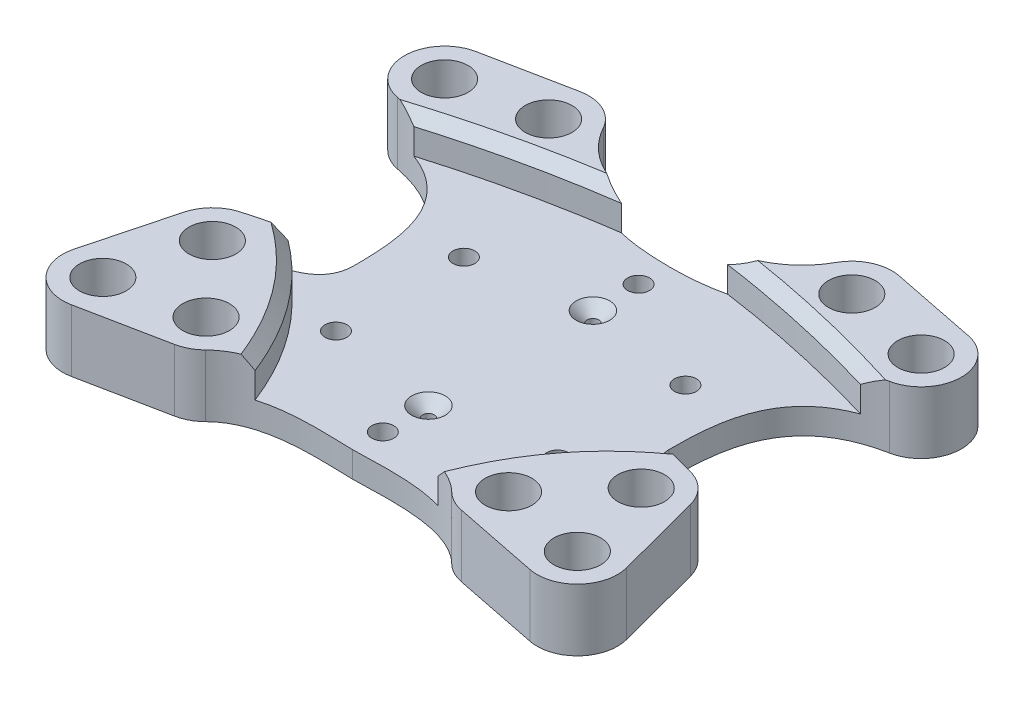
ISO-10303-21;
HEADER;
FILE_DESCRIPTION(('STEP AP214'),'2;1');
FILE_NAME('part.step','',(''),(''),'','','');
FILE_SCHEMA(('AUTOMOTIVE_DESIGN { 1 0 10303 214 1 1 1 1 }'));
ENDSEC;
DATA;
#1=APPLICATION_CONTEXT('core data for automotive mechanical design processes');
#2=APPLICATION_PROTOCOL_DEFINITION('international standard','automotive_design',2000,#1);
#3=PRODUCT_CONTEXT('',#1,'mechanical');
#4=PRODUCT('Part','Part','',(#3));
#5=PRODUCT_RELATED_PRODUCT_CATEGORY('part','',(#4));
#6=PRODUCT_DEFINITION_FORMATION('','',#4);
#7=PRODUCT_DEFINITION_CONTEXT('part definition',#1,'design');
#8=PRODUCT_DEFINITION('design','',#6,#7);
#9=PRODUCT_DEFINITION_SHAPE('','',#8);
#10=(LENGTH_UNIT() NAMED_UNIT(*) SI_UNIT(.MILLI.,.METRE.));
#11=(NAMED_UNIT(*) PLANE_ANGLE_UNIT() SI_UNIT($,.RADIAN.));
#12=(NAMED_UNIT(*) SI_UNIT($,.STERADIAN.) SOLID_ANGLE_UNIT());
#13=UNCERTAINTY_MEASURE_WITH_UNIT(LENGTH_MEASURE(1.E-05),#10,'distance_accuracy_value','');
#14=(GEOMETRIC_REPRESENTATION_CONTEXT(3) GLOBAL_UNCERTAINTY_ASSIGNED_CONTEXT((#13)) GLOBAL_UNIT_ASSIGNED_CONTEXT((#10,
#11,#12)) REPRESENTATION_CONTEXT('',''));
#15=CARTESIAN_POINT('',(0.,0.,0.));
#16=DIRECTION('',(0.,0.,1.));
#17=DIRECTION('',(1.,0.,0.));
#18=AXIS2_PLACEMENT_3D('',#15,#16,#17);
#19=CARTESIAN_POINT('',(50.2662652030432,7.,9.0709998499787));
#20=DIRECTION('',(0.,-1.,0.));
#21=DIRECTION('',(0.,0.,-1.));
#22=AXIS2_PLACEMENT_3D('',#19,#20,#21);
#23=PLANE('',#22);
#24=CARTESIAN_POINT('',(0.,7.,22.5));
#25=DIRECTION('',(0.,-1.,0.));
#26=DIRECTION('',(0.,0.,-1.));
#27=AXIS2_PLACEMENT_3D('',#24,#25,#26);
#28=CIRCLE('',#27,4.60000000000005);
#29=CARTESIAN_POINT('',(0.,7.,27.1));
#30=VERTEX_POINT('',#29);
#31=EDGE_CURVE('E43',#30,#30,#28,.T.);
#32=ORIENTED_EDGE('',*,*,#31,.T.);
#33=EDGE_LOOP('',(#32));
#34=FACE_BOUND('',#33,.T.);
#35=CARTESIAN_POINT('',(0.,7.,-22.5));
#36=DIRECTION('',(0.,-1.,0.));
#37=DIRECTION('',(0.,0.,-1.));
#38=AXIS2_PLACEMENT_3D('',#35,#36,#37);
#39=CIRCLE('',#38,4.60000000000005);
#40=CARTESIAN_POINT('',(0.,7.,-17.9));
#41=VERTEX_POINT('',#40);
#42=EDGE_CURVE('E1124',#41,#41,#39,.T.);
#43=ORIENTED_EDGE('',*,*,#42,.T.);
#44=EDGE_LOOP('',(#43));
#45=FACE_BOUND('',#44,.T.);
#46=CARTESIAN_POINT('',(-30.3108891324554,7.,-17.5));
#47=DIRECTION('',(0.,1.,0.));
#48=DIRECTION('',(0.,0.,1.));
#49=AXIS2_PLACEMENT_3D('',#46,#47,#48);
#50=CIRCLE('',#49,3.);
#51=CARTESIAN_POINT('',(-30.3108891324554,7.,-14.5));
#52=VERTEX_POINT('',#51);
#53=EDGE_CURVE('E936',#52,#52,#50,.T.);
#54=ORIENTED_EDGE('',*,*,#53,.F.);
#55=EDGE_LOOP('',(#54));
#56=FACE_BOUND('',#55,.T.);
#57=CARTESIAN_POINT('',(-30.3108891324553,7.,17.5));
#58=DIRECTION('',(0.,1.,0.));
#59=DIRECTION('',(0.,0.,1.));
#60=AXIS2_PLACEMENT_3D('',#57,#58,#59);
#61=CIRCLE('',#60,3.);
#62=CARTESIAN_POINT('',(-30.3108891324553,7.,20.5));
#63=VERTEX_POINT('',#62);
#64=EDGE_CURVE('E940',#63,#63,#61,.T.);
#65=ORIENTED_EDGE('',*,*,#64,.F.);
#66=EDGE_LOOP('',(#65));
#67=FACE_BOUND('',#66,.T.);
#68=CARTESIAN_POINT('',(0.,7.,35.));
#69=DIRECTION('',(0.,1.,0.));
#70=DIRECTION('',(0.,0.,1.));
#71=AXIS2_PLACEMENT_3D('',#68,#69,#70);
#72=CIRCLE('',#71,3.);
#73=CARTESIAN_POINT('',(0.,7.,38.));
#74=VERTEX_POINT('',#73);
#75=EDGE_CURVE('E946',#74,#74,#72,.T.);
#76=ORIENTED_EDGE('',*,*,#75,.F.);
#77=EDGE_LOOP('',(#76));
#78=FACE_BOUND('',#77,.T.);
#79=CARTESIAN_POINT('',(30.3108891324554,7.,17.5));
#80=DIRECTION('',(0.,1.,0.));
#81=DIRECTION('',(0.,0.,1.));
#82=AXIS2_PLACEMENT_3D('',#79,#80,#81);
#83=CIRCLE('',#82,3.);
#84=CARTESIAN_POINT('',(30.3108891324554,7.,20.5));
#85=VERTEX_POINT('',#84);
#86=EDGE_CURVE('E952',#85,#85,#83,.T.);
#87=ORIENTED_EDGE('',*,*,#86,.F.);
#88=EDGE_LOOP('',(#87));
#89=FACE_BOUND('',#88,.T.);
#90=CARTESIAN_POINT('',(30.3108891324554,7.,-17.5));
#91=DIRECTION('',(0.,1.,0.));
#92=DIRECTION('',(0.,0.,1.));
#93=AXIS2_PLACEMENT_3D('',#90,#91,#92);
#94=CIRCLE('',#93,3.);
#95=CARTESIAN_POINT('',(30.3108891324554,7.,-14.5));
#96=VERTEX_POINT('',#95);
#97=EDGE_CURVE('E958',#96,#96,#94,.T.);
#98=ORIENTED_EDGE('',*,*,#97,.F.);
#99=EDGE_LOOP('',(#98));
#100=FACE_BOUND('',#99,.T.);
#101=CARTESIAN_POINT('',(0.,7.,-35.));
#102=DIRECTION('',(0.,1.,0.));
#103=DIRECTION('',(0.,0.,1.));
#104=AXIS2_PLACEMENT_3D('',#101,#102,#103);
#105=CIRCLE('',#104,3.);
#106=CARTESIAN_POINT('',(0.,7.,-32.));
#107=VERTEX_POINT('',#106);
#108=EDGE_CURVE('E964',#107,#107,#105,.T.);
#109=ORIENTED_EDGE('',*,*,#108,.F.);
#110=EDGE_LOOP('',(#109));
#111=FACE_BOUND('',#110,.T.);
#112=CARTESIAN_POINT('',(-61.0918731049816,7.,-34.6007158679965));
#113=CARTESIAN_POINT('',(-38.2680120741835,7.,-41.4637213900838));
#114=CARTESIAN_POINT('',(-14.5334164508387,7.,-44.8197188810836));
#115=B_SPLINE_CURVE_WITH_KNOTS('',2,(#112,#113,#114),.UNSPECIFIED.,.F.,.F.,(3,3),(0.,1.),.UNSPECIFIED.);
#116=CARTESIAN_POINT('',(-61.0918731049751,7.,-34.6007158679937));
#117=VERTEX_POINT('',#116);
#118=CARTESIAN_POINT('',(-14.5334164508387,7.,-44.8197188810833));
#119=VERTEX_POINT('',#118);
#120=EDGE_CURVE('E284',#117,#119,#115,.T.);
#121=ORIENTED_EDGE('',*,*,#120,.F.);
#122=CARTESIAN_POINT('',(-67.293012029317,7.,-36.3085936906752));
#123=CARTESIAN_POINT('',(-44.1137531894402,7.,-31.8092342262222));
#124=CARTESIAN_POINT('',(-43.3290995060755,7.,-13.4805874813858));
#125=CARTESIAN_POINT('',(-43.3290995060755,7.,0.));
#126=B_SPLINE_CURVE_WITH_KNOTS('',3,(#122,#123,#124,#125),.UNSPECIFIED.,.F.,.F.,(4,4),(0.,1.),.UNSPECIFIED.);
#127=CARTESIAN_POINT('',(-43.3290995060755,7.,0.));
#128=VERTEX_POINT('',#127);
#129=EDGE_CURVE('E633',#117,#128,#126,.T.);
#130=ORIENTED_EDGE('',*,*,#129,.T.);
#131=CARTESIAN_POINT('',(-43.3290995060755,7.,0.));
#132=CARTESIAN_POINT('',(-43.7456450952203,7.,9.91055629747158));
#133=CARTESIAN_POINT('',(-55.1014674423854,7.,10.090689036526));
#134=CARTESIAN_POINT('',(-62.2596845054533,7.,12.5642627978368));
#135=B_SPLINE_CURVE_WITH_KNOTS('',3,(#131,#132,#133,#134),.UNSPECIFIED.,.F.,.F.,(4,4),(0.,1.),.UNSPECIFIED.);
#136=CARTESIAN_POINT('',(-51.4152497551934,7.,9.51886064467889));
#137=VERTEX_POINT('',#136);
#138=EDGE_CURVE('E630',#128,#137,#135,.T.);
#139=ORIENTED_EDGE('',*,*,#138,.T.);
#140=CARTESIAN_POINT('',(-25.0154278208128,7.,44.9336790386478));
#141=CARTESIAN_POINT('',(-33.6568884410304,7.,22.8663350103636));
#142=CARTESIAN_POINT('',(-51.4152497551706,7.,9.51886064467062));
#143=B_SPLINE_CURVE_WITH_KNOTS('',2,(#140,#141,#142),.UNSPECIFIED.,.F.,.F.,(3,3),(0.,1.),.UNSPECIFIED.);
#144=CARTESIAN_POINT('',(-25.015427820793,7.,44.9336790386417));
#145=VERTEX_POINT('',#144);
#146=EDGE_CURVE('E509',#145,#137,#143,.T.);
#147=ORIENTED_EDGE('',*,*,#146,.F.);
#148=CARTESIAN_POINT('',(-33.6508259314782,7.,49.7876449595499));
#149=CARTESIAN_POINT('',(-25.5271598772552,7.,41.7589094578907));
#150=CARTESIAN_POINT('',(-9.72057012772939,7.,43.1677028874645));
#151=CARTESIAN_POINT('',(0.,7.,43.3290995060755));
#152=B_SPLINE_CURVE_WITH_KNOTS('',3,(#148,#149,#150,#151),.UNSPECIFIED.,.F.,.F.,(4,4),(0.,1.),.UNSPECIFIED.);
#153=CARTESIAN_POINT('',(0.,7.,43.3290995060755));
#154=VERTEX_POINT('',#153);
#155=EDGE_CURVE('E456',#145,#154,#152,.T.);
#156=ORIENTED_EDGE('',*,*,#155,.T.);
#157=CARTESIAN_POINT('',(0.,7.,43.3290995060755));
#158=CARTESIAN_POINT('',(9.7205701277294,7.,43.1677028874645));
#159=CARTESIAN_POINT('',(25.5271598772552,7.,41.7589094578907));
#160=CARTESIAN_POINT('',(33.6508259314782,7.,49.7876449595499));
#161=B_SPLINE_CURVE_WITH_KNOTS('',3,(#157,#158,#159,#160),.UNSPECIFIED.,.F.,.F.,(4,4),(0.,1.),.UNSPECIFIED.);
#162=CARTESIAN_POINT('',(25.0154278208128,7.,44.9336790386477));
#163=VERTEX_POINT('',#162);
#164=EDGE_CURVE('E451',#154,#163,#161,.T.);
#165=ORIENTED_EDGE('',*,*,#164,.T.);
#166=CARTESIAN_POINT('',(51.4152497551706,7.,9.5188606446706));
#167=CARTESIAN_POINT('',(33.6568884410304,7.,22.8663350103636));
#168=CARTESIAN_POINT('',(25.0154278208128,7.,44.9336790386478));
#169=B_SPLINE_CURVE_WITH_KNOTS('',2,(#166,#167,#168),.UNSPECIFIED.,.F.,.F.,(3,3),(0.,1.),.UNSPECIFIED.);
#170=CARTESIAN_POINT('',(51.4152497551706,7.,9.51886064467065));
#171=VERTEX_POINT('',#170);
#172=EDGE_CURVE('E464',#171,#163,#169,.T.);
#173=ORIENTED_EDGE('',*,*,#172,.F.);
#174=CARTESIAN_POINT('',(62.2596845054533,7.,12.5642627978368));
#175=CARTESIAN_POINT('',(55.1014674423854,7.,10.090689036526));
#176=CARTESIAN_POINT('',(43.7456450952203,7.,9.91055629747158));
#177=CARTESIAN_POINT('',(43.3290995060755,7.,0.));
#178=B_SPLINE_CURVE_WITH_KNOTS('',3,(#174,#175,#176,#177),.UNSPECIFIED.,.F.,.F.,(4,4),(0.,1.),.UNSPECIFIED.);
#179=CARTESIAN_POINT('',(43.3290995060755,7.,0.));
#180=VERTEX_POINT('',#179);
#181=EDGE_CURVE('E459',#171,#180,#178,.T.);
#182=ORIENTED_EDGE('',*,*,#181,.T.);
#183=CARTESIAN_POINT('',(43.3290995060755,7.,0.));
#184=CARTESIAN_POINT('',(43.3290995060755,7.,-13.4805874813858));
#185=CARTESIAN_POINT('',(44.1137531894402,7.,-31.8092342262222));
#186=CARTESIAN_POINT('',(67.293012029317,7.,-36.3085936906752));
#187=B_SPLINE_CURVE_WITH_KNOTS('',3,(#183,#184,#185,#186),.UNSPECIFIED.,.F.,.F.,(4,4),(0.,1.),.UNSPECIFIED.);
#188=CARTESIAN_POINT('',(61.0918731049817,7.,-34.6007158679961));
#189=VERTEX_POINT('',#188);
#190=EDGE_CURVE('E462',#180,#189,#187,.T.);
#191=ORIENTED_EDGE('',*,*,#190,.T.);
#192=CARTESIAN_POINT('',(14.5334164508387,7.,-44.8197188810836));
#193=CARTESIAN_POINT('',(38.2680120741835,7.,-41.4637213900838));
#194=CARTESIAN_POINT('',(61.0918731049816,7.,-34.6007158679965));
#195=B_SPLINE_CURVE_WITH_KNOTS('',2,(#192,#193,#194),.UNSPECIFIED.,.F.,.F.,(3,3),(0.,1.),.UNSPECIFIED.);
#196=CARTESIAN_POINT('',(14.5334164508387,7.,-44.8197188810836));
#197=VERTEX_POINT('',#196);
#198=EDGE_CURVE('E1050',#197,#189,#195,.T.);
#199=ORIENTED_EDGE('',*,*,#198,.F.);
#200=CARTESIAN_POINT('',(31.8690744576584,7.,-57.2072848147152));
#201=CARTESIAN_POINT('',(26.2541370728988,7.,-47.1354199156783));
#202=CARTESIAN_POINT('',(15.669804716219,7.,-43.3290995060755));
#203=CARTESIAN_POINT('',(0.,7.,-43.3290995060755));
#204=B_SPLINE_CURVE_WITH_KNOTS('',3,(#200,#201,#202,#203),.UNSPECIFIED.,.F.,.F.,(4,4),(0.,1.),.UNSPECIFIED.);
#205=CARTESIAN_POINT('',(0.,7.,-43.3290995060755));
#206=VERTEX_POINT('',#205);
#207=EDGE_CURVE('E1819',#197,#206,#204,.T.);
#208=ORIENTED_EDGE('',*,*,#207,.T.);
#209=CARTESIAN_POINT('',(0.,7.,-43.3290995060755));
#210=CARTESIAN_POINT('',(-15.669804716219,7.,-43.3290995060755));
#211=CARTESIAN_POINT('',(-26.2541370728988,7.,-47.1354199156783));
#212=CARTESIAN_POINT('',(-31.8690744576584,7.,-57.2072848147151));
#213=B_SPLINE_CURVE_WITH_KNOTS('',3,(#209,#210,#211,#212),.UNSPECIFIED.,.F.,.F.,(4,4),(0.,1.),.UNSPECIFIED.);
#214=EDGE_CURVE('E1722',#206,#119,#213,.T.);
#215=ORIENTED_EDGE('',*,*,#214,.T.);
#216=EDGE_LOOP('',(#121,#130,#139,#147,#156,#165,#173,#182,#191,#199,#208,#215));
#217=FACE_BOUND('',#216,.T.);
#218=ADVANCED_FACE('F35',(#34,#45,#56,#67,#78,#89,#100,#111,#217),#23,.F.);
#219=CARTESIAN_POINT('',(50.2662652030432,0.,9.0709998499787));
#220=DIRECTION('',(0.,-1.,0.));
#221=DIRECTION('',(0.,0.,-1.));
#222=AXIS2_PLACEMENT_3D('',#219,#220,#221);
#223=PLANE('',#222);
#224=CARTESIAN_POINT('',(0.,0.,22.5));
#225=DIRECTION('',(0.,1.,0.));
#226=DIRECTION('',(0.,0.,1.));
#227=AXIS2_PLACEMENT_3D('',#224,#225,#226);
#228=CIRCLE('',#227,1.6);
#229=CARTESIAN_POINT('',(0.,0.,24.1));
#230=VERTEX_POINT('',#229);
#231=EDGE_CURVE('E370',#230,#230,#228,.T.);
#232=ORIENTED_EDGE('',*,*,#231,.T.);
#233=EDGE_LOOP('',(#232));
#234=FACE_BOUND('',#233,.T.);
#235=CARTESIAN_POINT('',(0.,0.,-22.5));
#236=DIRECTION('',(0.,1.,0.));
#237=DIRECTION('',(0.,0.,1.));
#238=AXIS2_PLACEMENT_3D('',#235,#236,#237);
#239=CIRCLE('',#238,1.6);
#240=CARTESIAN_POINT('',(0.,0.,-20.9));
#241=VERTEX_POINT('',#240);
#242=EDGE_CURVE('E367',#241,#241,#239,.T.);
#243=ORIENTED_EDGE('',*,*,#242,.T.);
#244=EDGE_LOOP('',(#243));
#245=FACE_BOUND('',#244,.T.);
#246=CARTESIAN_POINT('',(0.,0.,-35.));
#247=DIRECTION('',(0.,1.,0.));
#248=DIRECTION('',(0.,0.,1.));
#249=AXIS2_PLACEMENT_3D('',#246,#247,#248);
#250=CIRCLE('',#249,3.);
#251=CARTESIAN_POINT('',(0.,0.,-32.));
#252=VERTEX_POINT('',#251);
#253=EDGE_CURVE('E967',#252,#252,#250,.T.);
#254=ORIENTED_EDGE('',*,*,#253,.T.);
#255=EDGE_LOOP('',(#254));
#256=FACE_BOUND('',#255,.T.);
#257=CARTESIAN_POINT('',(30.3108891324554,0.,17.5));
#258=DIRECTION('',(0.,1.,0.));
#259=DIRECTION('',(0.,0.,1.));
#260=AXIS2_PLACEMENT_3D('',#257,#258,#259);
#261=CIRCLE('',#260,3.);
#262=CARTESIAN_POINT('',(30.3108891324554,0.,20.5));
#263=VERTEX_POINT('',#262);
#264=EDGE_CURVE('E955',#263,#263,#261,.T.);
#265=ORIENTED_EDGE('',*,*,#264,.T.);
#266=EDGE_LOOP('',(#265));
#267=FACE_BOUND('',#266,.T.);
#268=CARTESIAN_POINT('',(-30.3108891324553,0.,17.5));
#269=DIRECTION('',(0.,1.,0.));
#270=DIRECTION('',(0.,0.,1.));
#271=AXIS2_PLACEMENT_3D('',#268,#269,#270);
#272=CIRCLE('',#271,3.);
#273=CARTESIAN_POINT('',(-30.3108891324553,0.,20.5));
#274=VERTEX_POINT('',#273);
#275=EDGE_CURVE('E943',#274,#274,#272,.T.);
#276=ORIENTED_EDGE('',*,*,#275,.T.);
#277=EDGE_LOOP('',(#276));
#278=FACE_BOUND('',#277,.T.);
#279=CARTESIAN_POINT('',(-41.4769145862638,0.,-51.8510353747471));
#280=DIRECTION('',(0.,1.,0.));
#281=DIRECTION('',(0.,0.,1.));
#282=AXIS2_PLACEMENT_3D('',#279,#280,#281);
#283=CIRCLE('',#282,6.40000000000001);
#284=CARTESIAN_POINT('',(-41.4769145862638,0.,-45.4510353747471));
#285=VERTEX_POINT('',#284);
#286=EDGE_CURVE('E933',#285,#285,#283,.T.);
#287=ORIENTED_EDGE('',*,*,#286,.T.);
#288=EDGE_LOOP('',(#287));
#289=FACE_BOUND('',#288,.T.);
#290=CARTESIAN_POINT('',(-58.6670078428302,0.,22.9610254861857));
#291=DIRECTION('',(0.,1.,0.));
#292=DIRECTION('',(0.,0.,1.));
#293=AXIS2_PLACEMENT_3D('',#290,#291,#292);
#294=CIRCLE('',#293,6.40000000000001);
#295=CARTESIAN_POINT('',(-58.6670078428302,0.,29.3610254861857));
#296=VERTEX_POINT('',#295);
#297=EDGE_CURVE('E927',#296,#296,#294,.T.);
#298=ORIENTED_EDGE('',*,*,#297,.T.);
#299=EDGE_LOOP('',(#298));
#300=FACE_BOUND('',#299,.T.);
#301=CARTESIAN_POINT('',(-64.9144430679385,0.,46.6838917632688));
#302=DIRECTION('',(0.,1.,0.));
#303=DIRECTION('',(0.,0.,1.));
#304=AXIS2_PLACEMENT_3D('',#301,#302,#303);
#305=CIRCLE('',#304,6.40000000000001);
#306=CARTESIAN_POINT('',(-64.9144430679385,0.,53.0838917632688));
#307=VERTEX_POINT('',#306);
#308=EDGE_CURVE('E921',#307,#307,#305,.T.);
#309=ORIENTED_EDGE('',*,*,#308,.T.);
#310=EDGE_LOOP('',(#309));
#311=FACE_BOUND('',#310,.T.);
#312=CARTESIAN_POINT('',(64.9144430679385,0.,46.6838917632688));
#313=DIRECTION('',(0.,1.,0.));
#314=DIRECTION('',(0.,0.,1.));
#315=AXIS2_PLACEMENT_3D('',#312,#313,#314);
#316=CIRCLE('',#315,6.40000000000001);
#317=CARTESIAN_POINT('',(64.9144430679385,0.,53.0838917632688));
#318=VERTEX_POINT('',#317);
#319=EDGE_CURVE('E912',#318,#318,#316,.T.);
#320=ORIENTED_EDGE('',*,*,#319,.T.);
#321=EDGE_LOOP('',(#320));
#322=FACE_BOUND('',#321,.T.);
#323=CARTESIAN_POINT('',(41.4769145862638,0.,-51.8510353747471));
#324=DIRECTION('',(0.,1.,0.));
#325=DIRECTION('',(0.,0.,1.));
#326=AXIS2_PLACEMENT_3D('',#323,#324,#325);
#327=CIRCLE('',#326,6.40000000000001);
#328=CARTESIAN_POINT('',(41.4769145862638,0.,-45.4510353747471));
#329=VERTEX_POINT('',#328);
#330=EDGE_CURVE('E471',#329,#329,#327,.T.);
#331=ORIENTED_EDGE('',*,*,#330,.T.);
#332=EDGE_LOOP('',(#331));
#333=FACE_BOUND('',#332,.T.);
#334=CARTESIAN_POINT('',(62.2596845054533,0.,12.5642627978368));
#335=CARTESIAN_POINT('',(55.1014674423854,0.,10.090689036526));
#336=CARTESIAN_POINT('',(43.7456450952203,0.,9.91055629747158));
#337=CARTESIAN_POINT('',(43.3290995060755,0.,0.));
#338=B_SPLINE_CURVE_WITH_KNOTS('',3,(#334,#335,#336,#337),.UNSPECIFIED.,.F.,.F.,(4,4),(0.,1.),.UNSPECIFIED.);
#339=CARTESIAN_POINT('',(62.2596845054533,0.,12.5642627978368));
#340=VERTEX_POINT('',#339);
#341=CARTESIAN_POINT('',(43.3290995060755,0.,0.));
#342=VERTEX_POINT('',#341);
#343=EDGE_CURVE('E442',#340,#342,#338,.T.);
#344=ORIENTED_EDGE('',*,*,#343,.F.);
#345=CARTESIAN_POINT('',(58.6670078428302,0.,22.9610254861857));
#346=DIRECTION('',(0.,1.,0.));
#347=DIRECTION('',(0.,0.,1.));
#348=AXIS2_PLACEMENT_3D('',#345,#346,#347);
#349=CIRCLE('',#348,11.);
#350=CARTESIAN_POINT('',(69.3043226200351,0.,20.1596803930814));
#351=VERTEX_POINT('',#350);
#352=EDGE_CURVE('E463',#351,#340,#349,.T.);
#353=ORIENTED_EDGE('',*,*,#352,.F.);
#354=DIRECTION('',(-0.254667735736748,0.,-0.967028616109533));
#355=VECTOR('',#354,1.);
#356=CARTESIAN_POINT('',(69.3043226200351,0.,20.1596803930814));
#357=LINE('',#356,#355);
#358=CARTESIAN_POINT('',(75.5517578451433,0.,43.8825466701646));
#359=VERTEX_POINT('',#358);
#360=EDGE_CURVE('E830',#359,#351,#357,.T.);
#361=ORIENTED_EDGE('',*,*,#360,.F.);
#362=CARTESIAN_POINT('',(64.9144430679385,0.,46.6838917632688));
#363=DIRECTION('',(0.,1.,0.));
#364=DIRECTION('',(0.,0.,1.));
#365=AXIS2_PLACEMENT_3D('',#362,#363,#364);
#366=CIRCLE('',#365,11.);
#367=CARTESIAN_POINT('',(62.7511097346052,0.,57.4690662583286));
#368=VERTEX_POINT('',#367);
#369=EDGE_CURVE('E832',#368,#359,#366,.T.);
#370=ORIENTED_EDGE('',*,*,#369,.F.);
#371=DIRECTION('',(0.980470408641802,0.,0.196666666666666));
#372=VECTOR('',#371,1.);
#373=CARTESIAN_POINT('',(39.2198199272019,0.,52.7490662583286));
#374=LINE('',#373,#372);
#375=CARTESIAN_POINT('',(39.2198199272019,0.,52.7490662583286));
#376=VERTEX_POINT('',#375);
#377=EDGE_CURVE('E834',#376,#368,#374,.T.);
#378=ORIENTED_EDGE('',*,*,#377,.F.);
#379=CARTESIAN_POINT('',(41.3831532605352,0.,41.9638917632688));
#380=DIRECTION('',(0.,1.,0.));
#381=DIRECTION('',(0.,0.,1.));
#382=AXIS2_PLACEMENT_3D('',#379,#380,#381);
#383=CIRCLE('',#382,11.);
#384=CARTESIAN_POINT('',(33.6508259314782,0.,49.7876449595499));
#385=VERTEX_POINT('',#384);
#386=EDGE_CURVE('E836',#385,#376,#383,.T.);
#387=ORIENTED_EDGE('',*,*,#386,.F.);
#388=CARTESIAN_POINT('',(0.,0.,43.3290995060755));
#389=CARTESIAN_POINT('',(9.7205701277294,0.,43.1677028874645));
#390=CARTESIAN_POINT('',(25.5271598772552,0.,41.7589094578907));
#391=CARTESIAN_POINT('',(33.6508259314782,0.,49.7876449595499));
#392=B_SPLINE_CURVE_WITH_KNOTS('',3,(#388,#389,#390,#391),.UNSPECIFIED.,.F.,.F.,(4,4),(0.,1.),.UNSPECIFIED.);
#393=CARTESIAN_POINT('',(0.,0.,43.3290995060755));
#394=VERTEX_POINT('',#393);
#395=EDGE_CURVE('E838',#394,#385,#392,.T.);
#396=ORIENTED_EDGE('',*,*,#395,.F.);
#397=CARTESIAN_POINT('',(-33.6508259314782,0.,49.7876449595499));
#398=CARTESIAN_POINT('',(-25.5271598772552,0.,41.7589094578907));
#399=CARTESIAN_POINT('',(-9.72057012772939,0.,43.1677028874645));
#400=CARTESIAN_POINT('',(0.,0.,43.3290995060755));
#401=B_SPLINE_CURVE_WITH_KNOTS('',3,(#397,#398,#399,#400),.UNSPECIFIED.,.F.,.F.,(4,4),(0.,1.),.UNSPECIFIED.);
#402=CARTESIAN_POINT('',(-33.6508259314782,0.,49.7876449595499));
#403=VERTEX_POINT('',#402);
#404=EDGE_CURVE('E842',#403,#394,#401,.T.);
#405=ORIENTED_EDGE('',*,*,#404,.F.);
#406=CARTESIAN_POINT('',(-41.3831532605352,0.,41.9638917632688));
#407=DIRECTION('',(0.,1.,0.));
#408=DIRECTION('',(0.,0.,1.));
#409=AXIS2_PLACEMENT_3D('',#406,#407,#408);
#410=CIRCLE('',#409,11.);
#411=CARTESIAN_POINT('',(-39.2198199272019,0.,52.7490662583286));
#412=VERTEX_POINT('',#411);
#413=EDGE_CURVE('E849',#412,#403,#410,.T.);
#414=ORIENTED_EDGE('',*,*,#413,.F.);
#415=DIRECTION('',(0.980470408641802,0.,-0.196666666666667));
#416=VECTOR('',#415,1.);
#417=CARTESIAN_POINT('',(-39.2198199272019,0.,52.7490662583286));
#418=LINE('',#417,#416);
#419=CARTESIAN_POINT('',(-62.7511097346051,0.,57.4690662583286));
#420=VERTEX_POINT('',#419);
#421=EDGE_CURVE('E854',#420,#412,#418,.T.);
#422=ORIENTED_EDGE('',*,*,#421,.F.);
#423=CARTESIAN_POINT('',(-64.9144430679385,0.,46.6838917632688));
#424=DIRECTION('',(0.,1.,0.));
#425=DIRECTION('',(0.,0.,1.));
#426=AXIS2_PLACEMENT_3D('',#423,#424,#425);
#427=CIRCLE('',#426,11.);
#428=CARTESIAN_POINT('',(-75.5517578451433,0.,43.8825466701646));
#429=VERTEX_POINT('',#428);
#430=EDGE_CURVE('E856',#429,#420,#427,.T.);
#431=ORIENTED_EDGE('',*,*,#430,.F.);
#432=DIRECTION('',(-0.254667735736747,0.,0.967028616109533));
#433=VECTOR('',#432,1.);
#434=CARTESIAN_POINT('',(-69.3043226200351,0.,20.1596803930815));
#435=LINE('',#434,#433);
#436=CARTESIAN_POINT('',(-69.304322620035,0.,20.1596803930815));
#437=VERTEX_POINT('',#436);
#438=EDGE_CURVE('E858',#437,#429,#435,.T.);
#439=ORIENTED_EDGE('',*,*,#438,.F.);
#440=CARTESIAN_POINT('',(-58.6670078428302,0.,22.9610254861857));
#441=DIRECTION('',(0.,1.,0.));
#442=DIRECTION('',(0.,0.,1.));
#443=AXIS2_PLACEMENT_3D('',#440,#441,#442);
#444=CIRCLE('',#443,11.);
#445=CARTESIAN_POINT('',(-62.2596845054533,0.,12.5642627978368));
#446=VERTEX_POINT('',#445);
#447=EDGE_CURVE('E860',#446,#437,#444,.T.);
#448=ORIENTED_EDGE('',*,*,#447,.F.);
#449=CARTESIAN_POINT('',(-43.3290995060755,0.,0.));
#450=CARTESIAN_POINT('',(-43.7456450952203,0.,9.91055629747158));
#451=CARTESIAN_POINT('',(-55.1014674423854,0.,10.090689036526));
#452=CARTESIAN_POINT('',(-62.2596845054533,0.,12.5642627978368));
#453=B_SPLINE_CURVE_WITH_KNOTS('',3,(#449,#450,#451,#452),.UNSPECIFIED.,.F.,.F.,(4,4),(0.,1.),.UNSPECIFIED.);
#454=CARTESIAN_POINT('',(-43.3290995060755,0.,0.));
#455=VERTEX_POINT('',#454);
#456=EDGE_CURVE('E862',#455,#446,#453,.T.);
#457=ORIENTED_EDGE('',*,*,#456,.F.);
#458=CARTESIAN_POINT('',(-67.293012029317,0.,-36.3085936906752));
#459=CARTESIAN_POINT('',(-44.1137531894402,0.,-31.8092342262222));
#460=CARTESIAN_POINT('',(-43.3290995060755,0.,-13.4805874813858));
#461=CARTESIAN_POINT('',(-43.3290995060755,0.,0.));
#462=B_SPLINE_CURVE_WITH_KNOTS('',3,(#458,#459,#460,#461),.UNSPECIFIED.,.F.,.F.,(4,4),(0.,1.),.UNSPECIFIED.);
#463=CARTESIAN_POINT('',(-67.293012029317,0.,-36.3085936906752));
#464=VERTEX_POINT('',#463);
#465=EDGE_CURVE('E866',#464,#455,#462,.T.);
#466=ORIENTED_EDGE('',*,*,#465,.F.);
#467=CARTESIAN_POINT('',(-65.1969107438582,0.,-47.1070361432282));
#468=DIRECTION('',(0.,1.,0.));
#469=DIRECTION('',(0.,0.,1.));
#470=AXIS2_PLACEMENT_3D('',#467,#468,#469);
#471=CIRCLE('',#470,11.);
#472=CARTESIAN_POINT('',(-67.3541882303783,0.,-57.8934235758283));
#473=VERTEX_POINT('',#472);
#474=EDGE_CURVE('E873',#473,#464,#471,.T.);
#475=ORIENTED_EDGE('',*,*,#474,.F.);
#476=DIRECTION('',(-0.98058067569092,0.,0.196116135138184));
#477=VECTOR('',#476,1.);
#478=CARTESIAN_POINT('',(-43.6341920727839,0.,-62.6374228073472));
#479=LINE('',#478,#477);
#480=CARTESIAN_POINT('',(-43.6341920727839,0.,-62.6374228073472));
#481=VERTEX_POINT('',#480);
#482=EDGE_CURVE('E878',#481,#473,#479,.T.);
#483=ORIENTED_EDGE('',*,*,#482,.F.);
#484=CARTESIAN_POINT('',(-41.4769145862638,0.,-51.8510353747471));
#485=DIRECTION('',(0.,1.,0.));
#486=DIRECTION('',(0.,0.,1.));
#487=AXIS2_PLACEMENT_3D('',#484,#485,#486);
#488=CIRCLE('',#487,11.);
#489=CARTESIAN_POINT('',(-31.8690744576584,0.,-57.2072848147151));
#490=VERTEX_POINT('',#489);
#491=EDGE_CURVE('E880',#490,#481,#488,.T.);
#492=ORIENTED_EDGE('',*,*,#491,.F.);
#493=CARTESIAN_POINT('',(0.,0.,-43.3290995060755));
#494=CARTESIAN_POINT('',(-15.669804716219,0.,-43.3290995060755));
#495=CARTESIAN_POINT('',(-26.2541370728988,0.,-47.1354199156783));
#496=CARTESIAN_POINT('',(-31.8690744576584,0.,-57.2072848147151));
#497=B_SPLINE_CURVE_WITH_KNOTS('',3,(#493,#494,#495,#496),.UNSPECIFIED.,.F.,.F.,(4,4),(0.,1.),.UNSPECIFIED.);
#498=CARTESIAN_POINT('',(0.,0.,-43.3290995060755));
#499=VERTEX_POINT('',#498);
#500=EDGE_CURVE('E291',#499,#490,#497,.T.);
#501=ORIENTED_EDGE('',*,*,#500,.F.);
#502=CARTESIAN_POINT('',(31.8690744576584,0.,-57.2072848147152));
#503=CARTESIAN_POINT('',(26.2541370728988,0.,-47.1354199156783));
#504=CARTESIAN_POINT('',(15.669804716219,0.,-43.3290995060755));
#505=CARTESIAN_POINT('',(0.,0.,-43.3290995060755));
#506=B_SPLINE_CURVE_WITH_KNOTS('',3,(#502,#503,#504,#505),.UNSPECIFIED.,.F.,.F.,(4,4),(0.,1.),.UNSPECIFIED.);
#507=CARTESIAN_POINT('',(31.8690744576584,0.,-57.2072848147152));
#508=VERTEX_POINT('',#507);
#509=EDGE_CURVE('E885',#508,#499,#506,.T.);
#510=ORIENTED_EDGE('',*,*,#509,.F.);
#511=CARTESIAN_POINT('',(41.4769145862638,0.,-51.8510353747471));
#512=DIRECTION('',(0.,1.,0.));
#513=DIRECTION('',(0.,0.,1.));
#514=AXIS2_PLACEMENT_3D('',#511,#512,#513);
#515=CIRCLE('',#514,11.);
#516=CARTESIAN_POINT('',(43.6341920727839,0.,-62.6374228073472));
#517=VERTEX_POINT('',#516);
#518=EDGE_CURVE('E892',#517,#508,#515,.T.);
#519=ORIENTED_EDGE('',*,*,#518,.F.);
#520=DIRECTION('',(-0.98058067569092,0.,-0.196116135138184));
#521=VECTOR('',#520,1.);
#522=CARTESIAN_POINT('',(43.6341920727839,0.,-62.6374228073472));
#523=LINE('',#522,#521);
#524=CARTESIAN_POINT('',(67.3541882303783,0.,-57.8934235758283));
#525=VERTEX_POINT('',#524);
#526=EDGE_CURVE('E897',#525,#517,#523,.T.);
#527=ORIENTED_EDGE('',*,*,#526,.F.);
#528=CARTESIAN_POINT('',(65.1969107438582,0.,-47.1070361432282));
#529=DIRECTION('',(0.,1.,0.));
#530=DIRECTION('',(0.,0.,1.));
#531=AXIS2_PLACEMENT_3D('',#528,#529,#530);
#532=CIRCLE('',#531,11.);
#533=CARTESIAN_POINT('',(67.293012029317,0.,-36.3085936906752));
#534=VERTEX_POINT('',#533);
#535=EDGE_CURVE('E899',#534,#525,#532,.T.);
#536=ORIENTED_EDGE('',*,*,#535,.F.);
#537=CARTESIAN_POINT('',(43.3290995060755,0.,0.));
#538=CARTESIAN_POINT('',(43.3290995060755,0.,-13.4805874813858));
#539=CARTESIAN_POINT('',(44.1137531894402,0.,-31.8092342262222));
#540=CARTESIAN_POINT('',(67.293012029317,0.,-36.3085936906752));
#541=B_SPLINE_CURVE_WITH_KNOTS('',3,(#537,#538,#539,#540),.UNSPECIFIED.,.F.,.F.,(4,4),(0.,1.),.UNSPECIFIED.);
#542=EDGE_CURVE('E900',#342,#534,#541,.T.);
#543=ORIENTED_EDGE('',*,*,#542,.F.);
#544=EDGE_LOOP('',(#344,#353,#361,#370,#378,#387,#396,#405,#414,#422,#431,#439,#448,#457,#466,
#475,#483,#492,#501,#510,#519,#527,#536,#543));
#545=FACE_BOUND('',#544,.T.);
#546=CARTESIAN_POINT('',(65.1969107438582,0.,-47.1070361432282));
#547=DIRECTION('',(0.,1.,0.));
#548=DIRECTION('',(0.,0.,1.));
#549=AXIS2_PLACEMENT_3D('',#546,#547,#548);
#550=CIRCLE('',#549,6.40000000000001);
#551=CARTESIAN_POINT('',(65.1969107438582,0.,-40.7070361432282));
#552=VERTEX_POINT('',#551);
#553=EDGE_CURVE('E908',#552,#552,#550,.T.);
#554=ORIENTED_EDGE('',*,*,#553,.T.);
#555=EDGE_LOOP('',(#554));
#556=FACE_BOUND('',#555,.T.);
#557=CARTESIAN_POINT('',(41.3831532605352,0.,41.9638917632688));
#558=DIRECTION('',(0.,1.,0.));
#559=DIRECTION('',(0.,0.,1.));
#560=AXIS2_PLACEMENT_3D('',#557,#558,#559);
#561=CIRCLE('',#560,6.4);
#562=CARTESIAN_POINT('',(41.3831532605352,0.,48.3638917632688));
#563=VERTEX_POINT('',#562);
#564=EDGE_CURVE('E916',#563,#563,#561,.T.);
#565=ORIENTED_EDGE('',*,*,#564,.T.);
#566=EDGE_LOOP('',(#565));
#567=FACE_BOUND('',#566,.T.);
#568=CARTESIAN_POINT('',(-41.3831532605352,0.,41.9638917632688));
#569=DIRECTION('',(0.,1.,0.));
#570=DIRECTION('',(0.,0.,1.));
#571=AXIS2_PLACEMENT_3D('',#568,#569,#570);
#572=CIRCLE('',#571,6.4);
#573=CARTESIAN_POINT('',(-41.3831532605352,0.,48.3638917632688));
#574=VERTEX_POINT('',#573);
#575=EDGE_CURVE('E924',#574,#574,#572,.T.);
#576=ORIENTED_EDGE('',*,*,#575,.T.);
#577=EDGE_LOOP('',(#576));
#578=FACE_BOUND('',#577,.T.);
#579=CARTESIAN_POINT('',(-65.1969107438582,0.,-47.1070361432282));
#580=DIRECTION('',(0.,1.,0.));
#581=DIRECTION('',(0.,0.,1.));
#582=AXIS2_PLACEMENT_3D('',#579,#580,#581);
#583=CIRCLE('',#582,6.40000000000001);
#584=CARTESIAN_POINT('',(-65.1969107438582,0.,-40.7070361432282));
#585=VERTEX_POINT('',#584);
#586=EDGE_CURVE('E930',#585,#585,#583,.T.);
#587=ORIENTED_EDGE('',*,*,#586,.T.);
#588=EDGE_LOOP('',(#587));
#589=FACE_BOUND('',#588,.T.);
#590=CARTESIAN_POINT('',(-30.3108891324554,0.,-17.5));
#591=DIRECTION('',(0.,1.,0.));
#592=DIRECTION('',(0.,0.,1.));
#593=AXIS2_PLACEMENT_3D('',#590,#591,#592);
#594=CIRCLE('',#593,3.);
#595=CARTESIAN_POINT('',(-30.3108891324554,0.,-14.5));
#596=VERTEX_POINT('',#595);
#597=EDGE_CURVE('E937',#596,#596,#594,.T.);
#598=ORIENTED_EDGE('',*,*,#597,.T.);
#599=EDGE_LOOP('',(#598));
#600=FACE_BOUND('',#599,.T.);
#601=CARTESIAN_POINT('',(0.,0.,35.));
#602=DIRECTION('',(0.,1.,0.));
#603=DIRECTION('',(0.,0.,1.));
#604=AXIS2_PLACEMENT_3D('',#601,#602,#603);
#605=CIRCLE('',#604,3.);
#606=CARTESIAN_POINT('',(0.,0.,38.));
#607=VERTEX_POINT('',#606);
#608=EDGE_CURVE('E949',#607,#607,#605,.T.);
#609=ORIENTED_EDGE('',*,*,#608,.T.);
#610=EDGE_LOOP('',(#609));
#611=FACE_BOUND('',#610,.T.);
#612=CARTESIAN_POINT('',(30.3108891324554,0.,-17.5));
#613=DIRECTION('',(0.,1.,0.));
#614=DIRECTION('',(0.,0.,1.));
#615=AXIS2_PLACEMENT_3D('',#612,#613,#614);
#616=CIRCLE('',#615,3.);
#617=CARTESIAN_POINT('',(30.3108891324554,0.,-14.5));
#618=VERTEX_POINT('',#617);
#619=EDGE_CURVE('E961',#618,#618,#616,.T.);
#620=ORIENTED_EDGE('',*,*,#619,.T.);
#621=EDGE_LOOP('',(#620));
#622=FACE_BOUND('',#621,.T.);
#623=CARTESIAN_POINT('',(58.6670078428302,0.,22.9610254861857));
#624=DIRECTION('',(0.,1.,0.));
#625=DIRECTION('',(0.,0.,1.));
#626=AXIS2_PLACEMENT_3D('',#623,#624,#625);
#627=CIRCLE('',#626,6.40000000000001);
#628=CARTESIAN_POINT('',(58.6670078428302,0.,29.3610254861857));
#629=VERTEX_POINT('',#628);
#630=EDGE_CURVE('E970',#629,#629,#627,.T.);
#631=ORIENTED_EDGE('',*,*,#630,.T.);
#632=EDGE_LOOP('',(#631));
#633=FACE_BOUND('',#632,.T.);
#634=ADVANCED_FACE('F374',(#234,#245,#256,#267,#278,#289,#300,#311,#322,#333,#545,#556,#567,
#578,#589,#600,#611,#622,#633),#223,.T.);
#635=DIRECTION('',(0.,-1.,0.));
#636=VECTOR('',#635,1.);
#637=SURFACE_OF_LINEAR_EXTRUSION('',#178,#636);
#638=DIRECTION('',(0.,-1.,0.));
#639=VECTOR('',#638,1.);
#640=CARTESIAN_POINT('',(51.4152497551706,17.,9.5188606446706));
#641=LINE('',#640,#639);
#642=CARTESIAN_POINT('',(51.4152497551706,13.9999999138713,9.5188606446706));
#643=VERTEX_POINT('',#642);
#644=EDGE_CURVE('E620',#643,#171,#641,.T.);
#645=ORIENTED_EDGE('',*,*,#644,.F.);
#646=CARTESIAN_POINT('',(51.4152502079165,13.9999999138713,9.51886080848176));
#647=CARTESIAN_POINT('',(51.5565650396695,14.125781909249,9.56999008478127));
#648=CARTESIAN_POINT('',(51.6986102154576,14.2511643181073,9.62007233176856));
#649=CARTESIAN_POINT('',(51.9847609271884,14.5018213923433,9.71855603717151));
#650=CARTESIAN_POINT('',(52.1288733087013,14.6270921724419,9.76694750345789));
#651=CARTESIAN_POINT('',(52.4189972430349,14.877524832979,9.86216842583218));
#652=CARTESIAN_POINT('',(52.5650146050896,15.0026832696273,9.90898921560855));
#653=CARTESIAN_POINT('',(52.8587855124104,15.2528910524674,10.0011903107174));
#654=CARTESIAN_POINT('',(53.0065438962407,15.377937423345,10.0465632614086));
#655=CARTESIAN_POINT('',(53.3036291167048,15.6279205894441,10.135993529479));
#656=CARTESIAN_POINT('',(53.4529598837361,15.7528548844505,10.1800447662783));
#657=CARTESIAN_POINT('',(53.753018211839,16.0026135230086,10.2669596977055));
#658=CARTESIAN_POINT('',(53.9037488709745,16.1274358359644,10.3098185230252));
#659=CARTESIAN_POINT('',(54.206430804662,16.3769699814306,10.3944800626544));
#660=CARTESIAN_POINT('',(54.3583844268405,16.5016802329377,10.4362790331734));
#661=CARTESIAN_POINT('',(54.6633328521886,16.7509903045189,10.5189556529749));
#662=CARTESIAN_POINT('',(54.8163293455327,16.8755889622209,10.5598305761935));
#663=CARTESIAN_POINT('',(54.9695908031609,17.,10.6002712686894));
#664=B_SPLINE_CURVE_WITH_KNOTS('',3,(#646,#647,#648,#649,#650,#651,#652,#653,#654,#655,#656,
#657,#658,#659,#660,#661,#662,#663),.UNSPECIFIED.,.F.,.F.,(4,2,2,2,2,2,2,2,4),(0.,
0.587908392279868,1.17884658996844,1.77263694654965,2.36907520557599,2.96793188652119,
3.5689537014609,4.17186500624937,4.77636929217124),.UNSPECIFIED.);
#665=CARTESIAN_POINT('',(54.9695908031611,17.,10.6002712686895));
#666=VERTEX_POINT('',#665);
#667=EDGE_CURVE('E752',#643,#666,#664,.T.);
#668=ORIENTED_EDGE('',*,*,#667,.T.);
#669=CARTESIAN_POINT('',(62.2596845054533,17.,12.5642627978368));
#670=CARTESIAN_POINT('',(55.1014674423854,17.,10.090689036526));
#671=CARTESIAN_POINT('',(43.7456450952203,17.,9.91055629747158));
#672=CARTESIAN_POINT('',(43.3290995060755,17.,0.));
#673=B_SPLINE_CURVE_WITH_KNOTS('',3,(#669,#670,#671,#672),.UNSPECIFIED.,.F.,.F.,(4,4),(0.,1.),.UNSPECIFIED.);
#674=CARTESIAN_POINT('',(62.2596845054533,17.,12.5642627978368));
#675=VERTEX_POINT('',#674);
#676=EDGE_CURVE('E569',#675,#666,#673,.T.);
#677=ORIENTED_EDGE('',*,*,#676,.F.);
#678=DIRECTION('',(0.,-1.,0.));
#679=VECTOR('',#678,1.);
#680=CARTESIAN_POINT('',(62.2596845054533,7.,12.5642627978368));
#681=LINE('',#680,#679);
#682=EDGE_CURVE('E455',#675,#340,#681,.T.);
#683=ORIENTED_EDGE('',*,*,#682,.T.);
#684=ORIENTED_EDGE('',*,*,#343,.T.);
#685=DIRECTION('',(0.,-1.,0.));
#686=VECTOR('',#685,1.);
#687=CARTESIAN_POINT('',(43.3290995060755,7.,0.));
#688=LINE('',#687,#686);
#689=EDGE_CURVE('E457',#180,#342,#688,.T.);
#690=ORIENTED_EDGE('',*,*,#689,.F.);
#691=ORIENTED_EDGE('',*,*,#181,.F.);
#692=EDGE_LOOP('',(#645,#668,#677,#683,#684,#690,#691));
#693=FACE_BOUND('',#692,.T.);
#694=ADVANCED_FACE('F395',(#693),#637,.F.);
#695=DIRECTION('',(0.,-1.,0.));
#696=VECTOR('',#695,1.);
#697=SURFACE_OF_LINEAR_EXTRUSION('',#187,#696);
#698=CARTESIAN_POINT('',(43.3290995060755,17.,0.));
#699=CARTESIAN_POINT('',(43.3290995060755,17.,-13.4805874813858));
#700=CARTESIAN_POINT('',(44.1137531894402,17.,-31.8092342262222));
#701=CARTESIAN_POINT('',(67.293012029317,17.,-36.3085936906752));
#702=B_SPLINE_CURVE_WITH_KNOTS('',3,(#698,#699,#700,#701),.UNSPECIFIED.,.F.,.F.,(4,4),(0.,1.),.UNSPECIFIED.);
#703=CARTESIAN_POINT('',(66.4217458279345,17.,-36.1307445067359));
#704=VERTEX_POINT('',#703);
#705=CARTESIAN_POINT('',(67.293012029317,17.,-36.3085936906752));
#706=VERTEX_POINT('',#705);
#707=EDGE_CURVE('E1023',#704,#706,#702,.T.);
#708=ORIENTED_EDGE('',*,*,#707,.F.);
#709=CARTESIAN_POINT('',(66.4217458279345,17.,-36.1307445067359));
#710=CARTESIAN_POINT('',(66.1871849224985,16.8843108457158,-36.080469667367));
#711=CARTESIAN_POINT('',(65.9536745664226,16.7672468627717,-36.0284465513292));
#712=CARTESIAN_POINT('',(65.4898244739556,16.5308407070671,-35.9210710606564));
#713=CARTESIAN_POINT('',(65.2594757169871,16.4115097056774,-35.8657330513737));
#714=CARTESIAN_POINT('',(64.8019994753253,16.1705692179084,-35.7517088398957));
#715=CARTESIAN_POINT('',(64.5748629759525,16.0489703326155,-35.6930364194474));
#716=CARTESIAN_POINT('',(64.1238613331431,15.8034948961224,-35.5723270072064));
#717=CARTESIAN_POINT('',(63.8999872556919,15.6796283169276,-35.5103031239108));
#718=CARTESIAN_POINT('',(63.4555587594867,15.4296180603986,-35.3828756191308));
#719=CARTESIAN_POINT('',(63.2349955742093,15.3034836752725,-35.3174843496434));
#720=CARTESIAN_POINT('',(62.7972356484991,15.048938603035,-35.1833086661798));
#721=CARTESIAN_POINT('',(62.5800304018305,14.9205364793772,-35.1145357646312));
#722=CARTESIAN_POINT('',(62.149031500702,14.6614563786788,-34.9735845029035));
#723=CARTESIAN_POINT('',(61.9352296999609,14.5307861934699,-34.9014167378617));
#724=CARTESIAN_POINT('',(61.5110811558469,14.2671718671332,-34.7536668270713));
#725=CARTESIAN_POINT('',(61.3007267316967,14.1342347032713,-34.6780942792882));
#726=CARTESIAN_POINT('',(61.0918732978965,13.9999998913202,-34.6007159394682));
#727=B_SPLINE_CURVE_WITH_KNOTS('',3,(#709,#710,#711,#712,#713,#714,#715,#716,#717,#718,#719,
#720,#721,#722,#723,#724,#725,#726),.UNSPECIFIED.,.F.,.F.,(4,2,2,2,2,2,2,2,4),(0.,
0.798974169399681,1.59470641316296,2.38736013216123,3.17711102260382,3.96414688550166,
4.74866738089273,5.53088372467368,6.31101832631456),.UNSPECIFIED.);
#728=CARTESIAN_POINT('',(61.0918731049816,14.,-34.6007158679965));
#729=VERTEX_POINT('',#728);
#730=EDGE_CURVE('E59',#704,#729,#727,.T.);
#731=ORIENTED_EDGE('',*,*,#730,.T.);
#732=DIRECTION('',(0.,-1.,0.));
#733=VECTOR('',#732,1.);
#734=CARTESIAN_POINT('',(61.0918731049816,17.,-34.6007158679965));
#735=LINE('',#734,#733);
#736=EDGE_CURVE('E982',#729,#189,#735,.T.);
#737=ORIENTED_EDGE('',*,*,#736,.T.);
#738=ORIENTED_EDGE('',*,*,#190,.F.);
#739=ORIENTED_EDGE('',*,*,#689,.T.);
#740=ORIENTED_EDGE('',*,*,#542,.T.);
#741=DIRECTION('',(0.,-1.,0.));
#742=VECTOR('',#741,1.);
#743=CARTESIAN_POINT('',(67.293012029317,7.,-36.3085936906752));
#744=LINE('',#743,#742);
#745=EDGE_CURVE('E761',#706,#534,#744,.T.);
#746=ORIENTED_EDGE('',*,*,#745,.F.);
#747=EDGE_LOOP('',(#708,#731,#737,#738,#739,#740,#746));
#748=FACE_BOUND('',#747,.T.);
#749=ADVANCED_FACE('F486',(#748),#697,.F.);
#750=CARTESIAN_POINT('',(65.1969107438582,7.,-47.1070361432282));
#751=DIRECTION('',(0.,-1.,0.));
#752=DIRECTION('',(0.,0.,-1.));
#753=AXIS2_PLACEMENT_3D('',#750,#751,#752);
#754=CYLINDRICAL_SURFACE('',#753,11.);
#755=ORIENTED_EDGE('',*,*,#535,.T.);
#756=DIRECTION('',(0.,-1.,0.));
#757=VECTOR('',#756,1.);
#758=CARTESIAN_POINT('',(67.3541882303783,7.,-57.8934235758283));
#759=LINE('',#758,#757);
#760=CARTESIAN_POINT('',(67.3541882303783,17.,-57.8934235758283));
#761=VERTEX_POINT('',#760);
#762=EDGE_CURVE('E766',#761,#525,#759,.T.);
#763=ORIENTED_EDGE('',*,*,#762,.F.);
#764=CARTESIAN_POINT('',(65.1969107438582,17.,-47.1070361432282));
#765=DIRECTION('',(0.,1.,0.));
#766=DIRECTION('',(0.,0.,1.));
#767=AXIS2_PLACEMENT_3D('',#764,#765,#766);
#768=CIRCLE('',#767,11.);
#769=EDGE_CURVE('E1017',#706,#761,#768,.T.);
#770=ORIENTED_EDGE('',*,*,#769,.F.);
#771=ORIENTED_EDGE('',*,*,#745,.T.);
#772=EDGE_LOOP('',(#755,#763,#770,#771));
#773=FACE_BOUND('',#772,.T.);
#774=ADVANCED_FACE('F1327',(#773),#754,.T.);
#775=CARTESIAN_POINT('',(43.6341920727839,7.,-62.6374228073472));
#776=DIRECTION('',(-0.196116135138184,0.,0.98058067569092));
#777=DIRECTION('',(0.98058067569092,0.,0.196116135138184));
#778=AXIS2_PLACEMENT_3D('',#775,#776,#777);
#779=PLANE('',#778);
#780=ORIENTED_EDGE('',*,*,#526,.T.);
#781=DIRECTION('',(0.,-1.,0.));
#782=VECTOR('',#781,1.);
#783=CARTESIAN_POINT('',(43.6341920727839,7.,-62.6374228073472));
#784=LINE('',#783,#782);
#785=CARTESIAN_POINT('',(43.6341920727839,17.,-62.6374228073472));
#786=VERTEX_POINT('',#785);
#787=EDGE_CURVE('E772',#786,#517,#784,.T.);
#788=ORIENTED_EDGE('',*,*,#787,.F.);
#789=DIRECTION('',(-0.98058067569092,0.,-0.196116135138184));
#790=VECTOR('',#789,1.);
#791=CARTESIAN_POINT('',(43.6341920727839,17.,-62.6374228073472));
#792=LINE('',#791,#790);
#793=EDGE_CURVE('E1045',#761,#786,#792,.T.);
#794=ORIENTED_EDGE('',*,*,#793,.F.);
#795=ORIENTED_EDGE('',*,*,#762,.T.);
#796=EDGE_LOOP('',(#780,#788,#794,#795));
#797=FACE_BOUND('',#796,.T.);
#798=ADVANCED_FACE('F1319',(#797),#779,.F.);
#799=CARTESIAN_POINT('',(41.4769145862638,7.,-51.8510353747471));
#800=DIRECTION('',(0.,-1.,0.));
#801=DIRECTION('',(0.,0.,-1.));
#802=AXIS2_PLACEMENT_3D('',#799,#800,#801);
#803=CYLINDRICAL_SURFACE('',#802,11.);
#804=ORIENTED_EDGE('',*,*,#518,.T.);
#805=DIRECTION('',(0.,-1.,0.));
#806=VECTOR('',#805,1.);
#807=CARTESIAN_POINT('',(31.8690744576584,7.,-57.2072848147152));
#808=LINE('',#807,#806);
#809=CARTESIAN_POINT('',(31.8690744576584,17.,-57.2072848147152));
#810=VERTEX_POINT('',#809);
#811=EDGE_CURVE('E777',#810,#508,#808,.T.);
#812=ORIENTED_EDGE('',*,*,#811,.F.);
#813=CARTESIAN_POINT('',(41.4769145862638,17.,-51.8510353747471));
#814=DIRECTION('',(0.,1.,0.));
#815=DIRECTION('',(0.,0.,1.));
#816=AXIS2_PLACEMENT_3D('',#813,#814,#815);
#817=CIRCLE('',#816,11.);
#818=EDGE_CURVE('E1042',#786,#810,#817,.T.);
#819=ORIENTED_EDGE('',*,*,#818,.F.);
#820=ORIENTED_EDGE('',*,*,#787,.T.);
#821=EDGE_LOOP('',(#804,#812,#819,#820));
#822=FACE_BOUND('',#821,.T.);
#823=ADVANCED_FACE('F1312',(#822),#803,.T.);
#824=DIRECTION('',(0.,-1.,0.));
#825=VECTOR('',#824,1.);
#826=SURFACE_OF_LINEAR_EXTRUSION('',#204,#825);
#827=DIRECTION('',(0.,-1.,0.));
#828=VECTOR('',#827,1.);
#829=CARTESIAN_POINT('',(14.5334164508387,17.,-44.8197188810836));
#830=LINE('',#829,#828);
#831=CARTESIAN_POINT('',(14.5334164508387,13.9999989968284,-44.8197188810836));
#832=VERTEX_POINT('',#831);
#833=EDGE_CURVE('E975',#832,#197,#830,.T.);
#834=ORIENTED_EDGE('',*,*,#833,.F.);
#835=CARTESIAN_POINT('',(14.5334172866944,13.9999989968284,-44.819719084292));
#836=CARTESIAN_POINT('',(14.811646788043,14.1059484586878,-44.8873577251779));
#837=CARTESIAN_POINT('',(15.0881824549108,14.2146476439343,-44.9576841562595));
#838=CARTESIAN_POINT('',(15.6355430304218,14.4367430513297,-45.1032672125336));
#839=CARTESIAN_POINT('',(15.9063949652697,14.5500989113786,-45.1784838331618));
#840=CARTESIAN_POINT('',(16.4424139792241,14.7815073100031,-45.333886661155));
#841=CARTESIAN_POINT('',(16.7076065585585,14.8995245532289,-45.4140374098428));
#842=CARTESIAN_POINT('',(17.2323317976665,15.1402492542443,-45.5793422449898));
#843=CARTESIAN_POINT('',(17.491887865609,15.2629266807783,-45.6644657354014));
#844=CARTESIAN_POINT('',(18.0053658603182,15.5129668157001,-45.8397505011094));
#845=CARTESIAN_POINT('',(18.2593085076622,15.6403048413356,-45.9298862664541));
#846=CARTESIAN_POINT('',(18.7615861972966,15.8996603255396,-46.1152285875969));
#847=CARTESIAN_POINT('',(19.0099386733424,16.0316584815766,-46.2104148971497));
#848=CARTESIAN_POINT('',(19.5010619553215,16.3003300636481,-46.4058924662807));
#849=CARTESIAN_POINT('',(19.7438463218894,16.4369895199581,-46.5061688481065));
#850=CARTESIAN_POINT('',(20.223864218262,16.7149736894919,-46.7118540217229));
#851=CARTESIAN_POINT('',(20.4611068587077,16.8562896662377,-46.817253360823));
#852=CARTESIAN_POINT('',(20.6956725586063,16.9999999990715,-46.9252857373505));
#853=B_SPLINE_CURVE_WITH_KNOTS('',3,(#835,#836,#837,#838,#839,#840,#841,#842,#843,#844,#845,
#846,#847,#848,#849,#850,#851,#852),.UNSPECIFIED.,.F.,.F.,(4,2,2,2,2,2,2,2,4),(0.,
0.915898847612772,1.82507068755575,2.72833620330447,3.62653366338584,4.5205169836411,
5.41115358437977,6.29932206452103,7.1859097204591),.UNSPECIFIED.);
#854=CARTESIAN_POINT('',(20.6956725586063,17.,-46.9252857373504));
#855=VERTEX_POINT('',#854);
#856=EDGE_CURVE('E1077',#832,#855,#853,.T.);
#857=ORIENTED_EDGE('',*,*,#856,.T.);
#858=CARTESIAN_POINT('',(31.8690744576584,17.,-57.2072848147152));
#859=CARTESIAN_POINT('',(26.2541370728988,17.,-47.1354199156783));
#860=CARTESIAN_POINT('',(15.669804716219,17.,-43.3290995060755));
#861=CARTESIAN_POINT('',(0.,17.,-43.3290995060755));
#862=B_SPLINE_CURVE_WITH_KNOTS('',3,(#858,#859,#860,#861),.UNSPECIFIED.,.F.,.F.,(4,4),(0.,1.),.UNSPECIFIED.);
#863=EDGE_CURVE('E1026',#810,#855,#862,.T.);
#864=ORIENTED_EDGE('',*,*,#863,.F.);
#865=ORIENTED_EDGE('',*,*,#811,.T.);
#866=ORIENTED_EDGE('',*,*,#509,.T.);
#867=DIRECTION('',(0.,-1.,0.));
#868=VECTOR('',#867,1.);
#869=CARTESIAN_POINT('',(0.,7.,-43.3290995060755));
#870=LINE('',#869,#868);
#871=EDGE_CURVE('E294',#206,#499,#870,.T.);
#872=ORIENTED_EDGE('',*,*,#871,.F.);
#873=ORIENTED_EDGE('',*,*,#207,.F.);
#874=EDGE_LOOP('',(#834,#857,#864,#865,#866,#872,#873));
#875=FACE_BOUND('',#874,.T.);
#876=ADVANCED_FACE('F1305',(#875),#826,.F.);
#877=DIRECTION('',(0.,-1.,0.));
#878=VECTOR('',#877,1.);
#879=SURFACE_OF_LINEAR_EXTRUSION('',#213,#878);
#880=CARTESIAN_POINT('',(0.,17.,-43.3290995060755));
#881=CARTESIAN_POINT('',(-15.669804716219,17.,-43.3290995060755));
#882=CARTESIAN_POINT('',(-26.2541370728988,17.,-47.1354199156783));
#883=CARTESIAN_POINT('',(-31.8690744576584,17.,-57.2072848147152));
#884=B_SPLINE_CURVE_WITH_KNOTS('',3,(#880,#881,#882,#883),.UNSPECIFIED.,.F.,.F.,(4,4),(0.,1.),.UNSPECIFIED.);
#885=CARTESIAN_POINT('',(-20.6956725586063,17.,-46.9252857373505));
#886=VERTEX_POINT('',#885);
#887=CARTESIAN_POINT('',(-31.8690744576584,17.,-57.2072848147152));
#888=VERTEX_POINT('',#887);
#889=EDGE_CURVE('E271',#886,#888,#884,.T.);
#890=ORIENTED_EDGE('',*,*,#889,.F.);
#891=CARTESIAN_POINT('',(-20.6956725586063,16.9999999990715,-46.9252857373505));
#892=CARTESIAN_POINT('',(-20.4611068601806,16.856289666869,-46.8172533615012));
#893=CARTESIAN_POINT('',(-20.2238642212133,16.714973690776,-46.7118540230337));
#894=CARTESIAN_POINT('',(-19.7438463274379,16.4369895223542,-46.5061688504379));
#895=CARTESIAN_POINT('',(-19.5010619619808,16.3003300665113,-46.4058924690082));
#896=CARTESIAN_POINT('',(-19.0099386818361,16.0316584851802,-46.2104149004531));
#897=CARTESIAN_POINT('',(-18.761586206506,15.8996603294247,-46.1152285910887));
#898=CARTESIAN_POINT('',(-18.259308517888,15.6403048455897,-45.9298862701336));
#899=CARTESIAN_POINT('',(-18.0053658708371,15.5129668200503,-45.8397505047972));
#900=CARTESIAN_POINT('',(-17.491887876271,15.262926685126,-45.6644657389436));
#901=CARTESIAN_POINT('',(-17.2323318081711,15.1402492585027,-45.5793422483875));
#902=CARTESIAN_POINT('',(-16.7076065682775,14.8995245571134,-45.4140374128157));
#903=CARTESIAN_POINT('',(-16.4424139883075,14.7815073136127,-45.3338866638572));
#904=CARTESIAN_POINT('',(-15.9063949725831,14.5500989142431,-45.1784838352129));
#905=CARTESIAN_POINT('',(-15.6355430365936,14.4367430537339,-45.1032672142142));
#906=CARTESIAN_POINT('',(-15.0881824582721,14.214647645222,-44.9576841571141));
#907=CARTESIAN_POINT('',(-14.8116467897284,14.1059484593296,-44.8873577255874));
#908=CARTESIAN_POINT('',(-14.5334172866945,13.9999989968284,-44.819719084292));
#909=B_SPLINE_CURVE_WITH_KNOTS('',3,(#891,#892,#893,#894,#895,#896,#897,#898,#899,#900,#901,
#902,#903,#904,#905,#906,#907,#908),.UNSPECIFIED.,.F.,.F.,(4,2,2,2,2,2,2,2,4),(0.,
0.886587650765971,1.77475612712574,2.66539272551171,3.55937604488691,4.45757350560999,
5.36083902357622,6.27001086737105,7.18590972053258),.UNSPECIFIED.);
#910=CARTESIAN_POINT('',(-14.5334164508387,14.,-44.8197188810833));
#911=VERTEX_POINT('',#910);
#912=EDGE_CURVE('E1763',#886,#911,#909,.T.);
#913=ORIENTED_EDGE('',*,*,#912,.T.);
#914=DIRECTION('',(0.,-1.,0.));
#915=VECTOR('',#914,1.);
#916=CARTESIAN_POINT('',(-14.5334164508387,17.,-44.8197188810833));
#917=LINE('',#916,#915);
#918=EDGE_CURVE('E329',#911,#119,#917,.T.);
#919=ORIENTED_EDGE('',*,*,#918,.T.);
#920=ORIENTED_EDGE('',*,*,#214,.F.);
#921=ORIENTED_EDGE('',*,*,#871,.T.);
#922=ORIENTED_EDGE('',*,*,#500,.T.);
#923=DIRECTION('',(0.,-1.,0.));
#924=VECTOR('',#923,1.);
#925=CARTESIAN_POINT('',(-31.8690744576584,7.,-57.2072848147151));
#926=LINE('',#925,#924);
#927=EDGE_CURVE('E287',#888,#490,#926,.T.);
#928=ORIENTED_EDGE('',*,*,#927,.F.);
#929=EDGE_LOOP('',(#890,#913,#919,#920,#921,#922,#928));
#930=FACE_BOUND('',#929,.T.);
#931=ADVANCED_FACE('F288',(#930),#879,.F.);
#932=CARTESIAN_POINT('',(-41.4769145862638,7.,-51.8510353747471));
#933=DIRECTION('',(0.,-1.,0.));
#934=DIRECTION('',(0.,0.,-1.));
#935=AXIS2_PLACEMENT_3D('',#932,#933,#934);
#936=CYLINDRICAL_SURFACE('',#935,11.);
#937=ORIENTED_EDGE('',*,*,#491,.T.);
#938=DIRECTION('',(0.,-1.,0.));
#939=VECTOR('',#938,1.);
#940=CARTESIAN_POINT('',(-43.6341920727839,7.,-62.6374228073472));
#941=LINE('',#940,#939);
#942=CARTESIAN_POINT('',(-43.6341920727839,17.,-62.6374228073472));
#943=VERTEX_POINT('',#942);
#944=EDGE_CURVE('E295',#943,#481,#941,.T.);
#945=ORIENTED_EDGE('',*,*,#944,.F.);
#946=CARTESIAN_POINT('',(-41.4769145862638,17.,-51.8510353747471));
#947=DIRECTION('',(0.,1.,0.));
#948=DIRECTION('',(0.,0.,-1.));
#949=AXIS2_PLACEMENT_3D('',#946,#947,#948);
#950=CIRCLE('',#949,11.);
#951=EDGE_CURVE('E278',#888,#943,#950,.T.);
#952=ORIENTED_EDGE('',*,*,#951,.F.);
#953=ORIENTED_EDGE('',*,*,#927,.T.);
#954=EDGE_LOOP('',(#937,#945,#952,#953));
#955=FACE_BOUND('',#954,.T.);
#956=ADVANCED_FACE('F297',(#955),#936,.T.);
#957=CARTESIAN_POINT('',(-43.6341920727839,7.,-62.6374228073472));
#958=DIRECTION('',(0.196116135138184,0.,0.98058067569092));
#959=DIRECTION('',(0.98058067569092,0.,-0.196116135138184));
#960=AXIS2_PLACEMENT_3D('',#957,#958,#959);
#961=PLANE('',#960);
#962=ORIENTED_EDGE('',*,*,#482,.T.);
#963=DIRECTION('',(0.,-1.,0.));
#964=VECTOR('',#963,1.);
#965=CARTESIAN_POINT('',(-67.3541882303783,7.,-57.8934235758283));
#966=LINE('',#965,#964);
#967=CARTESIAN_POINT('',(-67.3541882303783,17.,-57.8934235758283));
#968=VERTEX_POINT('',#967);
#969=EDGE_CURVE('E782',#968,#473,#966,.T.);
#970=ORIENTED_EDGE('',*,*,#969,.F.);
#971=DIRECTION('',(-0.98058067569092,0.,0.196116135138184));
#972=VECTOR('',#971,1.);
#973=CARTESIAN_POINT('',(-43.6341920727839,17.,-62.6374228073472));
#974=LINE('',#973,#972);
#975=EDGE_CURVE('E299',#943,#968,#974,.T.);
#976=ORIENTED_EDGE('',*,*,#975,.F.);
#977=ORIENTED_EDGE('',*,*,#944,.T.);
#978=EDGE_LOOP('',(#962,#970,#976,#977));
#979=FACE_BOUND('',#978,.T.);
#980=ADVANCED_FACE('F1285',(#979),#961,.F.);
#981=CARTESIAN_POINT('',(-65.1969107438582,7.,-47.1070361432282));
#982=DIRECTION('',(0.,-1.,0.));
#983=DIRECTION('',(0.,0.,-1.));
#984=AXIS2_PLACEMENT_3D('',#981,#982,#983);
#985=CYLINDRICAL_SURFACE('',#984,11.);
#986=ORIENTED_EDGE('',*,*,#474,.T.);
#987=DIRECTION('',(0.,-1.,0.));
#988=VECTOR('',#987,1.);
#989=CARTESIAN_POINT('',(-67.293012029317,7.,-36.3085936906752));
#990=LINE('',#989,#988);
#991=CARTESIAN_POINT('',(-67.293012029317,17.,-36.3085936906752));
#992=VERTEX_POINT('',#991);
#993=EDGE_CURVE('E785',#992,#464,#990,.T.);
#994=ORIENTED_EDGE('',*,*,#993,.F.);
#995=CARTESIAN_POINT('',(-65.1969107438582,17.,-47.1070361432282));
#996=DIRECTION('',(0.,1.,0.));
#997=DIRECTION('',(0.,0.,-1.));
#998=AXIS2_PLACEMENT_3D('',#995,#996,#997);
#999=CIRCLE('',#998,11.);
#1000=EDGE_CURVE('E301',#968,#992,#999,.T.);
#1001=ORIENTED_EDGE('',*,*,#1000,.F.);
#1002=ORIENTED_EDGE('',*,*,#969,.T.);
#1003=EDGE_LOOP('',(#986,#994,#1001,#1002));
#1004=FACE_BOUND('',#1003,.T.);
#1005=ADVANCED_FACE('F1278',(#1004),#985,.T.);
#1006=DIRECTION('',(0.,-1.,0.));
#1007=VECTOR('',#1006,1.);
#1008=SURFACE_OF_LINEAR_EXTRUSION('',#126,#1007);
#1009=DIRECTION('',(0.,-1.,0.));
#1010=VECTOR('',#1009,1.);
#1011=CARTESIAN_POINT('',(-61.0918731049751,17.,-34.6007158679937));
#1012=LINE('',#1011,#1010);
#1013=CARTESIAN_POINT('',(-61.0918731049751,13.9999998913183,-34.6007158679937));
#1014=VERTEX_POINT('',#1013);
#1015=EDGE_CURVE('E322',#1014,#117,#1012,.T.);
#1016=ORIENTED_EDGE('',*,*,#1015,.F.);
#1017=CARTESIAN_POINT('',(-61.0918732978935,13.9999998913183,-34.6007159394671));
#1018=CARTESIAN_POINT('',(-61.3007267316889,14.1342347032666,-34.6780942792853));
#1019=CARTESIAN_POINT('',(-61.5110811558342,14.2671718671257,-34.7536668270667));
#1020=CARTESIAN_POINT('',(-61.9352296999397,14.5307861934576,-34.9014167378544));
#1021=CARTESIAN_POINT('',(-62.1490315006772,14.6614563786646,-34.9735845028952));
#1022=CARTESIAN_POINT('',(-62.5800304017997,14.9205364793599,-35.1145357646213));
#1023=CARTESIAN_POINT('',(-62.7972356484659,15.0489386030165,-35.1833086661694));
#1024=CARTESIAN_POINT('',(-63.2349955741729,15.3034836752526,-35.3174843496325));
#1025=CARTESIAN_POINT('',(-63.4555587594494,15.4296180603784,-35.3828756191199));
#1026=CARTESIAN_POINT('',(-63.8999872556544,15.6796283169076,-35.5103031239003));
#1027=CARTESIAN_POINT('',(-64.1238613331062,15.8034948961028,-35.5723270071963));
#1028=CARTESIAN_POINT('',(-64.5748629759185,16.0489703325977,-35.6930364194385));
#1029=CARTESIAN_POINT('',(-64.8019994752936,16.1705692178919,-35.7517088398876));
#1030=CARTESIAN_POINT('',(-65.2594757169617,16.4115097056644,-35.8657330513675));
#1031=CARTESIAN_POINT('',(-65.4898244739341,16.5308407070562,-35.9210710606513));
#1032=CARTESIAN_POINT('',(-65.953674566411,16.7672468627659,-36.0284465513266));
#1033=CARTESIAN_POINT('',(-66.1871849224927,16.8843108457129,-36.0804696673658));
#1034=CARTESIAN_POINT('',(-66.4217458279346,17.,-36.1307445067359));
#1035=B_SPLINE_CURVE_WITH_KNOTS('',3,(#1017,#1018,#1019,#1020,#1021,#1022,#1023,#1024,#1025,
#1026,#1027,#1028,#1029,#1030,#1031,#1032,#1033,#1034),.UNSPECIFIED.,.F.,.F.,(4,2,2,2,2,2,2,2,
4),(0.,0.780134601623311,1.56235094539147,2.34687144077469,3.13390730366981,3.92365819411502,
4.71631191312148,5.51204415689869,6.31101832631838),.UNSPECIFIED.);
#1036=CARTESIAN_POINT('',(-66.4217458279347,17.,-36.1307445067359));
#1037=VERTEX_POINT('',#1036);
#1038=EDGE_CURVE('E1080',#1014,#1037,#1035,.T.);
#1039=ORIENTED_EDGE('',*,*,#1038,.T.);
#1040=CARTESIAN_POINT('',(-67.293012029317,17.,-36.3085936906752));
#1041=CARTESIAN_POINT('',(-44.1137531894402,17.,-31.8092342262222));
#1042=CARTESIAN_POINT('',(-43.3290995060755,17.,-13.4805874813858));
#1043=CARTESIAN_POINT('',(-43.3290995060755,17.,0.));
#1044=B_SPLINE_CURVE_WITH_KNOTS('',3,(#1040,#1041,#1042,#1043),.UNSPECIFIED.,.F.,.F.,(4,4),(0.,
1.),.UNSPECIFIED.);
#1045=EDGE_CURVE('E311',#992,#1037,#1044,.T.);
#1046=ORIENTED_EDGE('',*,*,#1045,.F.);
#1047=ORIENTED_EDGE('',*,*,#993,.T.);
#1048=ORIENTED_EDGE('',*,*,#465,.T.);
#1049=DIRECTION('',(0.,-1.,0.));
#1050=VECTOR('',#1049,1.);
#1051=CARTESIAN_POINT('',(-43.3290995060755,7.,0.));
#1052=LINE('',#1051,#1050);
#1053=EDGE_CURVE('E788',#128,#455,#1052,.T.);
#1054=ORIENTED_EDGE('',*,*,#1053,.F.);
#1055=ORIENTED_EDGE('',*,*,#129,.F.);
#1056=EDGE_LOOP('',(#1016,#1039,#1046,#1047,#1048,#1054,#1055));
#1057=FACE_BOUND('',#1056,.T.);
#1058=ADVANCED_FACE('F655',(#1057),#1008,.F.);
#1059=DIRECTION('',(0.,-1.,0.));
#1060=VECTOR('',#1059,1.);
#1061=SURFACE_OF_LINEAR_EXTRUSION('',#135,#1060);
#1062=CARTESIAN_POINT('',(-43.3290995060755,17.,0.));
#1063=CARTESIAN_POINT('',(-43.7456450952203,17.,9.91055629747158));
#1064=CARTESIAN_POINT('',(-55.1014674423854,17.,10.090689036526));
#1065=CARTESIAN_POINT('',(-62.2596845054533,17.,12.5642627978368));
#1066=B_SPLINE_CURVE_WITH_KNOTS('',3,(#1062,#1063,#1064,#1065),.UNSPECIFIED.,.F.,.F.,(4,4),(0.,
1.),.UNSPECIFIED.);
#1067=CARTESIAN_POINT('',(-54.9695908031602,17.,10.6002712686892));
#1068=VERTEX_POINT('',#1067);
#1069=CARTESIAN_POINT('',(-62.2596845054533,17.,12.5642627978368));
#1070=VERTEX_POINT('',#1069);
#1071=EDGE_CURVE('E500',#1068,#1070,#1066,.T.);
#1072=ORIENTED_EDGE('',*,*,#1071,.F.);
#1073=CARTESIAN_POINT('',(-54.9695908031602,16.9999999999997,10.6002712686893));
#1074=CARTESIAN_POINT('',(-54.8164161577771,16.8756594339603,10.5598534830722));
#1075=CARTESIAN_POINT('',(-54.6635063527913,16.7511312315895,10.5190020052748));
#1076=CARTESIAN_POINT('',(-54.3587058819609,16.5019420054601,10.436366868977));
#1077=CARTESIAN_POINT('',(-54.2068136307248,16.3772820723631,10.3945857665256));
#1078=CARTESIAN_POINT('',(-53.9042290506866,16.1278285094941,10.309954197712));
#1079=CARTESIAN_POINT('',(-53.7535344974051,16.0030363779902,10.2671072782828));
#1080=CARTESIAN_POINT('',(-53.4535232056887,15.7533180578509,10.1802098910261));
#1081=CARTESIAN_POINT('',(-53.3042035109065,15.6283938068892,10.1361640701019));
#1082=CARTESIAN_POINT('',(-53.0071156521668,15.3784106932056,10.0467377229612));
#1083=CARTESIAN_POINT('',(-52.8593437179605,15.2533542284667,10.0013630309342));
#1084=CARTESIAN_POINT('',(-52.565521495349,15.0031062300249,9.9091507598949));
#1085=CARTESIAN_POINT('',(-52.419466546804,14.8779175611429,9.86232026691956));
#1086=CARTESIAN_POINT('',(-52.1292439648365,14.627404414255,9.76707132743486));
#1087=CARTESIAN_POINT('',(-51.9850707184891,14.5020832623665,9.71866125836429));
#1088=CARTESIAN_POINT('',(-51.6987757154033,14.2513054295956,9.62013068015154));
#1089=CARTESIAN_POINT('',(-51.5566473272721,14.1258525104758,9.5700198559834));
#1090=CARTESIAN_POINT('',(-51.4152497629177,13.9999999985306,9.51886064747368));
#1091=B_SPLINE_CURVE_WITH_KNOTS('',3,(#1073,#1074,#1075,#1076,#1077,#1078,#1079,#1080,#1081,
#1082,#1083,#1084,#1085,#1086,#1087,#1088,#1089,#1090),.UNSPECIFIED.,.F.,.F.,(4,2,2,2,2,2,2,2,
4),(0.,0.604161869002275,1.20682915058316,1.80770542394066,2.40651481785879,3.003003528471,
3.59694130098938,4.18812288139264,4.77636944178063),.UNSPECIFIED.);
#1092=CARTESIAN_POINT('',(-51.4152497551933,14.,9.51886064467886));
#1093=VERTEX_POINT('',#1092);
#1094=EDGE_CURVE('E701',#1068,#1093,#1091,.T.);
#1095=ORIENTED_EDGE('',*,*,#1094,.T.);
#1096=DIRECTION('',(0.,-1.,0.));
#1097=VECTOR('',#1096,1.);
#1098=CARTESIAN_POINT('',(-51.4152497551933,17.,9.51886064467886));
#1099=LINE('',#1098,#1097);
#1100=EDGE_CURVE('E549',#1093,#137,#1099,.T.);
#1101=ORIENTED_EDGE('',*,*,#1100,.T.);
#1102=ORIENTED_EDGE('',*,*,#138,.F.);
#1103=ORIENTED_EDGE('',*,*,#1053,.T.);
#1104=ORIENTED_EDGE('',*,*,#456,.T.);
#1105=DIRECTION('',(0.,-1.,0.));
#1106=VECTOR('',#1105,1.);
#1107=CARTESIAN_POINT('',(-62.2596845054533,7.,12.5642627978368));
#1108=LINE('',#1107,#1106);
#1109=EDGE_CURVE('E791',#1070,#446,#1108,.T.);
#1110=ORIENTED_EDGE('',*,*,#1109,.F.);
#1111=EDGE_LOOP('',(#1072,#1095,#1101,#1102,#1103,#1104,#1110));
#1112=FACE_BOUND('',#1111,.T.);
#1113=ADVANCED_FACE('F649',(#1112),#1061,.F.);
#1114=CARTESIAN_POINT('',(-58.6670078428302,7.,22.9610254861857));
#1115=DIRECTION('',(0.,-1.,0.));
#1116=DIRECTION('',(0.,0.,-1.));
#1117=AXIS2_PLACEMENT_3D('',#1114,#1115,#1116);
#1118=CYLINDRICAL_SURFACE('',#1117,11.);
#1119=ORIENTED_EDGE('',*,*,#447,.T.);
#1120=DIRECTION('',(0.,-1.,0.));
#1121=VECTOR('',#1120,1.);
#1122=CARTESIAN_POINT('',(-69.304322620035,7.,20.1596803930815));
#1123=LINE('',#1122,#1121);
#1124=CARTESIAN_POINT('',(-69.3043226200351,17.,20.1596803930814));
#1125=VERTEX_POINT('',#1124);
#1126=EDGE_CURVE('E794',#1125,#437,#1123,.T.);
#1127=ORIENTED_EDGE('',*,*,#1126,.F.);
#1128=CARTESIAN_POINT('',(-58.6670078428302,17.,22.9610254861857));
#1129=DIRECTION('',(0.,1.,0.));
#1130=DIRECTION('',(0.,0.,-1.));
#1131=AXIS2_PLACEMENT_3D('',#1128,#1129,#1130);
#1132=CIRCLE('',#1131,11.);
#1133=EDGE_CURVE('E508',#1070,#1125,#1132,.T.);
#1134=ORIENTED_EDGE('',*,*,#1133,.F.);
#1135=ORIENTED_EDGE('',*,*,#1109,.T.);
#1136=EDGE_LOOP('',(#1119,#1127,#1134,#1135));
#1137=FACE_BOUND('',#1136,.T.);
#1138=ADVANCED_FACE('F654',(#1137),#1118,.T.);
#1139=CARTESIAN_POINT('',(-69.3043226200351,7.,20.1596803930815));
#1140=DIRECTION('',(0.967028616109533,0.,0.254667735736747));
#1141=DIRECTION('',(0.254667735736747,0.,-0.967028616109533));
#1142=AXIS2_PLACEMENT_3D('',#1139,#1140,#1141);
#1143=PLANE('',#1142);
#1144=ORIENTED_EDGE('',*,*,#438,.T.);
#1145=DIRECTION('',(0.,-1.,0.));
#1146=VECTOR('',#1145,1.);
#1147=CARTESIAN_POINT('',(-75.5517578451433,7.,43.8825466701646));
#1148=LINE('',#1147,#1146);
#1149=CARTESIAN_POINT('',(-75.5517578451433,17.,43.8825466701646));
#1150=VERTEX_POINT('',#1149);
#1151=EDGE_CURVE('E797',#1150,#429,#1148,.T.);
#1152=ORIENTED_EDGE('',*,*,#1151,.F.);
#1153=DIRECTION('',(-0.254667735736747,0.,0.967028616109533));
#1154=VECTOR('',#1153,1.);
#1155=CARTESIAN_POINT('',(-69.3043226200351,17.,20.1596803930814));
#1156=LINE('',#1155,#1154);
#1157=EDGE_CURVE('E527',#1125,#1150,#1156,.T.);
#1158=ORIENTED_EDGE('',*,*,#1157,.F.);
#1159=ORIENTED_EDGE('',*,*,#1126,.T.);
#1160=EDGE_LOOP('',(#1144,#1152,#1158,#1159));
#1161=FACE_BOUND('',#1160,.T.);
#1162=ADVANCED_FACE('F1254',(#1161),#1143,.F.);
#1163=CARTESIAN_POINT('',(-64.9144430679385,7.,46.6838917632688));
#1164=DIRECTION('',(0.,-1.,0.));
#1165=DIRECTION('',(0.,0.,-1.));
#1166=AXIS2_PLACEMENT_3D('',#1163,#1164,#1165);
#1167=CYLINDRICAL_SURFACE('',#1166,11.);
#1168=ORIENTED_EDGE('',*,*,#430,.T.);
#1169=DIRECTION('',(0.,-1.,0.));
#1170=VECTOR('',#1169,1.);
#1171=CARTESIAN_POINT('',(-62.7511097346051,7.,57.4690662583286));
#1172=LINE('',#1171,#1170);
#1173=CARTESIAN_POINT('',(-62.7511097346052,17.,57.4690662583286));
#1174=VERTEX_POINT('',#1173);
#1175=EDGE_CURVE('E800',#1174,#420,#1172,.T.);
#1176=ORIENTED_EDGE('',*,*,#1175,.F.);
#1177=CARTESIAN_POINT('',(-64.9144430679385,17.,46.6838917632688));
#1178=DIRECTION('',(0.,1.,0.));
#1179=DIRECTION('',(0.,0.,-1.));
#1180=AXIS2_PLACEMENT_3D('',#1177,#1178,#1179);
#1181=CIRCLE('',#1180,11.);
#1182=EDGE_CURVE('E530',#1150,#1174,#1181,.T.);
#1183=ORIENTED_EDGE('',*,*,#1182,.F.);
#1184=ORIENTED_EDGE('',*,*,#1151,.T.);
#1185=EDGE_LOOP('',(#1168,#1176,#1183,#1184));
#1186=FACE_BOUND('',#1185,.T.);
#1187=ADVANCED_FACE('F1246',(#1186),#1167,.T.);
#1188=CARTESIAN_POINT('',(-39.2198199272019,7.,52.7490662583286));
#1189=DIRECTION('',(-0.196666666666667,0.,-0.980470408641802));
#1190=DIRECTION('',(-0.980470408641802,0.,0.196666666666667));
#1191=AXIS2_PLACEMENT_3D('',#1188,#1189,#1190);
#1192=PLANE('',#1191);
#1193=ORIENTED_EDGE('',*,*,#421,.T.);
#1194=DIRECTION('',(0.,-1.,0.));
#1195=VECTOR('',#1194,1.);
#1196=CARTESIAN_POINT('',(-39.2198199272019,7.,52.7490662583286));
#1197=LINE('',#1196,#1195);
#1198=CARTESIAN_POINT('',(-39.2198199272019,17.,52.7490662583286));
#1199=VERTEX_POINT('',#1198);
#1200=EDGE_CURVE('E803',#1199,#412,#1197,.T.);
#1201=ORIENTED_EDGE('',*,*,#1200,.F.);
#1202=DIRECTION('',(0.980470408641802,0.,-0.196666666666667));
#1203=VECTOR('',#1202,1.);
#1204=CARTESIAN_POINT('',(-39.2198199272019,17.,52.7490662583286));
#1205=LINE('',#1204,#1203);
#1206=EDGE_CURVE('E533',#1174,#1199,#1205,.T.);
#1207=ORIENTED_EDGE('',*,*,#1206,.F.);
#1208=ORIENTED_EDGE('',*,*,#1175,.T.);
#1209=EDGE_LOOP('',(#1193,#1201,#1207,#1208));
#1210=FACE_BOUND('',#1209,.T.);
#1211=ADVANCED_FACE('F1239',(#1210),#1192,.F.);
#1212=CARTESIAN_POINT('',(-41.3831532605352,7.,41.9638917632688));
#1213=DIRECTION('',(0.,-1.,0.));
#1214=DIRECTION('',(0.,0.,-1.));
#1215=AXIS2_PLACEMENT_3D('',#1212,#1213,#1214);
#1216=CYLINDRICAL_SURFACE('',#1215,11.);
#1217=ORIENTED_EDGE('',*,*,#413,.T.);
#1218=DIRECTION('',(0.,-1.,0.));
#1219=VECTOR('',#1218,1.);
#1220=CARTESIAN_POINT('',(-33.6508259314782,7.,49.7876449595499));
#1221=LINE('',#1220,#1219);
#1222=CARTESIAN_POINT('',(-33.6508259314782,17.,49.7876449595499));
#1223=VERTEX_POINT('',#1222);
#1224=EDGE_CURVE('E806',#1223,#403,#1221,.T.);
#1225=ORIENTED_EDGE('',*,*,#1224,.F.);
#1226=CARTESIAN_POINT('',(-41.3831532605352,17.,41.9638917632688));
#1227=DIRECTION('',(0.,1.,0.));
#1228=DIRECTION('',(0.,0.,-1.));
#1229=AXIS2_PLACEMENT_3D('',#1226,#1227,#1228);
#1230=CIRCLE('',#1229,11.);
#1231=EDGE_CURVE('E536',#1199,#1223,#1230,.T.);
#1232=ORIENTED_EDGE('',*,*,#1231,.F.);
#1233=ORIENTED_EDGE('',*,*,#1200,.T.);
#1234=EDGE_LOOP('',(#1217,#1225,#1232,#1233));
#1235=FACE_BOUND('',#1234,.T.);
#1236=ADVANCED_FACE('F1232',(#1235),#1216,.T.);
#1237=DIRECTION('',(0.,-1.,0.));
#1238=VECTOR('',#1237,1.);
#1239=SURFACE_OF_LINEAR_EXTRUSION('',#152,#1238);
#1240=DIRECTION('',(0.,-1.,0.));
#1241=VECTOR('',#1240,1.);
#1242=CARTESIAN_POINT('',(-25.015427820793,17.,44.9336790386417));
#1243=LINE('',#1242,#1241);
#1244=CARTESIAN_POINT('',(-25.015427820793,13.9999999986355,44.9336790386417));
#1245=VERTEX_POINT('',#1244);
#1246=EDGE_CURVE('E666',#1245,#145,#1243,.T.);
#1247=ORIENTED_EDGE('',*,*,#1246,.F.);
#1248=CARTESIAN_POINT('',(-25.0154282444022,13.9999999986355,44.9336791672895));
#1249=CARTESIAN_POINT('',(-25.1451018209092,14.1351043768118,44.9730605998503));
#1250=CARTESIAN_POINT('',(-25.2744760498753,14.2702424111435,45.013315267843));
#1251=CARTESIAN_POINT('',(-25.5297693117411,14.5376234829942,45.0947223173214));
#1252=CARTESIAN_POINT('',(-25.6557020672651,14.6698652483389,45.1358358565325));
#1253=CARTESIAN_POINT('',(-25.9041311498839,14.9314539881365,45.2188951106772));
#1254=CARTESIAN_POINT('',(-26.0266415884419,15.0607998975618,45.260801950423));
#1255=CARTESIAN_POINT('',(-26.2682478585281,15.3165965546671,45.3453810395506));
#1256=CARTESIAN_POINT('',(-26.3873581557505,15.4430464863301,45.3880144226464));
#1257=CARTESIAN_POINT('',(-26.6221891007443,15.6930509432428,45.4739783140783));
#1258=CARTESIAN_POINT('',(-26.7379245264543,15.8166049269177,45.5172700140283));
#1259=CARTESIAN_POINT('',(-26.9660335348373,16.0608171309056,45.6044810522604));
#1260=CARTESIAN_POINT('',(-27.0784221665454,16.1814751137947,45.6483616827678));
#1261=CARTESIAN_POINT('',(-27.2998680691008,16.4198951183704,45.7366799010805));
#1262=CARTESIAN_POINT('',(-27.4089406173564,16.5376572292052,45.7810789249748));
#1263=CARTESIAN_POINT('',(-27.6237872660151,16.7702846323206,45.8703626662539));
#1264=CARTESIAN_POINT('',(-27.7295768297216,16.885150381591,45.9152089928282));
#1265=CARTESIAN_POINT('',(-27.8350495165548,17.,45.9608301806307));
#1266=B_SPLINE_CURVE_WITH_KNOTS('',3,(#1248,#1249,#1250,#1251,#1252,#1253,#1254,#1255,#1256,
#1257,#1258,#1259,#1260,#1261,#1262,#1263,#1264,#1265),.UNSPECIFIED.,.F.,.F.,(4,2,2,2,2,2,2,2,
4),(0.,0.574083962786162,1.13562230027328,1.68466524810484,2.22126606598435,2.74548042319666,
3.25736581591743,3.75698101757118,4.24438556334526),.UNSPECIFIED.);
#1267=CARTESIAN_POINT('',(-27.8350495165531,17.,45.96083018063));
#1268=VERTEX_POINT('',#1267);
#1269=EDGE_CURVE('E704',#1245,#1268,#1266,.T.);
#1270=ORIENTED_EDGE('',*,*,#1269,.T.);
#1271=CARTESIAN_POINT('',(-33.6508259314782,17.,49.7876449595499));
#1272=CARTESIAN_POINT('',(-25.5271598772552,17.,41.7589094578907));
#1273=CARTESIAN_POINT('',(-9.7205701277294,17.,43.1677028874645));
#1274=CARTESIAN_POINT('',(0.,17.,43.3290995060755));
#1275=B_SPLINE_CURVE_WITH_KNOTS('',3,(#1271,#1272,#1273,#1274),.UNSPECIFIED.,.F.,.F.,(4,4),(0.,
1.),.UNSPECIFIED.);
#1276=EDGE_CURVE('E510',#1223,#1268,#1275,.T.);
#1277=ORIENTED_EDGE('',*,*,#1276,.F.);
#1278=ORIENTED_EDGE('',*,*,#1224,.T.);
#1279=ORIENTED_EDGE('',*,*,#404,.T.);
#1280=DIRECTION('',(0.,-1.,0.));
#1281=VECTOR('',#1280,1.);
#1282=CARTESIAN_POINT('',(0.,7.,43.3290995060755));
#1283=LINE('',#1282,#1281);
#1284=EDGE_CURVE('E809',#154,#394,#1283,.T.);
#1285=ORIENTED_EDGE('',*,*,#1284,.F.);
#1286=ORIENTED_EDGE('',*,*,#155,.F.);
#1287=EDGE_LOOP('',(#1247,#1270,#1277,#1278,#1279,#1285,#1286));
#1288=FACE_BOUND('',#1287,.T.);
#1289=ADVANCED_FACE('F428',(#1288),#1239,.F.);
#1290=DIRECTION('',(0.,-1.,0.));
#1291=VECTOR('',#1290,1.);
#1292=SURFACE_OF_LINEAR_EXTRUSION('',#161,#1291);
#1293=CARTESIAN_POINT('',(0.,17.,43.3290995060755));
#1294=CARTESIAN_POINT('',(9.7205701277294,17.,43.1677028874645));
#1295=CARTESIAN_POINT('',(25.5271598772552,17.,41.7589094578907));
#1296=CARTESIAN_POINT('',(33.6508259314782,17.,49.7876449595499));
#1297=B_SPLINE_CURVE_WITH_KNOTS('',3,(#1293,#1294,#1295,#1296),.UNSPECIFIED.,.F.,.F.,(4,4),(0.,
1.),.UNSPECIFIED.);
#1298=CARTESIAN_POINT('',(27.8350495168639,17.,45.9608301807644));
#1299=VERTEX_POINT('',#1298);
#1300=CARTESIAN_POINT('',(33.6508259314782,17.,49.7876449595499));
#1301=VERTEX_POINT('',#1300);
#1302=EDGE_CURVE('E565',#1299,#1301,#1297,.T.);
#1303=ORIENTED_EDGE('',*,*,#1302,.F.);
#1304=CARTESIAN_POINT('',(27.8350495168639,16.9999999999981,45.9608301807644));
#1305=CARTESIAN_POINT('',(27.7295768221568,16.8851503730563,45.9152089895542));
#1306=CARTESIAN_POINT('',(27.6237872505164,16.7702846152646,45.8703626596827));
#1307=CARTESIAN_POINT('',(27.4089405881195,16.5376571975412,45.7810789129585));
#1308=CARTESIAN_POINT('',(27.2998680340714,16.4198950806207,45.7366798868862));
#1309=CARTESIAN_POINT('',(27.0784221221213,16.181475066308,45.6483616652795));
#1310=CARTESIAN_POINT('',(26.9660334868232,16.0608170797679,45.6044810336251));
#1311=CARTESIAN_POINT('',(26.7379244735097,15.8166048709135,45.5172699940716));
#1312=CARTESIAN_POINT('',(26.6221890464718,15.6930508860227,45.4739782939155));
#1313=CARTESIAN_POINT('',(26.38735810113,15.4430464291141,45.388014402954));
#1314=CARTESIAN_POINT('',(26.2682478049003,15.3165964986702,45.3453810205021));
#1315=CARTESIAN_POINT('',(26.0266415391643,15.0607998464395,45.2608019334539));
#1316=CARTESIAN_POINT('',(25.9041311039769,14.9314539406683,45.2188950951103));
#1317=CARTESIAN_POINT('',(25.6557020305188,14.6698652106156,45.1358358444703));
#1318=CARTESIAN_POINT('',(25.5297692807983,14.53762345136,45.0947223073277));
#1319=CARTESIAN_POINT('',(25.2744760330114,14.2702423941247,45.013315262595));
#1320=CARTESIAN_POINT('',(25.1451018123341,14.1351043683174,44.9730605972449));
#1321=CARTESIAN_POINT('',(25.0154282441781,13.9999999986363,44.9336791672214));
#1322=B_SPLINE_CURVE_WITH_KNOTS('',3,(#1304,#1305,#1306,#1307,#1308,#1309,#1310,#1311,#1312,
#1313,#1314,#1315,#1316,#1317,#1318,#1319,#1320,#1321),.UNSPECIFIED.,.F.,.F.,(4,2,2,2,2,2,2,2,
4),(0.,0.487404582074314,0.987019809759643,1.49890521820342,2.02311958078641,2.55972039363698,
3.10876332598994,3.67030163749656,4.24438556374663),.UNSPECIFIED.);
#1323=CARTESIAN_POINT('',(25.0154278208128,14.,44.9336790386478));
#1324=VERTEX_POINT('',#1323);
#1325=EDGE_CURVE('E755',#1299,#1324,#1322,.T.);
#1326=ORIENTED_EDGE('',*,*,#1325,.T.);
#1327=DIRECTION('',(0.,-1.,0.));
#1328=VECTOR('',#1327,1.);
#1329=CARTESIAN_POINT('',(25.0154278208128,17.,44.9336790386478));
#1330=LINE('',#1329,#1328);
#1331=EDGE_CURVE('E573',#1324,#163,#1330,.T.);
#1332=ORIENTED_EDGE('',*,*,#1331,.T.);
#1333=ORIENTED_EDGE('',*,*,#164,.F.);
#1334=ORIENTED_EDGE('',*,*,#1284,.T.);
#1335=ORIENTED_EDGE('',*,*,#395,.T.);
#1336=DIRECTION('',(0.,-1.,0.));
#1337=VECTOR('',#1336,1.);
#1338=CARTESIAN_POINT('',(33.6508259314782,7.,49.7876449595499));
#1339=LINE('',#1338,#1337);
#1340=EDGE_CURVE('E812',#1301,#385,#1339,.T.);
#1341=ORIENTED_EDGE('',*,*,#1340,.F.);
#1342=EDGE_LOOP('',(#1303,#1326,#1332,#1333,#1334,#1335,#1341));
#1343=FACE_BOUND('',#1342,.T.);
#1344=ADVANCED_FACE('F422',(#1343),#1292,.F.);
#1345=CARTESIAN_POINT('',(41.3831532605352,7.,41.9638917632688));
#1346=DIRECTION('',(0.,-1.,0.));
#1347=DIRECTION('',(0.,0.,-1.));
#1348=AXIS2_PLACEMENT_3D('',#1345,#1346,#1347);
#1349=CYLINDRICAL_SURFACE('',#1348,11.);
#1350=ORIENTED_EDGE('',*,*,#386,.T.);
#1351=DIRECTION('',(0.,-1.,0.));
#1352=VECTOR('',#1351,1.);
#1353=CARTESIAN_POINT('',(39.2198199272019,7.,52.7490662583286));
#1354=LINE('',#1353,#1352);
#1355=CARTESIAN_POINT('',(39.2198199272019,17.,52.7490662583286));
#1356=VERTEX_POINT('',#1355);
#1357=EDGE_CURVE('E815',#1356,#376,#1354,.T.);
#1358=ORIENTED_EDGE('',*,*,#1357,.F.);
#1359=CARTESIAN_POINT('',(41.3831532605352,17.,41.9638917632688));
#1360=DIRECTION('',(0.,1.,0.));
#1361=DIRECTION('',(0.,0.,1.));
#1362=AXIS2_PLACEMENT_3D('',#1359,#1360,#1361);
#1363=CIRCLE('',#1362,11.);
#1364=EDGE_CURVE('E559',#1301,#1356,#1363,.T.);
#1365=ORIENTED_EDGE('',*,*,#1364,.F.);
#1366=ORIENTED_EDGE('',*,*,#1340,.T.);
#1367=EDGE_LOOP('',(#1350,#1358,#1365,#1366));
#1368=FACE_BOUND('',#1367,.T.);
#1369=ADVANCED_FACE('F418',(#1368),#1349,.T.);
#1370=CARTESIAN_POINT('',(39.2198199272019,7.,52.7490662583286));
#1371=DIRECTION('',(0.196666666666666,0.,-0.980470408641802));
#1372=DIRECTION('',(-0.980470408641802,0.,-0.196666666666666));
#1373=AXIS2_PLACEMENT_3D('',#1370,#1371,#1372);
#1374=PLANE('',#1373);
#1375=ORIENTED_EDGE('',*,*,#377,.T.);
#1376=DIRECTION('',(0.,-1.,0.));
#1377=VECTOR('',#1376,1.);
#1378=CARTESIAN_POINT('',(62.7511097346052,7.,57.4690662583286));
#1379=LINE('',#1378,#1377);
#1380=CARTESIAN_POINT('',(62.7511097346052,17.,57.4690662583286));
#1381=VERTEX_POINT('',#1380);
#1382=EDGE_CURVE('E818',#1381,#368,#1379,.T.);
#1383=ORIENTED_EDGE('',*,*,#1382,.F.);
#1384=DIRECTION('',(0.980470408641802,0.,0.196666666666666));
#1385=VECTOR('',#1384,1.);
#1386=CARTESIAN_POINT('',(39.2198199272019,17.,52.7490662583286));
#1387=LINE('',#1386,#1385);
#1388=EDGE_CURVE('E1905',#1356,#1381,#1387,.T.);
#1389=ORIENTED_EDGE('',*,*,#1388,.F.);
#1390=ORIENTED_EDGE('',*,*,#1357,.T.);
#1391=EDGE_LOOP('',(#1375,#1383,#1389,#1390));
#1392=FACE_BOUND('',#1391,.T.);
#1393=ADVANCED_FACE('F414',(#1392),#1374,.F.);
#1394=CARTESIAN_POINT('',(64.9144430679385,7.,46.6838917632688));
#1395=DIRECTION('',(0.,-1.,0.));
#1396=DIRECTION('',(0.,0.,-1.));
#1397=AXIS2_PLACEMENT_3D('',#1394,#1395,#1396);
#1398=CYLINDRICAL_SURFACE('',#1397,11.);
#1399=ORIENTED_EDGE('',*,*,#369,.T.);
#1400=DIRECTION('',(0.,-1.,0.));
#1401=VECTOR('',#1400,1.);
#1402=CARTESIAN_POINT('',(75.5517578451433,7.,43.8825466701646));
#1403=LINE('',#1402,#1401);
#1404=CARTESIAN_POINT('',(75.5517578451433,17.,43.8825466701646));
#1405=VERTEX_POINT('',#1404);
#1406=EDGE_CURVE('E821',#1405,#359,#1403,.T.);
#1407=ORIENTED_EDGE('',*,*,#1406,.F.);
#1408=CARTESIAN_POINT('',(64.9144430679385,17.,46.6838917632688));
#1409=DIRECTION('',(0.,1.,0.));
#1410=DIRECTION('',(0.,0.,1.));
#1411=AXIS2_PLACEMENT_3D('',#1408,#1409,#1410);
#1412=CIRCLE('',#1411,11.);
#1413=EDGE_CURVE('E1908',#1381,#1405,#1412,.T.);
#1414=ORIENTED_EDGE('',*,*,#1413,.F.);
#1415=ORIENTED_EDGE('',*,*,#1382,.T.);
#1416=EDGE_LOOP('',(#1399,#1407,#1414,#1415));
#1417=FACE_BOUND('',#1416,.T.);
#1418=ADVANCED_FACE('F410',(#1417),#1398,.T.);
#1419=CARTESIAN_POINT('',(69.3043226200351,7.,20.1596803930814));
#1420=DIRECTION('',(-0.967028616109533,0.,0.254667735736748));
#1421=DIRECTION('',(0.254667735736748,0.,0.967028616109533));
#1422=AXIS2_PLACEMENT_3D('',#1419,#1420,#1421);
#1423=PLANE('',#1422);
#1424=ORIENTED_EDGE('',*,*,#360,.T.);
#1425=DIRECTION('',(0.,-1.,0.));
#1426=VECTOR('',#1425,1.);
#1427=CARTESIAN_POINT('',(69.3043226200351,7.,20.1596803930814));
#1428=LINE('',#1427,#1426);
#1429=CARTESIAN_POINT('',(69.3043226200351,17.,20.1596803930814));
#1430=VERTEX_POINT('',#1429);
#1431=EDGE_CURVE('E824',#1430,#351,#1428,.T.);
#1432=ORIENTED_EDGE('',*,*,#1431,.F.);
#1433=DIRECTION('',(-0.254667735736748,0.,-0.967028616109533));
#1434=VECTOR('',#1433,1.);
#1435=CARTESIAN_POINT('',(69.3043226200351,17.,20.1596803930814));
#1436=LINE('',#1435,#1434);
#1437=EDGE_CURVE('E1909',#1405,#1430,#1436,.T.);
#1438=ORIENTED_EDGE('',*,*,#1437,.F.);
#1439=ORIENTED_EDGE('',*,*,#1406,.T.);
#1440=EDGE_LOOP('',(#1424,#1432,#1438,#1439));
#1441=FACE_BOUND('',#1440,.T.);
#1442=ADVANCED_FACE('F406',(#1441),#1423,.F.);
#1443=CARTESIAN_POINT('',(58.6670078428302,7.,22.9610254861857));
#1444=DIRECTION('',(0.,-1.,0.));
#1445=DIRECTION('',(0.,0.,-1.));
#1446=AXIS2_PLACEMENT_3D('',#1443,#1444,#1445);
#1447=CYLINDRICAL_SURFACE('',#1446,11.);
#1448=ORIENTED_EDGE('',*,*,#352,.T.);
#1449=ORIENTED_EDGE('',*,*,#682,.F.);
#1450=CARTESIAN_POINT('',(58.6670078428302,17.,22.9610254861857));
#1451=DIRECTION('',(0.,1.,0.));
#1452=DIRECTION('',(0.,0.,1.));
#1453=AXIS2_PLACEMENT_3D('',#1450,#1451,#1452);
#1454=CIRCLE('',#1453,11.);
#1455=EDGE_CURVE('E574',#1430,#675,#1454,.T.);
#1456=ORIENTED_EDGE('',*,*,#1455,.F.);
#1457=ORIENTED_EDGE('',*,*,#1431,.T.);
#1458=EDGE_LOOP('',(#1448,#1449,#1456,#1457));
#1459=FACE_BOUND('',#1458,.T.);
#1460=ADVANCED_FACE('F403',(#1459),#1447,.T.);
#1461=CARTESIAN_POINT('',(41.4769145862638,7.,-51.8510353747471));
#1462=DIRECTION('',(0.,-1.,0.));
#1463=DIRECTION('',(0.,0.,-1.));
#1464=AXIS2_PLACEMENT_3D('',#1461,#1462,#1463);
#1465=CYLINDRICAL_SURFACE('',#1464,6.40000000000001);
#1466=ORIENTED_EDGE('',*,*,#330,.F.);
#1467=EDGE_LOOP('',(#1466));
#1468=FACE_BOUND('',#1467,.T.);
#1469=CARTESIAN_POINT('',(41.4769145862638,17.,-51.8510353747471));
#1470=DIRECTION('',(0.,1.,0.));
#1471=DIRECTION('',(0.,0.,1.));
#1472=AXIS2_PLACEMENT_3D('',#1469,#1470,#1471);
#1473=CIRCLE('',#1472,6.40000000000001);
#1474=CARTESIAN_POINT('',(41.4769145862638,17.,-45.4510353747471));
#1475=VERTEX_POINT('',#1474);
#1476=EDGE_CURVE('E590',#1475,#1475,#1473,.T.);
#1477=ORIENTED_EDGE('',*,*,#1476,.T.);
#1478=EDGE_LOOP('',(#1477));
#1479=FACE_BOUND('',#1478,.T.);
#1480=ADVANCED_FACE('F400',(#1468,#1479),#1465,.F.);
#1481=CARTESIAN_POINT('',(65.1969107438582,7.,-47.1070361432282));
#1482=DIRECTION('',(0.,-1.,0.));
#1483=DIRECTION('',(0.,0.,-1.));
#1484=AXIS2_PLACEMENT_3D('',#1481,#1482,#1483);
#1485=CYLINDRICAL_SURFACE('',#1484,6.40000000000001);
#1486=ORIENTED_EDGE('',*,*,#553,.F.);
#1487=EDGE_LOOP('',(#1486));
#1488=FACE_BOUND('',#1487,.T.);
#1489=CARTESIAN_POINT('',(65.1969107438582,17.,-47.1070361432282));
#1490=DIRECTION('',(0.,1.,0.));
#1491=DIRECTION('',(0.,0.,1.));
#1492=AXIS2_PLACEMENT_3D('',#1489,#1490,#1491);
#1493=CIRCLE('',#1492,6.40000000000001);
#1494=CARTESIAN_POINT('',(65.1969107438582,17.,-40.7070361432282));
#1495=VERTEX_POINT('',#1494);
#1496=EDGE_CURVE('E1054',#1495,#1495,#1493,.T.);
#1497=ORIENTED_EDGE('',*,*,#1496,.T.);
#1498=EDGE_LOOP('',(#1497));
#1499=FACE_BOUND('',#1498,.T.);
#1500=ADVANCED_FACE('F1189',(#1488,#1499),#1485,.F.);
#1501=CARTESIAN_POINT('',(64.9144430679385,7.,46.6838917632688));
#1502=DIRECTION('',(0.,-1.,0.));
#1503=DIRECTION('',(0.,0.,-1.));
#1504=AXIS2_PLACEMENT_3D('',#1501,#1502,#1503);
#1505=CYLINDRICAL_SURFACE('',#1504,6.40000000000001);
#1506=ORIENTED_EDGE('',*,*,#319,.F.);
#1507=EDGE_LOOP('',(#1506));
#1508=FACE_BOUND('',#1507,.T.);
#1509=CARTESIAN_POINT('',(64.9144430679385,17.,46.6838917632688));
#1510=DIRECTION('',(0.,1.,0.));
#1511=DIRECTION('',(0.,0.,1.));
#1512=AXIS2_PLACEMENT_3D('',#1509,#1510,#1511);
#1513=CIRCLE('',#1512,6.40000000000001);
#1514=CARTESIAN_POINT('',(64.9144430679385,17.,53.0838917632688));
#1515=VERTEX_POINT('',#1514);
#1516=EDGE_CURVE('E548',#1515,#1515,#1513,.T.);
#1517=ORIENTED_EDGE('',*,*,#1516,.T.);
#1518=EDGE_LOOP('',(#1517));
#1519=FACE_BOUND('',#1518,.T.);
#1520=ADVANCED_FACE('F1179',(#1508,#1519),#1505,.F.);
#1521=CARTESIAN_POINT('',(41.3831532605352,7.,41.9638917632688));
#1522=DIRECTION('',(0.,-1.,0.));
#1523=DIRECTION('',(0.,0.,-1.));
#1524=AXIS2_PLACEMENT_3D('',#1521,#1522,#1523);
#1525=CYLINDRICAL_SURFACE('',#1524,6.4);
#1526=ORIENTED_EDGE('',*,*,#564,.F.);
#1527=EDGE_LOOP('',(#1526));
#1528=FACE_BOUND('',#1527,.T.);
#1529=CARTESIAN_POINT('',(41.3831532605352,17.,41.9638917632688));
#1530=DIRECTION('',(0.,1.,0.));
#1531=DIRECTION('',(0.,0.,1.));
#1532=AXIS2_PLACEMENT_3D('',#1529,#1530,#1531);
#1533=CIRCLE('',#1532,6.4);
#1534=CARTESIAN_POINT('',(41.3831532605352,17.,48.3638917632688));
#1535=VERTEX_POINT('',#1534);
#1536=EDGE_CURVE('E542',#1535,#1535,#1533,.T.);
#1537=ORIENTED_EDGE('',*,*,#1536,.T.);
#1538=EDGE_LOOP('',(#1537));
#1539=FACE_BOUND('',#1538,.T.);
#1540=ADVANCED_FACE('F1176',(#1528,#1539),#1525,.F.);
#1541=CARTESIAN_POINT('',(-64.9144430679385,7.,46.6838917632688));
#1542=DIRECTION('',(0.,-1.,0.));
#1543=DIRECTION('',(0.,0.,-1.));
#1544=AXIS2_PLACEMENT_3D('',#1541,#1542,#1543);
#1545=CYLINDRICAL_SURFACE('',#1544,6.40000000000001);
#1546=ORIENTED_EDGE('',*,*,#308,.F.);
#1547=EDGE_LOOP('',(#1546));
#1548=FACE_BOUND('',#1547,.T.);
#1549=CARTESIAN_POINT('',(-64.9144430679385,17.,46.6838917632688));
#1550=DIRECTION('',(0.,1.,0.));
#1551=DIRECTION('',(0.,0.,-1.));
#1552=AXIS2_PLACEMENT_3D('',#1549,#1550,#1551);
#1553=CIRCLE('',#1552,6.40000000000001);
#1554=CARTESIAN_POINT('',(-64.9144430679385,17.,40.2838917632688));
#1555=VERTEX_POINT('',#1554);
#1556=EDGE_CURVE('E1792',#1555,#1555,#1553,.T.);
#1557=ORIENTED_EDGE('',*,*,#1556,.T.);
#1558=EDGE_LOOP('',(#1557));
#1559=FACE_BOUND('',#1558,.T.);
#1560=ADVANCED_FACE('F1178',(#1548,#1559),#1545,.F.);
#1561=CARTESIAN_POINT('',(-41.3831532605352,7.,41.9638917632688));
#1562=DIRECTION('',(0.,-1.,0.));
#1563=DIRECTION('',(0.,0.,-1.));
#1564=AXIS2_PLACEMENT_3D('',#1561,#1562,#1563);
#1565=CYLINDRICAL_SURFACE('',#1564,6.4);
#1566=ORIENTED_EDGE('',*,*,#575,.F.);
#1567=EDGE_LOOP('',(#1566));
#1568=FACE_BOUND('',#1567,.T.);
#1569=CARTESIAN_POINT('',(-41.3831532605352,17.,41.9638917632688));
#1570=DIRECTION('',(0.,1.,0.));
#1571=DIRECTION('',(0.,0.,-1.));
#1572=AXIS2_PLACEMENT_3D('',#1569,#1570,#1571);
#1573=CIRCLE('',#1572,6.4);
#1574=CARTESIAN_POINT('',(-41.3831532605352,17.,35.5638917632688));
#1575=VERTEX_POINT('',#1574);
#1576=EDGE_CURVE('E1796',#1575,#1575,#1573,.T.);
#1577=ORIENTED_EDGE('',*,*,#1576,.T.);
#1578=EDGE_LOOP('',(#1577));
#1579=FACE_BOUND('',#1578,.T.);
#1580=ADVANCED_FACE('F1186',(#1568,#1579),#1565,.F.);
#1581=CARTESIAN_POINT('',(-58.6670078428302,7.,22.9610254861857));
#1582=DIRECTION('',(0.,-1.,0.));
#1583=DIRECTION('',(0.,0.,-1.));
#1584=AXIS2_PLACEMENT_3D('',#1581,#1582,#1583);
#1585=CYLINDRICAL_SURFACE('',#1584,6.40000000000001);
#1586=ORIENTED_EDGE('',*,*,#297,.F.);
#1587=EDGE_LOOP('',(#1586));
#1588=FACE_BOUND('',#1587,.T.);
#1589=CARTESIAN_POINT('',(-58.6670078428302,17.,22.9610254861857));
#1590=DIRECTION('',(0.,1.,0.));
#1591=DIRECTION('',(0.,0.,-1.));
#1592=AXIS2_PLACEMENT_3D('',#1589,#1590,#1591);
#1593=CIRCLE('',#1592,6.40000000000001);
#1594=CARTESIAN_POINT('',(-58.6670078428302,17.,16.5610254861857));
#1595=VERTEX_POINT('',#1594);
#1596=EDGE_CURVE('E316',#1595,#1595,#1593,.T.);
#1597=ORIENTED_EDGE('',*,*,#1596,.T.);
#1598=EDGE_LOOP('',(#1597));
#1599=FACE_BOUND('',#1598,.T.);
#1600=ADVANCED_FACE('F1471',(#1588,#1599),#1585,.F.);
#1601=CARTESIAN_POINT('',(-65.1969107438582,7.,-47.1070361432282));
#1602=DIRECTION('',(0.,-1.,0.));
#1603=DIRECTION('',(0.,0.,-1.));
#1604=AXIS2_PLACEMENT_3D('',#1601,#1602,#1603);
#1605=CYLINDRICAL_SURFACE('',#1604,6.40000000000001);
#1606=ORIENTED_EDGE('',*,*,#586,.F.);
#1607=EDGE_LOOP('',(#1606));
#1608=FACE_BOUND('',#1607,.T.);
#1609=CARTESIAN_POINT('',(-65.1969107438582,17.,-47.1070361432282));
#1610=DIRECTION('',(0.,1.,0.));
#1611=DIRECTION('',(0.,0.,-1.));
#1612=AXIS2_PLACEMENT_3D('',#1609,#1610,#1611);
#1613=CIRCLE('',#1612,6.40000000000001);
#1614=CARTESIAN_POINT('',(-65.1969107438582,17.,-53.5070361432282));
#1615=VERTEX_POINT('',#1614);
#1616=EDGE_CURVE('E364',#1615,#1615,#1613,.T.);
#1617=ORIENTED_EDGE('',*,*,#1616,.T.);
#1618=EDGE_LOOP('',(#1617));
#1619=FACE_BOUND('',#1618,.T.);
#1620=ADVANCED_FACE('F1458',(#1608,#1619),#1605,.F.);
#1621=CARTESIAN_POINT('',(-41.4769145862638,7.,-51.8510353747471));
#1622=DIRECTION('',(0.,-1.,0.));
#1623=DIRECTION('',(0.,0.,-1.));
#1624=AXIS2_PLACEMENT_3D('',#1621,#1622,#1623);
#1625=CYLINDRICAL_SURFACE('',#1624,6.40000000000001);
#1626=ORIENTED_EDGE('',*,*,#286,.F.);
#1627=EDGE_LOOP('',(#1626));
#1628=FACE_BOUND('',#1627,.T.);
#1629=CARTESIAN_POINT('',(-41.4769145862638,17.,-51.8510353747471));
#1630=DIRECTION('',(0.,1.,0.));
#1631=DIRECTION('',(0.,0.,-1.));
#1632=AXIS2_PLACEMENT_3D('',#1629,#1630,#1631);
#1633=CIRCLE('',#1632,6.40000000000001);
#1634=CARTESIAN_POINT('',(-41.4769145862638,17.,-58.2510353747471));
#1635=VERTEX_POINT('',#1634);
#1636=EDGE_CURVE('E358',#1635,#1635,#1633,.T.);
#1637=ORIENTED_EDGE('',*,*,#1636,.T.);
#1638=EDGE_LOOP('',(#1637));
#1639=FACE_BOUND('',#1638,.T.);
#1640=ADVANCED_FACE('F1451',(#1628,#1639),#1625,.F.);
#1641=CARTESIAN_POINT('',(-30.3108891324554,7.,-17.5));
#1642=DIRECTION('',(0.,-1.,0.));
#1643=DIRECTION('',(0.,0.,-1.));
#1644=AXIS2_PLACEMENT_3D('',#1641,#1642,#1643);
#1645=CYLINDRICAL_SURFACE('',#1644,3.);
#1646=ORIENTED_EDGE('',*,*,#53,.T.);
#1647=EDGE_LOOP('',(#1646));
#1648=FACE_BOUND('',#1647,.T.);
#1649=ORIENTED_EDGE('',*,*,#597,.F.);
#1650=EDGE_LOOP('',(#1649));
#1651=FACE_BOUND('',#1650,.T.);
#1652=ADVANCED_FACE('F1457',(#1648,#1651),#1645,.F.);
#1653=CARTESIAN_POINT('',(-30.3108891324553,7.,17.5));
#1654=DIRECTION('',(0.,-1.,0.));
#1655=DIRECTION('',(0.,0.,-1.));
#1656=AXIS2_PLACEMENT_3D('',#1653,#1654,#1655);
#1657=CYLINDRICAL_SURFACE('',#1656,3.);
#1658=ORIENTED_EDGE('',*,*,#64,.T.);
#1659=EDGE_LOOP('',(#1658));
#1660=FACE_BOUND('',#1659,.T.);
#1661=ORIENTED_EDGE('',*,*,#275,.F.);
#1662=EDGE_LOOP('',(#1661));
#1663=FACE_BOUND('',#1662,.T.);
#1664=ADVANCED_FACE('F1661',(#1660,#1663),#1657,.F.);
#1665=CARTESIAN_POINT('',(0.,7.,35.));
#1666=DIRECTION('',(0.,-1.,0.));
#1667=DIRECTION('',(0.,0.,-1.));
#1668=AXIS2_PLACEMENT_3D('',#1665,#1666,#1667);
#1669=CYLINDRICAL_SURFACE('',#1668,3.);
#1670=ORIENTED_EDGE('',*,*,#75,.T.);
#1671=EDGE_LOOP('',(#1670));
#1672=FACE_BOUND('',#1671,.T.);
#1673=ORIENTED_EDGE('',*,*,#608,.F.);
#1674=EDGE_LOOP('',(#1673));
#1675=FACE_BOUND('',#1674,.T.);
#1676=ADVANCED_FACE('F1668',(#1672,#1675),#1669,.F.);
#1677=CARTESIAN_POINT('',(30.3108891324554,7.,17.5));
#1678=DIRECTION('',(0.,-1.,0.));
#1679=DIRECTION('',(0.,0.,-1.));
#1680=AXIS2_PLACEMENT_3D('',#1677,#1678,#1679);
#1681=CYLINDRICAL_SURFACE('',#1680,3.);
#1682=ORIENTED_EDGE('',*,*,#86,.T.);
#1683=EDGE_LOOP('',(#1682));
#1684=FACE_BOUND('',#1683,.T.);
#1685=ORIENTED_EDGE('',*,*,#264,.F.);
#1686=EDGE_LOOP('',(#1685));
#1687=FACE_BOUND('',#1686,.T.);
#1688=ADVANCED_FACE('F1676',(#1684,#1687),#1681,.F.);
#1689=CARTESIAN_POINT('',(30.3108891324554,7.,-17.5));
#1690=DIRECTION('',(0.,-1.,0.));
#1691=DIRECTION('',(0.,0.,-1.));
#1692=AXIS2_PLACEMENT_3D('',#1689,#1690,#1691);
#1693=CYLINDRICAL_SURFACE('',#1692,3.);
#1694=ORIENTED_EDGE('',*,*,#97,.T.);
#1695=EDGE_LOOP('',(#1694));
#1696=FACE_BOUND('',#1695,.T.);
#1697=ORIENTED_EDGE('',*,*,#619,.F.);
#1698=EDGE_LOOP('',(#1697));
#1699=FACE_BOUND('',#1698,.T.);
#1700=ADVANCED_FACE('F1684',(#1696,#1699),#1693,.F.);
#1701=CARTESIAN_POINT('',(0.,7.,-35.));
#1702=DIRECTION('',(0.,-1.,0.));
#1703=DIRECTION('',(0.,0.,-1.));
#1704=AXIS2_PLACEMENT_3D('',#1701,#1702,#1703);
#1705=CYLINDRICAL_SURFACE('',#1704,3.);
#1706=ORIENTED_EDGE('',*,*,#108,.T.);
#1707=EDGE_LOOP('',(#1706));
#1708=FACE_BOUND('',#1707,.T.);
#1709=ORIENTED_EDGE('',*,*,#253,.F.);
#1710=EDGE_LOOP('',(#1709));
#1711=FACE_BOUND('',#1710,.T.);
#1712=ADVANCED_FACE('F1071',(#1708,#1711),#1705,.F.);
#1713=CARTESIAN_POINT('',(58.6670078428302,7.,22.9610254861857));
#1714=DIRECTION('',(0.,-1.,0.));
#1715=DIRECTION('',(0.,0.,-1.));
#1716=AXIS2_PLACEMENT_3D('',#1713,#1714,#1715);
#1717=CYLINDRICAL_SURFACE('',#1716,6.40000000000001);
#1718=ORIENTED_EDGE('',*,*,#630,.F.);
#1719=EDGE_LOOP('',(#1718));
#1720=FACE_BOUND('',#1719,.T.);
#1721=CARTESIAN_POINT('',(58.6670078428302,17.,22.9610254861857));
#1722=DIRECTION('',(0.,1.,0.));
#1723=DIRECTION('',(0.,0.,1.));
#1724=AXIS2_PLACEMENT_3D('',#1721,#1722,#1723);
#1725=CIRCLE('',#1724,6.40000000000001);
#1726=CARTESIAN_POINT('',(58.6670078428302,17.,29.3610254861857));
#1727=VERTEX_POINT('',#1726);
#1728=EDGE_CURVE('E552',#1727,#1727,#1725,.T.);
#1729=ORIENTED_EDGE('',*,*,#1728,.T.);
#1730=EDGE_LOOP('',(#1729));
#1731=FACE_BOUND('',#1730,.T.);
#1732=ADVANCED_FACE('F1000',(#1720,#1731),#1717,.F.);
#1733=CARTESIAN_POINT('',(19.7051124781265,17.,-46.4912428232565));
#1734=DIRECTION('',(0.,1.,0.));
#1735=DIRECTION('',(0.,0.,1.));
#1736=AXIS2_PLACEMENT_3D('',#1733,#1734,#1735);
#1737=PLANE('',#1736);
#1738=ORIENTED_EDGE('',*,*,#1496,.F.);
#1739=EDGE_LOOP('',(#1738));
#1740=FACE_BOUND('',#1739,.T.);
#1741=ORIENTED_EDGE('',*,*,#863,.T.);
#1742=CARTESIAN_POINT('',(68.9515409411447,17.,-35.3700494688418));
#1743=CARTESIAN_POINT('',(67.7920515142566,17.,-35.7187013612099));
#1744=CARTESIAN_POINT('',(66.6325620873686,17.,-36.0673532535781));
#1745=CARTESIAN_POINT('',(64.8933279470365,17.,-36.5903310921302));
#1746=CARTESIAN_POINT('',(64.3135832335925,17.,-36.7646570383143));
#1747=CARTESIAN_POINT('',(63.4439661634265,17.,-37.0261459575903));
#1748=CARTESIAN_POINT('',(63.1540938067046,17.,-37.1133089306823));
#1749=CARTESIAN_POINT('',(62.7192852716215,17.,-37.2440533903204));
#1750=CARTESIAN_POINT('',(62.5743490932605,17.,-37.2876348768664));
#1751=CARTESIAN_POINT('',(62.2844767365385,17.,-37.3747978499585));
#1752=CARTESIAN_POINT('',(62.1395384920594,17.,-37.4183723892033));
#1753=CARTESIAN_POINT('',(61.9221373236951,17.,-37.483755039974));
#1754=CARTESIAN_POINT('',(61.8496654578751,17.,-37.5055330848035));
#1755=CARTESIAN_POINT('',(61.7047034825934,17.,-37.5490278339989));
#1756=CARTESIAN_POINT('',(61.6322152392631,17.,-37.5707508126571));
#1757=CARTESIAN_POINT('',(61.4147262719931,17.,-37.6358382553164));
#1758=CARTESIAN_POINT('',(61.2697030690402,17.,-37.6791271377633));
#1759=CARTESIAN_POINT('',(60.8345397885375,17.,-37.808678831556));
#1760=CARTESIAN_POINT('',(60.5443075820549,17.,-37.8946318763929));
#1761=CARTESIAN_POINT('',(59.6732388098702,17.,-38.1512397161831));
#1762=CARTESIAN_POINT('',(59.0920260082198,17.,-38.3206499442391));
#1763=CARTESIAN_POINT('',(57.3469345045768,17.,-38.8238721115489));
#1764=CARTESIAN_POINT('',(56.1814706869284,17.,-39.1527172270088));
#1765=CARTESIAN_POINT('',(52.6799227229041,17.,-40.1190222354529));
#1766=CARTESIAN_POINT('',(50.3389420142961,17.,-40.7361956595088));
#1767=CARTESIAN_POINT('',(45.6433743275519,17.,-41.9166167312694));
#1768=CARTESIAN_POINT('',(43.2888961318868,17.,-42.4798363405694));
#1769=CARTESIAN_POINT('',(38.5662909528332,17.,-43.5523965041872));
#1770=CARTESIAN_POINT('',(36.198315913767,17.,-44.0616839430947));
#1771=CARTESIAN_POINT('',(31.4525684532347,17.,-45.0256780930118));
#1772=CARTESIAN_POINT('',(29.0741098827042,17.,-45.4805418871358));
#1773=CARTESIAN_POINT('',(25.4984965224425,17.,-46.1222043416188));
#1774=CARTESIAN_POINT('',(24.305544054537,17.,-46.329277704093));
#1775=CARTESIAN_POINT('',(21.9174495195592,17.,-46.7298460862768));
#1776=CARTESIAN_POINT('',(20.7223131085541,17.,-46.9233400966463));
#1777=CARTESIAN_POINT('',(18.9279800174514,17.,-47.2034285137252));
#1778=CARTESIAN_POINT('',(18.3295975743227,17.,-47.2950992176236));
#1779=CARTESIAN_POINT('',(17.43161744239,17.,-47.4300711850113));
#1780=CARTESIAN_POINT('',(17.1322229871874,17.,-47.4746394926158));
#1781=CARTESIAN_POINT('',(16.5332986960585,17.,-47.5629320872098));
#1782=CARTESIAN_POINT('',(16.2337688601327,17.,-47.6066563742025));
#1783=CARTESIAN_POINT('',(15.7843726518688,17.,-47.6716102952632));
#1784=CARTESIAN_POINT('',(15.634557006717,17.,-47.6931561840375));
#1785=CARTESIAN_POINT('',(15.3348919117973,17.,-47.7360372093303));
#1786=CARTESIAN_POINT('',(15.1850437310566,17.,-47.757380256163));
#1787=CARTESIAN_POINT('',(14.8853085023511,17.,-47.7998240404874));
#1788=CARTESIAN_POINT('',(14.7354323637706,17.,-47.8209927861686));
#1789=CARTESIAN_POINT('',(14.4356882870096,17.,-47.8633814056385));
#1790=CARTESIAN_POINT('',(14.285815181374,17.,-47.8845690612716));
#1791=CARTESIAN_POINT('',(13.8361982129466,17.,-47.9481466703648));
#1792=CARTESIAN_POINT('',(13.5364529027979,17.,-47.9905275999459));
#1793=CARTESIAN_POINT('',(12.9369629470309,17.,-48.0752936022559));
#1794=CARTESIAN_POINT('',(12.6372179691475,17.,-48.1176766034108));
#1795=CARTESIAN_POINT('',(12.337472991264,17.,-48.1600596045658));
#1796=B_SPLINE_CURVE_WITH_KNOTS('',3,(#1742,#1743,#1744,#1745,#1746,#1747,#1748,#1749,#1750,
#1751,#1752,#1753,#1754,#1755,#1756,#1757,#1758,#1759,#1760,#1761,#1762,#1763,#1764,#1765,#1766,
#1767,#1768,#1769,#1770,#1771,#1772,#1773,#1774,#1775,#1776,#1777,#1778,#1779,#1780,#1781,#1782,
#1783,#1784,#1785,#1786,#1787,#1788,#1789,#1790,#1791,#1792,#1793,#1794,#1795),.UNSPECIFIED.,
.F.,.F.,(4,2,2,2,2,2,2,2,2,2,2,2,2,2,2,2,2,2,2,2,2,2,2,2,2,2,4),(0.0412503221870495,
0.0448826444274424,0.0466988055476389,0.0476068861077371,0.0480609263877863,0.0485149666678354,
0.0487419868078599,0.0489690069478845,0.0494230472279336,0.0503311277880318,0.0521472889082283,
0.0557796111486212,0.0630442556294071,0.070308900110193,0.0775735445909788,0.0848381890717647,
0.0884705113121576,0.0921028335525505,0.093918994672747,0.0948270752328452,0.0957351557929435,
0.0961891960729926,0.0966432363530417,0.0970972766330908,0.0975513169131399,0.0984593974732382,
0.0993674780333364),.UNSPECIFIED.);
#1797=EDGE_CURVE('E1033',#855,#704,#1796,.F.);
#1798=ORIENTED_EDGE('',*,*,#1797,.T.);
#1799=ORIENTED_EDGE('',*,*,#707,.T.);
#1800=ORIENTED_EDGE('',*,*,#769,.T.);
#1801=ORIENTED_EDGE('',*,*,#793,.T.);
#1802=ORIENTED_EDGE('',*,*,#818,.T.);
#1803=EDGE_LOOP('',(#1741,#1798,#1799,#1800,#1801,#1802));
#1804=FACE_BOUND('',#1803,.T.);
#1805=ORIENTED_EDGE('',*,*,#1476,.F.);
#1806=EDGE_LOOP('',(#1805));
#1807=FACE_BOUND('',#1806,.T.);
#1808=ADVANCED_FACE('F604',(#1740,#1804,#1807),#1737,.T.);
#1809=CARTESIAN_POINT('',(14.5334164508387,17.,-44.8197188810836));
#1810=CARTESIAN_POINT('',(38.2680120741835,17.,-41.4637213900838));
#1811=CARTESIAN_POINT('',(61.0918731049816,17.,-34.6007158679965));
#1812=B_SPLINE_CURVE_WITH_KNOTS('',2,(#1809,#1810,#1811),.UNSPECIFIED.,.F.,.F.,(3,3),(0.,1.),.UNSPECIFIED.);
#1813=DIRECTION('',(0.,-1.,0.));
#1814=VECTOR('',#1813,1.);
#1815=SURFACE_OF_LINEAR_EXTRUSION('',#1812,#1814);
#1816=ORIENTED_EDGE('',*,*,#736,.F.);
#1817=CARTESIAN_POINT('',(61.0918731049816,14.,-34.6007158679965));
#1818=CARTESIAN_POINT('',(38.2680120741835,14.,-41.4637213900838));
#1819=CARTESIAN_POINT('',(14.5334164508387,14.,-44.8197188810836));
#1820=B_SPLINE_CURVE_WITH_KNOTS('',2,(#1817,#1818,#1819),.UNSPECIFIED.,.F.,.F.,(3,3),(0.,1.),.UNSPECIFIED.);
#1821=EDGE_CURVE('E50',#729,#832,#1820,.T.);
#1822=ORIENTED_EDGE('',*,*,#1821,.T.);
#1823=ORIENTED_EDGE('',*,*,#833,.T.);
#1824=ORIENTED_EDGE('',*,*,#198,.T.);
#1825=EDGE_LOOP('',(#1816,#1822,#1823,#1824));
#1826=FACE_BOUND('',#1825,.T.);
#1827=ADVANCED_FACE('F990',(#1826),#1815,.F.);
#1828=CARTESIAN_POINT('',(17.424251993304,17.,43.4870726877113));
#1829=DIRECTION('',(0.,-1.,0.));
#1830=DIRECTION('',(0.,0.,-1.));
#1831=AXIS2_PLACEMENT_3D('',#1828,#1829,#1830);
#1832=PLANE('',#1831);
#1833=ORIENTED_EDGE('',*,*,#676,.T.);
#1834=CARTESIAN_POINT('',(26.9818351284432,17.,48.1395731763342));
#1835=CARTESIAN_POINT('',(27.0766007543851,17.,47.8975740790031));
#1836=CARTESIAN_POINT('',(27.1713663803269,17.,47.6555749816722));
#1837=CARTESIAN_POINT('',(27.3135148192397,17.,47.2925763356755));
#1838=CARTESIAN_POINT('',(27.3608976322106,17.,47.17157678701));
#1839=CARTESIAN_POINT('',(27.4556632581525,17.,46.9295776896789));
#1840=CARTESIAN_POINT('',(27.5030460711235,17.,46.8085781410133));
#1841=CARTESIAN_POINT('',(27.5741202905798,17.,46.6270788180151));
#1842=CARTESIAN_POINT('',(27.5978116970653,17.,46.5665790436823));
#1843=CARTESIAN_POINT('',(27.6451945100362,17.,46.4455794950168));
#1844=CARTESIAN_POINT('',(27.6688859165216,17.,46.385079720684));
#1845=CARTESIAN_POINT('',(27.7162687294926,17.,46.2640801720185));
#1846=CARTESIAN_POINT('',(27.7399577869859,17.,46.2035793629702));
#1847=CARTESIAN_POINT('',(27.7754984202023,17.,46.1128312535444));
#1848=CARTESIAN_POINT('',(27.7873437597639,17.,46.0825812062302));
#1849=CARTESIAN_POINT('',(27.8110335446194,17.,46.0220807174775));
#1850=CARTESIAN_POINT('',(27.8228816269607,17.,45.9918318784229));
#1851=CARTESIAN_POINT('',(27.858488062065,17.,45.9011127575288));
#1852=CARTESIAN_POINT('',(27.8822859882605,17.,45.8406599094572));
#1853=CARTESIAN_POINT('',(27.9300085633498,17.,45.7198100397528));
#1854=CARTESIAN_POINT('',(27.9539322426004,17.,45.6594125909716));
#1855=CARTESIAN_POINT('',(28.0258909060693,17.,45.4783029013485));
#1856=CARTESIAN_POINT('',(28.0741135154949,17.,45.3576733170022));
#1857=CARTESIAN_POINT('',(28.2195354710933,17.,44.9961167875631));
#1858=CARTESIAN_POINT('',(28.3174889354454,17.,44.7555220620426));
#1859=CARTESIAN_POINT('',(28.5154264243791,17.,44.2752271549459));
#1860=CARTESIAN_POINT('',(28.6154104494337,17.,44.0355269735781));
#1861=CARTESIAN_POINT('',(28.9184381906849,17.,43.317781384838));
#1862=CARTESIAN_POINT('',(29.1245574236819,17.,42.8410908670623));
#1863=CARTESIAN_POINT('',(29.7554617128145,17.,41.4165465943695));
#1864=CARTESIAN_POINT('',(30.1928172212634,17.,40.4741690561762));
#1865=CARTESIAN_POINT('',(30.8748862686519,17.,39.0722572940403));
#1866=CARTESIAN_POINT('',(31.1066417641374,17.,38.6067854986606));
#1867=CARTESIAN_POINT('',(31.578935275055,17.,37.6799497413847));
#1868=CARTESIAN_POINT('',(31.8196402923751,17.,37.2182762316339));
#1869=CARTESIAN_POINT('',(32.5543855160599,17.,35.8410693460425));
#1870=CARTESIAN_POINT('',(33.0608293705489,17.,34.9336927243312));
#1871=CARTESIAN_POINT('',(34.108214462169,17.,33.1402453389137));
#1872=CARTESIAN_POINT('',(34.6490863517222,17.,32.2542999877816));
#1873=CARTESIAN_POINT('',(35.7660751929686,17.,30.5045220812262));
#1874=CARTESIAN_POINT('',(36.3422606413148,17.,29.6405995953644));
#1875=CARTESIAN_POINT('',(37.2334564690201,17.,28.3620027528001));
#1876=CARTESIAN_POINT('',(37.5351450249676,17.,27.9385065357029));
#1877=CARTESIAN_POINT('',(38.1474775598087,17.,27.0975257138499));
#1878=CARTESIAN_POINT('',(38.4584397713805,17.,26.6796304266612));
#1879=CARTESIAN_POINT('',(39.4029534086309,17.,25.4376657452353));
#1880=CARTESIAN_POINT('',(40.048177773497,17.,24.6251341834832));
#1881=CARTESIAN_POINT('',(41.3703331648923,17.,23.0302049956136));
#1882=CARTESIAN_POINT('',(42.0471622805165,17.,22.2479330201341));
#1883=CARTESIAN_POINT('',(44.124891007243,17.,19.946682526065));
#1884=CARTESIAN_POINT('',(45.5731068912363,17.,18.4732161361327));
#1885=CARTESIAN_POINT('',(47.8395896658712,17.,16.3542117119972));
#1886=CARTESIAN_POINT('',(48.6109433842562,17.,15.6629434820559));
#1887=CARTESIAN_POINT('',(49.7913111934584,17.,14.6489587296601));
#1888=CARTESIAN_POINT('',(50.1887917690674,17.,14.3146772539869));
#1889=CARTESIAN_POINT('',(50.9913993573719,17.,13.6538490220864));
#1890=CARTESIAN_POINT('',(51.3969159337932,17.,13.3269995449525));
#1891=CARTESIAN_POINT('',(52.0098398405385,17.,12.8433683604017));
#1892=CARTESIAN_POINT('',(52.2149647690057,17.,12.6832278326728));
#1893=CARTESIAN_POINT('',(52.5238592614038,17.,12.4446250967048));
#1894=CARTESIAN_POINT('',(52.6270259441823,17.,12.3653582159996));
#1895=CARTESIAN_POINT('',(52.833761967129,17.,12.2073577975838));
#1896=CARTESIAN_POINT('',(52.9373384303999,17.,12.1286336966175));
#1897=CARTESIAN_POINT('',(53.0929829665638,17.,12.0109182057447));
#1898=CARTESIAN_POINT('',(53.1449193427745,17.,11.9717523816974));
#1899=CARTESIAN_POINT('',(53.209904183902,17.,11.9228803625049));
#1900=CARTESIAN_POINT('',(53.2229040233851,17.,11.9131097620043));
#1901=CARTESIAN_POINT('',(53.2489032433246,17.,11.8935679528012));
#1902=CARTESIAN_POINT('',(53.2619032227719,17.,11.8837975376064));
#1903=CARTESIAN_POINT('',(53.3009017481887,17.,11.8544844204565));
#1904=CARTESIAN_POINT('',(53.3269017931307,17.,11.8349437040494));
#1905=CARTESIAN_POINT('',(53.4048991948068,17.,11.7763179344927));
#1906=CARTESIAN_POINT('',(53.4568985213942,17.,11.737235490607));
#1907=CARTESIAN_POINT('',(53.5608961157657,17.,11.6590692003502));
#1908=CARTESIAN_POINT('',(53.6128949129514,17.,11.6199860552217));
#1909=CARTESIAN_POINT('',(53.7688913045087,17.,11.5027366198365));
#1910=CARTESIAN_POINT('',(53.87288889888,17.,11.4245703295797));
#1911=CARTESIAN_POINT('',(54.0808840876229,17.,11.268237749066));
#1912=CARTESIAN_POINT('',(54.1848816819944,17.,11.1900714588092));
#1913=CARTESIAN_POINT('',(54.4968744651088,17.,10.9555725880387));
#1914=CARTESIAN_POINT('',(54.7048696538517,17.,10.799240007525));
#1915=CARTESIAN_POINT('',(55.1208600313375,17.,10.4865748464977));
#1916=CARTESIAN_POINT('',(55.3288552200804,17.,10.330242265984));
#1917=CARTESIAN_POINT('',(55.9528407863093,17.,9.861244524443));
#1918=CARTESIAN_POINT('',(56.368831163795,17.,9.54857936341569));
#1919=CARTESIAN_POINT('',(56.7848215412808,17.,9.23591420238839));
#1920=B_SPLINE_CURVE_WITH_KNOTS('',3,(#1834,#1835,#1836,#1837,#1838,#1839,#1840,#1841,#1842,
#1843,#1844,#1845,#1846,#1847,#1848,#1849,#1850,#1851,#1852,#1853,#1854,#1855,#1856,#1857,#1858,
#1859,#1860,#1861,#1862,#1863,#1864,#1865,#1866,#1867,#1868,#1869,#1870,#1871,#1872,#1873,#1874,
#1875,#1876,#1877,#1878,#1879,#1880,#1881,#1882,#1883,#1884,#1885,#1886,#1887,#1888,#1889,#1890,
#1891,#1892,#1893,#1894,#1895,#1896,#1897,#1898,#1899,#1900,#1901,#1902,#1903,#1904,#1905,#1906,
#1907,#1908,#1909,#1910,#1911,#1912,#1913,#1914,#1915,#1916,#1917,#1918,#1919),.UNSPECIFIED.,
.F.,.F.,(4,2,2,2,2,2,2,2,2,2,2,2,2,2,2,2,2,2,2,2,2,2,2,2,2,2,2,2,2,2,2,2,2,2,2,2,2,2,2,2,2,2,4),
(0.0483318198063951,0.0491124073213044,0.0495027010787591,0.0498929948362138,0.0500881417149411,
0.0502832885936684,0.0504784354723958,0.0505760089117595,0.0506735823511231,0.0508687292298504,
0.0510638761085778,0.0514541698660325,0.0522347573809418,0.0530153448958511,0.0545765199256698,
0.0576988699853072,0.0592600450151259,0.0608212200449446,0.063943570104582,0.0670659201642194,
0.0701882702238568,0.0717494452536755,0.0733106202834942,0.0764329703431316,0.0795553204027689,
0.0858000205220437,0.0889223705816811,0.0904835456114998,0.0920447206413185,0.0928253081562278,
0.0932156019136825,0.0936058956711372,0.0938010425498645,0.0938498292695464,0.0938986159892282,
0.0939961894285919,0.0941913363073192,0.0943864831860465,0.0947767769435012,0.0951670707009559,
0.0959476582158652,0.0967282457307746,0.0982894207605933),.UNSPECIFIED.);
#1921=EDGE_CURVE('E756',#666,#1299,#1920,.F.);
#1922=ORIENTED_EDGE('',*,*,#1921,.T.);
#1923=ORIENTED_EDGE('',*,*,#1302,.T.);
#1924=ORIENTED_EDGE('',*,*,#1364,.T.);
#1925=ORIENTED_EDGE('',*,*,#1388,.T.);
#1926=ORIENTED_EDGE('',*,*,#1413,.T.);
#1927=ORIENTED_EDGE('',*,*,#1437,.T.);
#1928=ORIENTED_EDGE('',*,*,#1455,.T.);
#1929=EDGE_LOOP('',(#1833,#1922,#1923,#1924,#1925,#1926,#1927,#1928));
#1930=FACE_BOUND('',#1929,.T.);
#1931=ORIENTED_EDGE('',*,*,#1728,.F.);
#1932=EDGE_LOOP('',(#1931));
#1933=FACE_BOUND('',#1932,.T.);
#1934=ORIENTED_EDGE('',*,*,#1516,.F.);
#1935=EDGE_LOOP('',(#1934));
#1936=FACE_BOUND('',#1935,.T.);
#1937=ORIENTED_EDGE('',*,*,#1536,.F.);
#1938=EDGE_LOOP('',(#1937));
#1939=FACE_BOUND('',#1938,.T.);
#1940=ADVANCED_FACE('F601',(#1930,#1933,#1936,#1939),#1832,.F.);
#1941=CARTESIAN_POINT('',(51.4152497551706,17.,9.5188606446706));
#1942=CARTESIAN_POINT('',(33.6568884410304,17.,22.8663350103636));
#1943=CARTESIAN_POINT('',(25.0154278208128,17.,44.9336790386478));
#1944=B_SPLINE_CURVE_WITH_KNOTS('',2,(#1941,#1942,#1943),.UNSPECIFIED.,.F.,.F.,(3,3),(0.,1.),.UNSPECIFIED.);
#1945=DIRECTION('',(0.,-1.,0.));
#1946=VECTOR('',#1945,1.);
#1947=SURFACE_OF_LINEAR_EXTRUSION('',#1944,#1946);
#1948=ORIENTED_EDGE('',*,*,#1331,.F.);
#1949=CARTESIAN_POINT('',(25.0154278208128,14.,44.9336790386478));
#1950=CARTESIAN_POINT('',(33.6568884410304,14.,22.8663350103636));
#1951=CARTESIAN_POINT('',(51.4152497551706,14.,9.5188606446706));
#1952=B_SPLINE_CURVE_WITH_KNOTS('',2,(#1949,#1950,#1951),.UNSPECIFIED.,.F.,.F.,(3,3),(0.,1.),.UNSPECIFIED.);
#1953=EDGE_CURVE('E618',#1324,#643,#1952,.T.);
#1954=ORIENTED_EDGE('',*,*,#1953,.T.);
#1955=ORIENTED_EDGE('',*,*,#644,.T.);
#1956=ORIENTED_EDGE('',*,*,#172,.T.);
#1957=EDGE_LOOP('',(#1948,#1954,#1955,#1956));
#1958=FACE_BOUND('',#1957,.T.);
#1959=ADVANCED_FACE('F596',(#1958),#1947,.F.);
#1960=CARTESIAN_POINT('',(-35.9361136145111,17.,25.0463024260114));
#1961=DIRECTION('',(0.,-1.,0.));
#1962=DIRECTION('',(0.,0.,-1.));
#1963=AXIS2_PLACEMENT_3D('',#1960,#1961,#1962);
#1964=PLANE('',#1963);
#1965=ORIENTED_EDGE('',*,*,#1276,.T.);
#1966=CARTESIAN_POINT('',(-56.7820148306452,17.,9.23802377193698));
#1967=CARTESIAN_POINT('',(-56.3666676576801,17.,9.5502054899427));
#1968=CARTESIAN_POINT('',(-55.9513204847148,17.,9.8623872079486));
#1969=CARTESIAN_POINT('',(-55.3282997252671,17.,10.3306597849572));
#1970=CARTESIAN_POINT('',(-55.1206261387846,17.,10.4867506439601));
#1971=CARTESIAN_POINT('',(-54.7052789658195,17.,10.7989323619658));
#1972=CARTESIAN_POINT('',(-54.4976053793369,17.,10.9550232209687));
#1973=CARTESIAN_POINT('',(-54.186094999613,17.,11.1891595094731));
#1974=CARTESIAN_POINT('',(-54.0822582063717,17.,11.2672049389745));
#1975=CARTESIAN_POINT('',(-53.8745846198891,17.,11.4232957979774));
#1976=CARTESIAN_POINT('',(-53.7707478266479,17.,11.5013412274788));
#1977=CARTESIAN_POINT('',(-53.6149926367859,17.,11.618409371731));
#1978=CARTESIAN_POINT('',(-53.5630742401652,17.,11.6574320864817));
#1979=CARTESIAN_POINT('',(-53.4592374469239,17.,11.7354775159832));
#1980=CARTESIAN_POINT('',(-53.4073186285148,17.,11.7744997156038));
#1981=CARTESIAN_POINT('',(-53.3294416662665,17.,11.833034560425));
#1982=CARTESIAN_POINT('',(-53.3034819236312,17.,11.8525452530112));
#1983=CARTESIAN_POINT('',(-53.264543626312,17.,11.8818128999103));
#1984=CARTESIAN_POINT('',(-53.2515637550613,17.,11.8915682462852));
#1985=CARTESIAN_POINT('',(-53.2320945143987,17.,11.906201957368));
#1986=CARTESIAN_POINT('',(-53.2256047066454,17.,11.9110797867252));
#1987=CARTESIAN_POINT('',(-53.2126250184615,17.,11.9208353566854));
#1988=CARTESIAN_POINT('',(-53.2061361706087,17.,11.9257143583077));
#1989=CARTESIAN_POINT('',(-53.1477389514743,17.,11.9696283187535));
#1990=CARTESIAN_POINT('',(-53.0958878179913,17.,12.0087331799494));
#1991=CARTESIAN_POINT('',(-52.9922859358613,17.,12.0870655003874));
#1992=CARTESIAN_POINT('',(-52.9405376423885,17.,12.1262959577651));
#1993=CARTESIAN_POINT('',(-52.837146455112,17.,12.2048855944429));
#1994=CARTESIAN_POINT('',(-52.7855035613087,17.,12.2442447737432));
#1995=CARTESIAN_POINT('',(-52.6307331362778,17.,12.3625155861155));
#1996=CARTESIAN_POINT('',(-52.5277638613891,17.,12.4416204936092));
#1997=CARTESIAN_POINT('',(-52.2194903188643,17.,12.679709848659));
#1998=CARTESIAN_POINT('',(-52.0148203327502,17.,12.8394689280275));
#1999=CARTESIAN_POINT('',(-51.4033575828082,17.,13.3218570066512));
#2000=CARTESIAN_POINT('',(-50.9991120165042,17.,13.6475968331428));
#2001=CARTESIAN_POINT('',(-50.1974674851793,17.,14.3074380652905));
#2002=CARTESIAN_POINT('',(-49.800068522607,17.,14.641539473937));
#2003=CARTESIAN_POINT('',(-48.6182232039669,17.,15.6564858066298));
#2004=CARTESIAN_POINT('',(-47.8442056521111,17.,16.3499066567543));
#2005=CARTESIAN_POINT('',(-46.7039800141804,17.,17.4159228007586));
#2006=CARTESIAN_POINT('',(-46.3273084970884,17.,17.7756565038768));
#2007=CARTESIAN_POINT('',(-45.582651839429,17.,18.5021446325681));
#2008=CARTESIAN_POINT('',(-45.2143917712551,17.,18.8691497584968));
#2009=CARTESIAN_POINT('',(-44.122352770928,17.,19.9808998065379));
#2010=CARTESIAN_POINT('',(-43.4107759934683,17.,20.736879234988));
#2011=CARTESIAN_POINT('',(-42.020786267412,17.,22.2779153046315));
#2012=CARTESIAN_POINT('',(-41.3423014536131,17.,23.0630388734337));
#2013=CARTESIAN_POINT('',(-40.018180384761,17.,24.6623453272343));
#2014=CARTESIAN_POINT('',(-39.3726610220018,17.,25.4763815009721));
#2015=CARTESIAN_POINT('',(-38.4285348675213,17.,26.7195528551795));
#2016=CARTESIAN_POINT('',(-38.1178918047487,17.,27.1376052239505));
#2017=CARTESIAN_POINT('',(-37.5064466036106,17.,27.9785296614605));
#2018=CARTESIAN_POINT('',(-37.2053180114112,17.,28.4018254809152));
#2019=CARTESIAN_POINT('',(-36.3161001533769,17.,29.679305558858));
#2020=CARTESIAN_POINT('',(-35.7416315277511,17.,30.5417971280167));
#2021=CARTESIAN_POINT('',(-34.0724643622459,17.,33.1596804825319));
#2022=CARTESIAN_POINT('',(-33.0313040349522,17.,34.9463641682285));
#2023=CARTESIAN_POINT('',(-31.5711009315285,17.,37.6845270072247));
#2024=CARTESIAN_POINT('',(-31.1012771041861,17.,38.606964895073));
#2025=CARTESIAN_POINT('',(-30.1944828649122,17.,40.4707185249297));
#2026=CARTESIAN_POINT('',(-29.757558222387,17.,41.4119364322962));
#2027=CARTESIAN_POINT('',(-29.1259803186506,17.,42.8378165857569));
#2028=CARTESIAN_POINT('',(-28.9194406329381,17.,43.3154337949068));
#2029=CARTESIAN_POINT('',(-28.6160186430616,17.,44.03407310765));
#2030=CARTESIAN_POINT('',(-28.5159131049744,17.,44.274053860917));
#2031=CARTESIAN_POINT('',(-28.3177787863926,17.,44.7548111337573));
#2032=CARTESIAN_POINT('',(-28.2197451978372,17.,44.9955983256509));
#2033=CARTESIAN_POINT('',(-28.0742287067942,17.,45.3573854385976));
#2034=CARTESIAN_POINT('',(-28.0259788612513,17.,45.4780821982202));
#2035=CARTESIAN_POINT('',(-27.9539855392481,17.,45.6592781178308));
#2036=CARTESIAN_POINT('',(-27.9300513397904,17.,45.719701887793));
#2037=CARTESIAN_POINT('',(-27.8823097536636,17.,45.8405995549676));
#2038=CARTESIAN_POINT('',(-27.8585033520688,17.,45.9010738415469));
#2039=CARTESIAN_POINT('',(-27.8228856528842,17.,45.9918215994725));
#2040=CARTESIAN_POINT('',(-27.8110341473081,17.,46.022079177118));
#2041=CARTESIAN_POINT('',(-27.7873376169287,17.,46.0825968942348));
#2042=CARTESIAN_POINT('',(-27.775488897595,17.,46.1128555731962));
#2043=CARTESIAN_POINT('',(-27.7399380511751,17.,46.2036297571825));
#2044=CARTESIAN_POINT('',(-27.7162422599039,17.,46.264147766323));
#2045=CARTESIAN_POINT('',(-27.6688459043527,17.,46.385181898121));
#2046=CARTESIAN_POINT('',(-27.6451477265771,17.,46.44569896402));
#2047=CARTESIAN_POINT('',(-27.5977513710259,17.,46.5667330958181));
#2048=CARTESIAN_POINT('',(-27.5740531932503,17.,46.6272501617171));
#2049=CARTESIAN_POINT('',(-27.5029586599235,17.,46.8088013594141));
#2050=CARTESIAN_POINT('',(-27.4555623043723,17.,46.9298354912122));
#2051=CARTESIAN_POINT('',(-27.3607695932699,17.,47.1719037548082));
#2052=CARTESIAN_POINT('',(-27.3133732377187,17.,47.2929378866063));
#2053=CARTESIAN_POINT('',(-27.1711841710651,17.,47.6560402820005));
#2054=CARTESIAN_POINT('',(-27.0763914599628,17.,47.8981085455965));
#2055=CARTESIAN_POINT('',(-26.9815987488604,17.,48.1401768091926));
#2056=B_SPLINE_CURVE_WITH_KNOTS('',3,(#1966,#1967,#1968,#1969,#1970,#1971,#1972,#1973,#1974,
#1975,#1976,#1977,#1978,#1979,#1980,#1981,#1982,#1983,#1984,#1985,#1986,#1987,#1988,#1989,#1990,
#1991,#1992,#1993,#1994,#1995,#1996,#1997,#1998,#1999,#2000,#2001,#2002,#2003,#2004,#2005,#2006,
#2007,#2008,#2009,#2010,#2011,#2012,#2013,#2014,#2015,#2016,#2017,#2018,#2019,#2020,#2021,#2022,
#2023,#2024,#2025,#2026,#2027,#2028,#2029,#2030,#2031,#2032,#2033,#2034,#2035,#2036,#2037,#2038,
#2039,#2040,#2041,#2042,#2043,#2044,#2045,#2046,#2047,#2048,#2049,#2050,#2051,#2052,#2053,#2054,
#2055),.UNSPECIFIED.,.F.,.F.,(4,2,2,2,2,2,2,2,2,2,2,2,2,2,2,2,2,2,2,2,2,2,2,2,2,2,2,2,2,2,2,2,2,
2,2,2,2,2,2,2,2,2,2,2,4),(0.0496998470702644,0.051259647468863,0.0520395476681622,
0.0528194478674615,0.0532093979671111,0.0535993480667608,0.0537943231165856,0.0539892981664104,
0.0540867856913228,0.054135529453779,0.0541599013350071,0.0541842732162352,0.05437924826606,
0.0545742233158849,0.0547691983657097,0.0551591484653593,0.0559390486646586,0.0574988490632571,
0.0590586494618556,0.0621782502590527,0.0637380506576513,0.0652978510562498,0.0684174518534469,
0.0715370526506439,0.074656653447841,0.0762164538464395,0.0777762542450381,0.0808958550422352,
0.0871350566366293,0.0902546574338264,0.0933742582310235,0.094934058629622,0.0957139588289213,
0.0964938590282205,0.0968838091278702,0.097078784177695,0.0972737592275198,0.0973712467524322,
0.0974687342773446,0.0976637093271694,0.0978586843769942,0.0980536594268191,0.0984436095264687,
0.0988335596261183,0.0996134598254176),.UNSPECIFIED.);
#2057=EDGE_CURVE('E749',#1268,#1068,#2056,.F.);
#2058=ORIENTED_EDGE('',*,*,#2057,.T.);
#2059=ORIENTED_EDGE('',*,*,#1071,.T.);
#2060=ORIENTED_EDGE('',*,*,#1133,.T.);
#2061=ORIENTED_EDGE('',*,*,#1157,.T.);
#2062=ORIENTED_EDGE('',*,*,#1182,.T.);
#2063=ORIENTED_EDGE('',*,*,#1206,.T.);
#2064=ORIENTED_EDGE('',*,*,#1231,.T.);
#2065=EDGE_LOOP('',(#1965,#2058,#2059,#2060,#2061,#2062,#2063,#2064));
#2066=FACE_BOUND('',#2065,.T.);
#2067=ORIENTED_EDGE('',*,*,#1576,.F.);
#2068=EDGE_LOOP('',(#2067));
#2069=FACE_BOUND('',#2068,.T.);
#2070=ORIENTED_EDGE('',*,*,#1556,.F.);
#2071=EDGE_LOOP('',(#2070));
#2072=FACE_BOUND('',#2071,.T.);
#2073=ORIENTED_EDGE('',*,*,#1596,.F.);
#2074=EDGE_LOOP('',(#2073));
#2075=FACE_BOUND('',#2074,.T.);
#2076=ADVANCED_FACE('F350',(#2066,#2069,#2072,#2075),#1964,.F.);
#2077=CARTESIAN_POINT('',(-25.0154278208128,17.,44.9336790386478));
#2078=CARTESIAN_POINT('',(-33.6568884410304,17.,22.8663350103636));
#2079=CARTESIAN_POINT('',(-51.4152497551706,17.,9.51886064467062));
#2080=B_SPLINE_CURVE_WITH_KNOTS('',2,(#2077,#2078,#2079),.UNSPECIFIED.,.F.,.F.,(3,3),(0.,1.),.UNSPECIFIED.);
#2081=DIRECTION('',(0.,-1.,0.));
#2082=VECTOR('',#2081,1.);
#2083=SURFACE_OF_LINEAR_EXTRUSION('',#2080,#2082);
#2084=ORIENTED_EDGE('',*,*,#1100,.F.);
#2085=CARTESIAN_POINT('',(-51.4152497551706,14.,9.51886064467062));
#2086=CARTESIAN_POINT('',(-33.6568884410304,14.,22.8663350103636));
#2087=CARTESIAN_POINT('',(-25.0154278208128,14.,44.9336790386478));
#2088=B_SPLINE_CURVE_WITH_KNOTS('',2,(#2085,#2086,#2087),.UNSPECIFIED.,.F.,.F.,(3,3),(0.,1.),.UNSPECIFIED.);
#2089=EDGE_CURVE('E677',#1093,#1245,#2088,.T.);
#2090=ORIENTED_EDGE('',*,*,#2089,.T.);
#2091=ORIENTED_EDGE('',*,*,#1246,.T.);
#2092=ORIENTED_EDGE('',*,*,#146,.T.);
#2093=EDGE_LOOP('',(#2084,#2090,#2091,#2092));
#2094=FACE_BOUND('',#2093,.T.);
#2095=ADVANCED_FACE('F342',(#2094),#2083,.F.);
#2096=CARTESIAN_POINT('',(-38.0403284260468,17.,-40.5869693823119));
#2097=DIRECTION('',(0.,-1.,0.));
#2098=DIRECTION('',(0.,0.,-1.));
#2099=AXIS2_PLACEMENT_3D('',#2096,#2097,#2098);
#2100=PLANE('',#2099);
#2101=ORIENTED_EDGE('',*,*,#1045,.T.);
#2102=CARTESIAN_POINT('',(-12.3374729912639,17.,-48.1600596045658));
#2103=CARTESIAN_POINT('',(-12.6372179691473,17.,-48.1176766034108));
#2104=CARTESIAN_POINT('',(-12.9369629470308,17.,-48.0752936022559));
#2105=CARTESIAN_POINT('',(-13.5364529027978,17.,-47.9905275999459));
#2106=CARTESIAN_POINT('',(-13.8361982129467,17.,-47.9481466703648));
#2107=CARTESIAN_POINT('',(-14.2858151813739,17.,-47.8845690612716));
#2108=CARTESIAN_POINT('',(-14.4356882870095,17.,-47.8633814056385));
#2109=CARTESIAN_POINT('',(-14.7354323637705,17.,-47.8209927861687));
#2110=CARTESIAN_POINT('',(-14.885308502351,17.,-47.7998240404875));
#2111=CARTESIAN_POINT('',(-15.1850437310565,17.,-47.757380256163));
#2112=CARTESIAN_POINT('',(-15.3348919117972,17.,-47.7360372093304));
#2113=CARTESIAN_POINT('',(-15.6345570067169,17.,-47.6931561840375));
#2114=CARTESIAN_POINT('',(-15.7843726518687,17.,-47.6716102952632));
#2115=CARTESIAN_POINT('',(-16.2337688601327,17.,-47.6066563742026));
#2116=CARTESIAN_POINT('',(-16.5332986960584,17.,-47.5629320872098));
#2117=CARTESIAN_POINT('',(-17.1322229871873,17.,-47.4746394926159));
#2118=CARTESIAN_POINT('',(-17.43161744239,17.,-47.4300711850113));
#2119=CARTESIAN_POINT('',(-18.3295975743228,17.,-47.2950992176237));
#2120=CARTESIAN_POINT('',(-18.9279800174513,17.,-47.2034285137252));
#2121=CARTESIAN_POINT('',(-20.722313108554,17.,-46.9233400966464));
#2122=CARTESIAN_POINT('',(-21.9174495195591,17.,-46.7298460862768));
#2123=CARTESIAN_POINT('',(-24.305544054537,17.,-46.329277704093));
#2124=CARTESIAN_POINT('',(-25.4984965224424,17.,-46.1222043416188));
#2125=CARTESIAN_POINT('',(-29.074109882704,17.,-45.4805418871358));
#2126=CARTESIAN_POINT('',(-31.4525684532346,17.,-45.0256780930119));
#2127=CARTESIAN_POINT('',(-36.198315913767,17.,-44.0616839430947));
#2128=CARTESIAN_POINT('',(-38.5662909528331,17.,-43.5523965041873));
#2129=CARTESIAN_POINT('',(-43.2888961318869,17.,-42.4798363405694));
#2130=CARTESIAN_POINT('',(-45.6433743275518,17.,-41.9166167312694));
#2131=CARTESIAN_POINT('',(-50.3389420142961,17.,-40.7361956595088));
#2132=CARTESIAN_POINT('',(-52.6799227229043,17.,-40.1190222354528));
#2133=CARTESIAN_POINT('',(-56.1814706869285,17.,-39.1527172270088));
#2134=CARTESIAN_POINT('',(-57.346934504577,17.,-38.8238721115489));
#2135=CARTESIAN_POINT('',(-59.0920260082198,17.,-38.3206499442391));
#2136=CARTESIAN_POINT('',(-59.6732388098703,17.,-38.1512397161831));
#2137=CARTESIAN_POINT('',(-60.5443075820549,17.,-37.8946318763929));
#2138=CARTESIAN_POINT('',(-60.8345397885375,17.,-37.808678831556));
#2139=CARTESIAN_POINT('',(-61.2697030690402,17.,-37.6791271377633));
#2140=CARTESIAN_POINT('',(-61.4147262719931,17.,-37.6358382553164));
#2141=CARTESIAN_POINT('',(-61.6322152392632,17.,-37.5707508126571));
#2142=CARTESIAN_POINT('',(-61.7047034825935,17.,-37.5490278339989));
#2143=CARTESIAN_POINT('',(-61.8496654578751,17.,-37.5055330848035));
#2144=CARTESIAN_POINT('',(-61.9221373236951,17.,-37.483755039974));
#2145=CARTESIAN_POINT('',(-62.1395384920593,17.,-37.4183723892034));
#2146=CARTESIAN_POINT('',(-62.2844767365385,17.,-37.3747978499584));
#2147=CARTESIAN_POINT('',(-62.5743490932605,17.,-37.2876348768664));
#2148=CARTESIAN_POINT('',(-62.7192852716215,17.,-37.2440533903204));
#2149=CARTESIAN_POINT('',(-63.1540938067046,17.,-37.1133089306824));
#2150=CARTESIAN_POINT('',(-63.4439661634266,17.,-37.0261459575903));
#2151=CARTESIAN_POINT('',(-64.3135832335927,17.,-36.7646570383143));
#2152=CARTESIAN_POINT('',(-64.8933279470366,17.,-36.5903310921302));
#2153=CARTESIAN_POINT('',(-66.6325620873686,17.,-36.0673532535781));
#2154=CARTESIAN_POINT('',(-67.7920515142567,17.,-35.7187013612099));
#2155=CARTESIAN_POINT('',(-68.9515409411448,17.,-35.3700494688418));
#2156=B_SPLINE_CURVE_WITH_KNOTS('',3,(#2102,#2103,#2104,#2105,#2106,#2107,#2108,#2109,#2110,
#2111,#2112,#2113,#2114,#2115,#2116,#2117,#2118,#2119,#2120,#2121,#2122,#2123,#2124,#2125,#2126,
#2127,#2128,#2129,#2130,#2131,#2132,#2133,#2134,#2135,#2136,#2137,#2138,#2139,#2140,#2141,#2142,
#2143,#2144,#2145,#2146,#2147,#2148,#2149,#2150,#2151,#2152,#2153,#2154,#2155),.UNSPECIFIED.,
.F.,.F.,(4,2,2,2,2,2,2,2,2,2,2,2,2,2,2,2,2,2,2,2,2,2,2,2,2,2,4),(0.0412503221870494,
0.0421584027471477,0.0430664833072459,0.043520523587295,0.0439745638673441,0.0444286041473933,
0.0448826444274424,0.0457907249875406,0.0466988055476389,0.0485149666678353,0.0521472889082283,
0.0557796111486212,0.0630442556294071,0.070308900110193,0.0775735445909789,0.0848381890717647,
0.0884705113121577,0.0902866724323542,0.0911947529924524,0.0916487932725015,0.0918758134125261,
0.0921028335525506,0.0925568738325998,0.0930109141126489,0.0939189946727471,0.0957351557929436,
0.0993674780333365),.UNSPECIFIED.);
#2157=EDGE_CURVE('E281',#1037,#886,#2156,.F.);
#2158=ORIENTED_EDGE('',*,*,#2157,.T.);
#2159=ORIENTED_EDGE('',*,*,#889,.T.);
#2160=ORIENTED_EDGE('',*,*,#951,.T.);
#2161=ORIENTED_EDGE('',*,*,#975,.T.);
#2162=ORIENTED_EDGE('',*,*,#1000,.T.);
#2163=EDGE_LOOP('',(#2101,#2158,#2159,#2160,#2161,#2162));
#2164=FACE_BOUND('',#2163,.T.);
#2165=ORIENTED_EDGE('',*,*,#1636,.F.);
#2166=EDGE_LOOP('',(#2165));
#2167=FACE_BOUND('',#2166,.T.);
#2168=ORIENTED_EDGE('',*,*,#1616,.F.);
#2169=EDGE_LOOP('',(#2168));
#2170=FACE_BOUND('',#2169,.T.);
#2171=ADVANCED_FACE('F274',(#2164,#2167,#2170),#2100,.F.);
#2172=CARTESIAN_POINT('',(-61.0918731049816,17.,-34.6007158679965));
#2173=CARTESIAN_POINT('',(-38.2680120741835,17.,-41.4637213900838));
#2174=CARTESIAN_POINT('',(-14.5334164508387,17.,-44.8197188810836));
#2175=B_SPLINE_CURVE_WITH_KNOTS('',2,(#2172,#2173,#2174),.UNSPECIFIED.,.F.,.F.,(3,3),(0.,1.),.UNSPECIFIED.);
#2176=DIRECTION('',(0.,-1.,0.));
#2177=VECTOR('',#2176,1.);
#2178=SURFACE_OF_LINEAR_EXTRUSION('',#2175,#2177);
#2179=ORIENTED_EDGE('',*,*,#918,.F.);
#2180=CARTESIAN_POINT('',(-14.5334164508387,14.,-44.8197188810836));
#2181=CARTESIAN_POINT('',(-38.2680120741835,14.,-41.4637213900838));
#2182=CARTESIAN_POINT('',(-61.0918731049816,14.,-34.6007158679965));
#2183=B_SPLINE_CURVE_WITH_KNOTS('',2,(#2180,#2181,#2182),.UNSPECIFIED.,.F.,.F.,(3,3),(0.,1.),.UNSPECIFIED.);
#2184=EDGE_CURVE('E1741',#911,#1014,#2183,.T.);
#2185=ORIENTED_EDGE('',*,*,#2184,.T.);
#2186=ORIENTED_EDGE('',*,*,#1015,.T.);
#2187=ORIENTED_EDGE('',*,*,#120,.T.);
#2188=EDGE_LOOP('',(#2179,#2185,#2186,#2187));
#2189=FACE_BOUND('',#2188,.T.);
#2190=ADVANCED_FACE('F341',(#2189),#2178,.F.);
#2191=CARTESIAN_POINT('',(56.7848215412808,17.,9.23591420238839));
#2192=CARTESIAN_POINT('',(56.368831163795,17.,9.54857936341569));
#2193=CARTESIAN_POINT('',(55.9528407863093,17.,9.861244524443));
#2194=CARTESIAN_POINT('',(55.3288552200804,17.,10.330242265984));
#2195=CARTESIAN_POINT('',(55.1208600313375,17.,10.4865748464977));
#2196=CARTESIAN_POINT('',(54.7048696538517,17.,10.799240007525));
#2197=CARTESIAN_POINT('',(54.4968744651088,17.,10.9555725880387));
#2198=CARTESIAN_POINT('',(54.1848816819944,17.,11.1900714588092));
#2199=CARTESIAN_POINT('',(54.0808840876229,17.,11.268237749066));
#2200=CARTESIAN_POINT('',(53.87288889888,17.,11.4245703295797));
#2201=CARTESIAN_POINT('',(53.7688913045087,17.,11.5027366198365));
#2202=CARTESIAN_POINT('',(53.6128949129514,17.,11.6199860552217));
#2203=CARTESIAN_POINT('',(53.5608961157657,17.,11.6590692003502));
#2204=CARTESIAN_POINT('',(53.4568985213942,17.,11.737235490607));
#2205=CARTESIAN_POINT('',(53.4048991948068,17.,11.7763179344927));
#2206=CARTESIAN_POINT('',(53.3269017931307,17.,11.8349437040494));
#2207=CARTESIAN_POINT('',(53.3009017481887,17.,11.8544844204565));
#2208=CARTESIAN_POINT('',(53.2619032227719,17.,11.8837975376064));
#2209=CARTESIAN_POINT('',(53.2489032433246,17.,11.8935679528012));
#2210=CARTESIAN_POINT('',(53.2229040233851,17.,11.9131097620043));
#2211=CARTESIAN_POINT('',(53.209904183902,17.,11.9228803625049));
#2212=CARTESIAN_POINT('',(53.1449193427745,17.,11.9717523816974));
#2213=CARTESIAN_POINT('',(53.0929829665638,17.,12.0109182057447));
#2214=CARTESIAN_POINT('',(52.9373384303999,17.,12.1286336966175));
#2215=CARTESIAN_POINT('',(52.833761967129,17.,12.2073577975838));
#2216=CARTESIAN_POINT('',(52.6270259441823,17.,12.3653582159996));
#2217=CARTESIAN_POINT('',(52.5238592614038,17.,12.4446250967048));
#2218=CARTESIAN_POINT('',(52.2149647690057,17.,12.6832278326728));
#2219=CARTESIAN_POINT('',(52.0098398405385,17.,12.8433683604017));
#2220=CARTESIAN_POINT('',(51.3969159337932,17.,13.3269995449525));
#2221=CARTESIAN_POINT('',(50.9913993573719,17.,13.6538490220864));
#2222=CARTESIAN_POINT('',(50.1887917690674,17.,14.3146772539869));
#2223=CARTESIAN_POINT('',(49.7913111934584,17.,14.6489587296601));
#2224=CARTESIAN_POINT('',(48.6109433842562,17.,15.6629434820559));
#2225=CARTESIAN_POINT('',(47.8395896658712,17.,16.3542117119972));
#2226=CARTESIAN_POINT('',(45.5731068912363,17.,18.4732161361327));
#2227=CARTESIAN_POINT('',(44.124891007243,17.,19.946682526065));
#2228=CARTESIAN_POINT('',(42.0471622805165,17.,22.2479330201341));
#2229=CARTESIAN_POINT('',(41.3703331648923,17.,23.0302049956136));
#2230=CARTESIAN_POINT('',(40.048177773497,17.,24.6251341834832));
#2231=CARTESIAN_POINT('',(39.4029534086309,17.,25.4376657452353));
#2232=CARTESIAN_POINT('',(38.4584397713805,17.,26.6796304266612));
#2233=CARTESIAN_POINT('',(38.1474775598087,17.,27.0975257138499));
#2234=CARTESIAN_POINT('',(37.5351450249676,17.,27.9385065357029));
#2235=CARTESIAN_POINT('',(37.2334564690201,17.,28.3620027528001));
#2236=CARTESIAN_POINT('',(36.3422606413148,17.,29.6405995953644));
#2237=CARTESIAN_POINT('',(35.7660751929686,17.,30.5045220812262));
#2238=CARTESIAN_POINT('',(34.6490863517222,17.,32.2542999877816));
#2239=CARTESIAN_POINT('',(34.108214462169,17.,33.1402453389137));
#2240=CARTESIAN_POINT('',(33.0608293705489,17.,34.9336927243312));
#2241=CARTESIAN_POINT('',(32.5543855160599,17.,35.8410693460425));
#2242=CARTESIAN_POINT('',(31.8196402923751,17.,37.2182762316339));
#2243=CARTESIAN_POINT('',(31.578935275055,17.,37.6799497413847));
#2244=CARTESIAN_POINT('',(31.1066417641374,17.,38.6067854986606));
#2245=CARTESIAN_POINT('',(30.8748862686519,17.,39.0722572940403));
#2246=CARTESIAN_POINT('',(30.1928172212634,17.,40.4741690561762));
#2247=CARTESIAN_POINT('',(29.7554617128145,17.,41.4165465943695));
#2248=CARTESIAN_POINT('',(29.1245574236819,17.,42.8410908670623));
#2249=CARTESIAN_POINT('',(28.9184381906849,17.,43.317781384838));
#2250=CARTESIAN_POINT('',(28.6154104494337,17.,44.0355269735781));
#2251=CARTESIAN_POINT('',(28.5154264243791,17.,44.2752271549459));
#2252=CARTESIAN_POINT('',(28.3174889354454,17.,44.7555220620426));
#2253=CARTESIAN_POINT('',(28.2195354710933,17.,44.9961167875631));
#2254=CARTESIAN_POINT('',(28.0741135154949,17.,45.3576733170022));
#2255=CARTESIAN_POINT('',(28.0258909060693,17.,45.4783029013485));
#2256=CARTESIAN_POINT('',(27.9539322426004,17.,45.6594125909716));
#2257=CARTESIAN_POINT('',(27.9300085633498,17.,45.7198100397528));
#2258=CARTESIAN_POINT('',(27.8822859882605,17.,45.8406599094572));
#2259=CARTESIAN_POINT('',(27.858488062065,17.,45.9011127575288));
#2260=CARTESIAN_POINT('',(27.8228816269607,17.,45.9918318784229));
#2261=CARTESIAN_POINT('',(27.8110335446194,17.,46.0220807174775));
#2262=CARTESIAN_POINT('',(27.7873437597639,17.,46.0825812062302));
#2263=CARTESIAN_POINT('',(27.7754984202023,17.,46.1128312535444));
#2264=CARTESIAN_POINT('',(27.7399577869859,17.,46.2035793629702));
#2265=CARTESIAN_POINT('',(27.7162687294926,17.,46.2640801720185));
#2266=CARTESIAN_POINT('',(27.6688859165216,17.,46.385079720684));
#2267=CARTESIAN_POINT('',(27.6451945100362,17.,46.4455794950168));
#2268=CARTESIAN_POINT('',(27.5978116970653,17.,46.5665790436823));
#2269=CARTESIAN_POINT('',(27.5741202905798,17.,46.6270788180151));
#2270=CARTESIAN_POINT('',(27.5030460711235,17.,46.8085781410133));
#2271=CARTESIAN_POINT('',(27.4556632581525,17.,46.9295776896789));
#2272=CARTESIAN_POINT('',(27.3608976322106,17.,47.17157678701));
#2273=CARTESIAN_POINT('',(27.3135148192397,17.,47.2925763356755));
#2274=CARTESIAN_POINT('',(27.1713663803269,17.,47.6555749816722));
#2275=CARTESIAN_POINT('',(27.0766007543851,17.,47.8975740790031));
#2276=CARTESIAN_POINT('',(26.9818351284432,17.,48.1395731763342));
#2277=CARTESIAN_POINT('',(54.9823417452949,14.,6.83777605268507));
#2278=CARTESIAN_POINT('',(54.5663513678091,14.,7.15044121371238));
#2279=CARTESIAN_POINT('',(54.1503609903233,14.,7.46310637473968));
#2280=CARTESIAN_POINT('',(53.5263754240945,14.,7.9321041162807));
#2281=CARTESIAN_POINT('',(53.3183802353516,14.,8.08843669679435));
#2282=CARTESIAN_POINT('',(52.9023898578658,14.,8.4011018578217));
#2283=CARTESIAN_POINT('',(52.6943946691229,14.,8.55743443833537));
#2284=CARTESIAN_POINT('',(52.3824018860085,14.,8.79193330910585));
#2285=CARTESIAN_POINT('',(52.278404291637,14.,8.8700995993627));
#2286=CARTESIAN_POINT('',(52.0704091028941,14.,9.02643217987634));
#2287=CARTESIAN_POINT('',(51.9664115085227,14.,9.10459847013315));
#2288=CARTESIAN_POINT('',(51.8104151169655,14.,9.22184790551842));
#2289=CARTESIAN_POINT('',(51.7584163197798,14.,9.26093105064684));
#2290=CARTESIAN_POINT('',(51.6544187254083,14.,9.33909734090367));
#2291=CARTESIAN_POINT('',(51.6025716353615,14.,9.3780653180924));
#2292=CARTESIAN_POINT('',(51.5243458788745,14.,9.43686278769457));
#2293=CARTESIAN_POINT('',(51.4984892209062,14.,9.45629567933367));
#2294=CARTESIAN_POINT('',(51.4593897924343,14.,9.48568468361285));
#2295=CARTESIAN_POINT('',(51.4463362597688,14.,9.49549532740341));
#2296=CARTESIAN_POINT('',(51.4205114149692,14.,9.51490608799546));
#2297=CARTESIAN_POINT('',(51.4071714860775,14.,9.52493229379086));
#2298=CARTESIAN_POINT('',(51.3393568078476,14.,9.57593237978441));
#2299=CARTESIAN_POINT('',(51.2856847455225,14.,9.6164078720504));
#2300=CARTESIAN_POINT('',(51.1236434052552,14.,9.73896007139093));
#2301=CARTESIAN_POINT('',(51.0161609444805,14.,9.82065444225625));
#2302=CARTESIAN_POINT('',(50.8012626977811,14.,9.9848929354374));
#2303=CARTESIAN_POINT('',(50.6940177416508,14.,10.0672932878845));
#2304=CARTESIAN_POINT('',(50.372897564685,14.,10.3153396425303));
#2305=CARTESIAN_POINT('',(50.1596342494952,14.,10.4818336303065));
#2306=CARTESIAN_POINT('',(49.5223373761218,14.,10.9846964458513));
#2307=CARTESIAN_POINT('',(49.1006215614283,14.,11.324601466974));
#2308=CARTESIAN_POINT('',(48.2658281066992,14.,12.0119299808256));
#2309=CARTESIAN_POINT('',(47.8523454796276,14.,12.3596681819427));
#2310=CARTESIAN_POINT('',(46.6243058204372,14.,13.4146050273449));
#2311=CARTESIAN_POINT('',(45.8215957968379,14.,14.1339679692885));
#2312=CARTESIAN_POINT('',(43.4626443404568,14.,16.339424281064));
#2313=CARTESIAN_POINT('',(41.9549033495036,14.,17.8734446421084));
#2314=CARTESIAN_POINT('',(39.7921021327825,14.,20.2689194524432));
#2315=CARTESIAN_POINT('',(39.087615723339,14.,21.0831620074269));
#2316=CARTESIAN_POINT('',(37.7116803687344,14.,22.7429665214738));
#2317=CARTESIAN_POINT('',(37.0403378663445,14.,23.5883972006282));
#2318=CARTESIAN_POINT('',(36.0578666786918,14.,24.8802732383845));
#2319=CARTESIAN_POINT('',(35.7344547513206,14.,25.31490088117));
#2320=CARTESIAN_POINT('',(35.0977118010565,14.,26.1894071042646));
#2321=CARTESIAN_POINT('',(34.7840497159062,14.,26.6297128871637));
#2322=CARTESIAN_POINT('',(33.8576569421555,14.,27.9588067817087));
#2323=CARTESIAN_POINT('',(33.2589504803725,14.,28.8565133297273));
#2324=CARTESIAN_POINT('',(32.0988211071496,14.,30.6738715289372));
#2325=CARTESIAN_POINT('',(31.5373267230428,14.,31.5936165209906));
#2326=CARTESIAN_POINT('',(30.450562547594,14.,33.4544931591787));
#2327=CARTESIAN_POINT('',(29.9253644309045,14.,34.3954945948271));
#2328=CARTESIAN_POINT('',(29.1638395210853,14.,35.8228974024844));
#2329=CARTESIAN_POINT('',(28.9144352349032,14.,36.301259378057));
#2330=CARTESIAN_POINT('',(28.4252174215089,14.,37.2613076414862));
#2331=CARTESIAN_POINT('',(28.1852307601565,14.,37.7433147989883));
#2332=CARTESIAN_POINT('',(27.4791518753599,14.,39.1945759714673));
#2333=CARTESIAN_POINT('',(27.0266928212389,14.,40.1695263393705));
#2334=CARTESIAN_POINT('',(26.3744067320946,14.,41.6423494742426));
#2335=CARTESIAN_POINT('',(26.1613721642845,14.,42.1350368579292));
#2336=CARTESIAN_POINT('',(25.84827822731,14.,42.8766250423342));
#2337=CARTESIAN_POINT('',(25.7449899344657,14.,43.1242473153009));
#2338=CARTESIAN_POINT('',(25.5405442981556,14.,43.6203342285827));
#2339=CARTESIAN_POINT('',(25.4393869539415,14.,43.868798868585));
#2340=CARTESIAN_POINT('',(25.2892330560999,14.,44.2421202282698));
#2341=CARTESIAN_POINT('',(25.2394454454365,14.,44.3666647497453));
#2342=CARTESIAN_POINT('',(25.1651575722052,14.,44.5536367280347));
#2343=CARTESIAN_POINT('',(25.1404605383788,14.,44.6159865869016));
#2344=CARTESIAN_POINT('',(25.0911973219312,14.,44.7407378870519));
#2345=CARTESIAN_POINT('',(25.0665845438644,14.,44.8032613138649));
#2346=CARTESIAN_POINT('',(25.0299030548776,14.,44.8967190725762));
#2347=CARTESIAN_POINT('',(25.0175089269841,14.,44.9283620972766));
#2348=CARTESIAN_POINT('',(24.9939628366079,14.,44.9884957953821));
#2349=CARTESIAN_POINT('',(24.9820494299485,14.,45.0189196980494));
#2350=CARTESIAN_POINT('',(24.9464974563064,14.,45.1096964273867));
#2351=CARTESIAN_POINT('',(24.9228159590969,14.,45.170178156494));
#2352=CARTESIAN_POINT('',(24.8754331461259,14.,45.2911777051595));
#2353=CARTESIAN_POINT('',(24.8517417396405,14.,45.3516774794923));
#2354=CARTESIAN_POINT('',(24.8043589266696,14.,45.4726770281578));
#2355=CARTESIAN_POINT('',(24.7806675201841,14.,45.5331768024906));
#2356=CARTESIAN_POINT('',(24.7095933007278,14.,45.7146761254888));
#2357=CARTESIAN_POINT('',(24.6622104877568,14.,45.8356756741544));
#2358=CARTESIAN_POINT('',(24.5674448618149,14.,46.0776747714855));
#2359=CARTESIAN_POINT('',(24.520062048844,14.,46.198674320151));
#2360=CARTESIAN_POINT('',(24.3779136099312,14.,46.5616729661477));
#2361=CARTESIAN_POINT('',(24.2831479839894,14.,46.8036720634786));
#2362=CARTESIAN_POINT('',(24.1883823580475,14.,47.0456711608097));
#2363=B_SPLINE_SURFACE_WITH_KNOTS('',1,3,((#2191,#2192,#2193,#2194,#2195,#2196,#2197,#2198,
#2199,#2200,#2201,#2202,#2203,#2204,#2205,#2206,#2207,#2208,#2209,#2210,#2211,#2212,#2213,#2214,
#2215,#2216,#2217,#2218,#2219,#2220,#2221,#2222,#2223,#2224,#2225,#2226,#2227,#2228,#2229,#2230,
#2231,#2232,#2233,#2234,#2235,#2236,#2237,#2238,#2239,#2240,#2241,#2242,#2243,#2244,#2245,#2246,
#2247,#2248,#2249,#2250,#2251,#2252,#2253,#2254,#2255,#2256,#2257,#2258,#2259,#2260,#2261,#2262,
#2263,#2264,#2265,#2266,#2267,#2268,#2269,#2270,#2271,#2272,#2273,#2274,#2275,#2276),(#2277,
#2278,#2279,#2280,#2281,#2282,#2283,#2284,#2285,#2286,#2287,#2288,#2289,#2290,#2291,#2292,#2293,
#2294,#2295,#2296,#2297,#2298,#2299,#2300,#2301,#2302,#2303,#2304,#2305,#2306,#2307,#2308,#2309,
#2310,#2311,#2312,#2313,#2314,#2315,#2316,#2317,#2318,#2319,#2320,#2321,#2322,#2323,#2324,#2325,
#2326,#2327,#2328,#2329,#2330,#2331,#2332,#2333,#2334,#2335,#2336,#2337,#2338,#2339,#2340,#2341,
#2342,#2343,#2344,#2345,#2346,#2347,#2348,#2349,#2350,#2351,#2352,#2353,#2354,#2355,#2356,#2357,
#2358,#2359,#2360,#2361,#2362)),.UNSPECIFIED.,.F.,.F.,.F.,(2,2),(4,2,2,2,2,2,2,2,2,2,2,2,2,2,2,
2,2,2,2,2,2,2,2,2,2,2,2,2,2,2,2,2,2,2,2,2,2,2,2,2,2,2,4),(0.,1.),(0.0483318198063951,
0.0498929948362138,0.0506735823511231,0.0514541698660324,0.0518444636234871,0.0522347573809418,
0.0524299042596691,0.0526250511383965,0.0527226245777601,0.052771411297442,0.0528201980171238,
0.0530153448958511,0.0534056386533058,0.0537959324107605,0.0545765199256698,0.0561376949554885,
0.0576988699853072,0.0608212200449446,0.0670659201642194,0.0701882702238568,0.0733106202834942,
0.0748717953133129,0.0764329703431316,0.0795553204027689,0.0826776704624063,0.0858000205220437,
0.0873611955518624,0.0889223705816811,0.0920447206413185,0.0936058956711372,0.0943864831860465,
0.0951670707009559,0.0955573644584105,0.0957525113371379,0.0959476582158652,0.0960452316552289,
0.0961428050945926,0.0963379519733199,0.0965330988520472,0.0967282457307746,0.0971185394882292,
0.0975088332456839,0.0982894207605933),.UNSPECIFIED.);
#2364=ORIENTED_EDGE('',*,*,#667,.F.);
#2365=ORIENTED_EDGE('',*,*,#1953,.F.);
#2366=ORIENTED_EDGE('',*,*,#1325,.F.);
#2367=ORIENTED_EDGE('',*,*,#1921,.F.);
#2368=EDGE_LOOP('',(#2364,#2365,#2366,#2367));
#2369=FACE_BOUND('',#2368,.T.);
#2370=ADVANCED_FACE('F348',(#2369),#2363,.T.);
#2371=CARTESIAN_POINT('',(-26.9815987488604,17.,48.1401768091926));
#2372=CARTESIAN_POINT('',(-27.0763914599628,17.,47.8981085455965));
#2373=CARTESIAN_POINT('',(-27.1711841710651,17.,47.6560402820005));
#2374=CARTESIAN_POINT('',(-27.3133732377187,17.,47.2929378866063));
#2375=CARTESIAN_POINT('',(-27.3607695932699,17.,47.1719037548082));
#2376=CARTESIAN_POINT('',(-27.4555623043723,17.,46.9298354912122));
#2377=CARTESIAN_POINT('',(-27.5029586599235,17.,46.8088013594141));
#2378=CARTESIAN_POINT('',(-27.5740531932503,17.,46.6272501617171));
#2379=CARTESIAN_POINT('',(-27.5977513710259,17.,46.5667330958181));
#2380=CARTESIAN_POINT('',(-27.6451477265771,17.,46.44569896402));
#2381=CARTESIAN_POINT('',(-27.6688459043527,17.,46.385181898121));
#2382=CARTESIAN_POINT('',(-27.7162422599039,17.,46.264147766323));
#2383=CARTESIAN_POINT('',(-27.7399380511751,17.,46.2036297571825));
#2384=CARTESIAN_POINT('',(-27.775488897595,17.,46.1128555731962));
#2385=CARTESIAN_POINT('',(-27.7873376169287,17.,46.0825968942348));
#2386=CARTESIAN_POINT('',(-27.8110341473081,17.,46.022079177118));
#2387=CARTESIAN_POINT('',(-27.8228856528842,17.,45.9918215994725));
#2388=CARTESIAN_POINT('',(-27.8585033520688,17.,45.9010738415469));
#2389=CARTESIAN_POINT('',(-27.8823097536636,17.,45.8405995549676));
#2390=CARTESIAN_POINT('',(-27.9300513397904,17.,45.719701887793));
#2391=CARTESIAN_POINT('',(-27.9539855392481,17.,45.6592781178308));
#2392=CARTESIAN_POINT('',(-28.0259788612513,17.,45.4780821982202));
#2393=CARTESIAN_POINT('',(-28.0742287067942,17.,45.3573854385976));
#2394=CARTESIAN_POINT('',(-28.2197451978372,17.,44.9955983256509));
#2395=CARTESIAN_POINT('',(-28.3177787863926,17.,44.7548111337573));
#2396=CARTESIAN_POINT('',(-28.5159131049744,17.,44.274053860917));
#2397=CARTESIAN_POINT('',(-28.6160186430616,17.,44.03407310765));
#2398=CARTESIAN_POINT('',(-28.9194406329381,17.,43.3154337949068));
#2399=CARTESIAN_POINT('',(-29.1259803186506,17.,42.8378165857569));
#2400=CARTESIAN_POINT('',(-29.757558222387,17.,41.4119364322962));
#2401=CARTESIAN_POINT('',(-30.1944828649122,17.,40.4707185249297));
#2402=CARTESIAN_POINT('',(-31.1012771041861,17.,38.606964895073));
#2403=CARTESIAN_POINT('',(-31.5711009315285,17.,37.6845270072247));
#2404=CARTESIAN_POINT('',(-33.0313040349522,17.,34.9463641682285));
#2405=CARTESIAN_POINT('',(-34.0724643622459,17.,33.1596804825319));
#2406=CARTESIAN_POINT('',(-35.7416315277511,17.,30.5417971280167));
#2407=CARTESIAN_POINT('',(-36.3161001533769,17.,29.679305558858));
#2408=CARTESIAN_POINT('',(-37.2053180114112,17.,28.4018254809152));
#2409=CARTESIAN_POINT('',(-37.5064466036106,17.,27.9785296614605));
#2410=CARTESIAN_POINT('',(-38.1178918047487,17.,27.1376052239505));
#2411=CARTESIAN_POINT('',(-38.4285348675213,17.,26.7195528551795));
#2412=CARTESIAN_POINT('',(-39.3726610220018,17.,25.4763815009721));
#2413=CARTESIAN_POINT('',(-40.018180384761,17.,24.6623453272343));
#2414=CARTESIAN_POINT('',(-41.3423014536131,17.,23.0630388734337));
#2415=CARTESIAN_POINT('',(-42.020786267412,17.,22.2779153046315));
#2416=CARTESIAN_POINT('',(-43.4107759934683,17.,20.736879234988));
#2417=CARTESIAN_POINT('',(-44.122352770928,17.,19.9808998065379));
#2418=CARTESIAN_POINT('',(-45.2143917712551,17.,18.8691497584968));
#2419=CARTESIAN_POINT('',(-45.582651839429,17.,18.5021446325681));
#2420=CARTESIAN_POINT('',(-46.3273084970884,17.,17.7756565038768));
#2421=CARTESIAN_POINT('',(-46.7039800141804,17.,17.4159228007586));
#2422=CARTESIAN_POINT('',(-47.8442056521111,17.,16.3499066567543));
#2423=CARTESIAN_POINT('',(-48.6182232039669,17.,15.6564858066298));
#2424=CARTESIAN_POINT('',(-49.800068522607,17.,14.641539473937));
#2425=CARTESIAN_POINT('',(-50.1974674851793,17.,14.3074380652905));
#2426=CARTESIAN_POINT('',(-50.9991120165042,17.,13.6475968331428));
#2427=CARTESIAN_POINT('',(-51.4033575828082,17.,13.3218570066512));
#2428=CARTESIAN_POINT('',(-52.0148203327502,17.,12.8394689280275));
#2429=CARTESIAN_POINT('',(-52.2194903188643,17.,12.679709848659));
#2430=CARTESIAN_POINT('',(-52.5277638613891,17.,12.4416204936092));
#2431=CARTESIAN_POINT('',(-52.6307331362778,17.,12.3625155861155));
#2432=CARTESIAN_POINT('',(-52.7855035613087,17.,12.2442447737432));
#2433=CARTESIAN_POINT('',(-52.837146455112,17.,12.2048855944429));
#2434=CARTESIAN_POINT('',(-52.9405376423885,17.,12.1262959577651));
#2435=CARTESIAN_POINT('',(-52.9922859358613,17.,12.0870655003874));
#2436=CARTESIAN_POINT('',(-53.0958878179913,17.,12.0087331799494));
#2437=CARTESIAN_POINT('',(-53.1477389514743,17.,11.9696283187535));
#2438=CARTESIAN_POINT('',(-53.2061361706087,17.,11.9257143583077));
#2439=CARTESIAN_POINT('',(-53.2126250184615,17.,11.9208353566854));
#2440=CARTESIAN_POINT('',(-53.2256047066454,17.,11.9110797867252));
#2441=CARTESIAN_POINT('',(-53.2320945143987,17.,11.906201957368));
#2442=CARTESIAN_POINT('',(-53.2515637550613,17.,11.8915682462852));
#2443=CARTESIAN_POINT('',(-53.264543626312,17.,11.8818128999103));
#2444=CARTESIAN_POINT('',(-53.3034819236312,17.,11.8525452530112));
#2445=CARTESIAN_POINT('',(-53.3294416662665,17.,11.833034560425));
#2446=CARTESIAN_POINT('',(-53.4073186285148,17.,11.7744997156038));
#2447=CARTESIAN_POINT('',(-53.4592374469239,17.,11.7354775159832));
#2448=CARTESIAN_POINT('',(-53.5630742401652,17.,11.6574320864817));
#2449=CARTESIAN_POINT('',(-53.6149926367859,17.,11.618409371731));
#2450=CARTESIAN_POINT('',(-53.7707478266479,17.,11.5013412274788));
#2451=CARTESIAN_POINT('',(-53.8745846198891,17.,11.4232957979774));
#2452=CARTESIAN_POINT('',(-54.0822582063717,17.,11.2672049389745));
#2453=CARTESIAN_POINT('',(-54.186094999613,17.,11.1891595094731));
#2454=CARTESIAN_POINT('',(-54.4976053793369,17.,10.9550232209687));
#2455=CARTESIAN_POINT('',(-54.7052789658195,17.,10.7989323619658));
#2456=CARTESIAN_POINT('',(-55.1206261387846,17.,10.4867506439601));
#2457=CARTESIAN_POINT('',(-55.3282997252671,17.,10.3306597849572));
#2458=CARTESIAN_POINT('',(-55.9513204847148,17.,9.8623872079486));
#2459=CARTESIAN_POINT('',(-56.3666676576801,17.,9.5502054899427));
#2460=CARTESIAN_POINT('',(-56.7820148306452,17.,9.23802377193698));
#2461=CARTESIAN_POINT('',(-24.1881459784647,14.,47.0462747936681));
#2462=CARTESIAN_POINT('',(-24.2829386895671,14.,46.804206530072));
#2463=CARTESIAN_POINT('',(-24.3777314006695,14.,46.562138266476));
#2464=CARTESIAN_POINT('',(-24.519920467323,14.,46.1990358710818));
#2465=CARTESIAN_POINT('',(-24.5673168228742,14.,46.0780017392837));
#2466=CARTESIAN_POINT('',(-24.6621095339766,14.,45.8359334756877));
#2467=CARTESIAN_POINT('',(-24.7095058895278,14.,45.7148993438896));
#2468=CARTESIAN_POINT('',(-24.7806004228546,14.,45.5333481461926));
#2469=CARTESIAN_POINT('',(-24.8042986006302,14.,45.4728310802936));
#2470=CARTESIAN_POINT('',(-24.8516949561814,14.,45.3517969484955));
#2471=CARTESIAN_POINT('',(-24.875393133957,14.,45.2912798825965));
#2472=CARTESIAN_POINT('',(-24.9227894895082,14.,45.1702457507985));
#2473=CARTESIAN_POINT('',(-24.9464777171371,14.,45.1097468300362));
#2474=CARTESIAN_POINT('',(-24.9820399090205,14.,45.0189440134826));
#2475=CARTESIAN_POINT('',(-24.9939567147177,14.,44.9885114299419));
#2476=CARTESIAN_POINT('',(-25.0175095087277,14.,44.9283606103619));
#2477=CARTESIAN_POINT('',(-25.0299072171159,14.,44.8967084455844));
#2478=CARTESIAN_POINT('',(-25.0666003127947,14.,44.8032211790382));
#2479=CARTESIAN_POINT('',(-25.091221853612,14.,44.7406755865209));
#2480=CARTESIAN_POINT('',(-25.1405046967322,14.,44.6158749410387));
#2481=CARTESIAN_POINT('',(-25.1652125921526,14.,44.553497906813));
#2482=CARTESIAN_POINT('',(-25.2395362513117,14.,44.3664368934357));
#2483=CARTESIAN_POINT('',(-25.2893519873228,14.,44.2418230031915));
#2484=CARTESIAN_POINT('',(-25.4396035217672,14.,43.8682634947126));
#2485=CARTESIAN_POINT('',(-25.5408436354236,14.,43.6196000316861));
#2486=CARTESIAN_POINT('',(-25.7454926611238,14.,43.1230353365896));
#2487=CARTESIAN_POINT('',(-25.8489065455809,14.,42.8751230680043));
#2488=CARTESIAN_POINT('',(-26.16240806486,14.,42.1326109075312));
#2489=CARTESIAN_POINT('',(-26.3758774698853,14.,41.638965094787));
#2490=CARTESIAN_POINT('',(-27.0288611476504,14.,40.1647581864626));
#2491=CARTESIAN_POINT('',(-27.4808759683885,14.,39.1910043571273));
#2492=CARTESIAN_POINT('',(-28.4195910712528,14.,37.2616430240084));
#2493=CARTESIAN_POINT('',(-28.9062443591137,14.,36.3061368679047));
#2494=CARTESIAN_POINT('',(-30.419659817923,14.,33.4681895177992));
#2495=CARTESIAN_POINT('',(-31.4999436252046,14.,31.6141974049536));
#2496=CARTESIAN_POINT('',(-33.2335555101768,14.,28.8952388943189));
#2497=CARTESIAN_POINT('',(-33.83047063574,14.,27.9990308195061));
#2498=CARTESIAN_POINT('',(-34.7547965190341,14.,26.6711133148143));
#2499=CARTESIAN_POINT('',(-35.0678728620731,14.,26.2310208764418));
#2500=CARTESIAN_POINT('',(-35.7036863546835,14.,25.3565825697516));
#2501=CARTESIAN_POINT('',(-36.0267631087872,14.,24.9217959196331));
#2502=CARTESIAN_POINT('',(-37.0088222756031,14.,23.6286765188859));
#2503=CARTESIAN_POINT('',(-37.6804665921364,14.,22.7816866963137));
#2504=CARTESIAN_POINT('',(-39.0584401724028,14.,21.1173358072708));
#2505=CARTESIAN_POINT('',(-39.7646476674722,14.,20.3001277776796));
#2506=CARTESIAN_POINT('',(-41.2115474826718,14.,18.6959973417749));
#2507=CARTESIAN_POINT('',(-41.9523144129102,14.,17.9090056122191));
#2508=CARTESIAN_POINT('',(-43.0891118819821,14.,16.7516891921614));
#2509=CARTESIAN_POINT('',(-43.472458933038,14.,16.3696487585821));
#2510=CARTESIAN_POINT('',(-44.247587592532,14.,15.6134321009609));
#2511=CARTESIAN_POINT('',(-44.6396552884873,14.,15.2389949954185));
#2512=CARTESIAN_POINT('',(-45.8263998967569,14.,14.129487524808));
#2513=CARTESIAN_POINT('',(-46.6318811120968,14.,13.4078852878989));
#2514=CARTESIAN_POINT('',(-47.8614557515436,14.,12.3519499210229));
#2515=CARTESIAN_POINT('',(-48.2748525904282,14.,12.004399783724));
#2516=CARTESIAN_POINT('',(-49.1086426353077,14.,11.3180992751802));
#2517=CARTESIAN_POINT('',(-49.5290358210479,14.,10.9793489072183));
#2518=CARTESIAN_POINT('',(-50.1648124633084,14.,10.4777793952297));
#2519=CARTESIAN_POINT('',(-50.3776024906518,14.,10.3116822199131));
#2520=CARTESIAN_POINT('',(-50.6980767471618,14.,10.0641698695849));
#2521=CARTESIAN_POINT('',(-50.8051163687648,14.,9.98193798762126));
#2522=CARTESIAN_POINT('',(-50.9659971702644,14.,9.85899781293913));
#2523=CARTESIAN_POINT('',(-51.0196776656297,14.,9.81808569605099));
#2524=CARTESIAN_POINT('',(-51.1271456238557,14.,9.73639722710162));
#2525=CARTESIAN_POINT('',(-51.1809330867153,14.,9.69562087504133));
#2526=CARTESIAN_POINT('',(-51.2886148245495,14.,9.61420381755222));
#2527=CARTESIAN_POINT('',(-51.3423815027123,14.,9.57365398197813));
#2528=CARTESIAN_POINT('',(-51.4032161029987,14.,9.52790719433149));
#2529=CARTESIAN_POINT('',(-51.4100785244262,14.,9.52274733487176));
#2530=CARTESIAN_POINT('',(-51.4231916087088,14.,9.51289150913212));
#2531=CARTESIAN_POINT('',(-51.4296322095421,14.,9.50805066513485));
#2532=CARTESIAN_POINT('',(-51.4490489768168,14.,9.49345638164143));
#2533=CARTESIAN_POINT('',(-51.4620253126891,14.,9.48370371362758));
#2534=CARTESIAN_POINT('',(-51.5010791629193,14.,9.4543491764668));
#2535=CARTESIAN_POINT('',(-51.5268913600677,14.,9.43494942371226));
#2536=CARTESIAN_POINT('',(-51.6049798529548,14.,9.37625553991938));
#2537=CARTESIAN_POINT('',(-51.656757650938,14.,9.33733936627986));
#2538=CARTESIAN_POINT('',(-51.7605944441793,14.,9.25929393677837));
#2539=CARTESIAN_POINT('',(-51.8125128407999,14.,9.22027122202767));
#2540=CARTESIAN_POINT('',(-51.968268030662,14.,9.10320307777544));
#2541=CARTESIAN_POINT('',(-52.0721048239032,14.,9.02515764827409));
#2542=CARTESIAN_POINT('',(-52.2797784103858,14.,8.86906678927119));
#2543=CARTESIAN_POINT('',(-52.383615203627,14.,8.79102135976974));
#2544=CARTESIAN_POINT('',(-52.695125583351,14.,8.55688507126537));
#2545=CARTESIAN_POINT('',(-52.9027991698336,14.,8.40079421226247));
#2546=CARTESIAN_POINT('',(-53.3181463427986,14.,8.08861249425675));
#2547=CARTESIAN_POINT('',(-53.5258199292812,14.,7.93252163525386));
#2548=CARTESIAN_POINT('',(-54.1488406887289,14.,7.46424905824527));
#2549=CARTESIAN_POINT('',(-54.5641878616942,14.,7.15206734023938));
#2550=CARTESIAN_POINT('',(-54.9795350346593,14.,6.83988562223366));
#2551=B_SPLINE_SURFACE_WITH_KNOTS('',1,3,((#2371,#2372,#2373,#2374,#2375,#2376,#2377,#2378,
#2379,#2380,#2381,#2382,#2383,#2384,#2385,#2386,#2387,#2388,#2389,#2390,#2391,#2392,#2393,#2394,
#2395,#2396,#2397,#2398,#2399,#2400,#2401,#2402,#2403,#2404,#2405,#2406,#2407,#2408,#2409,#2410,
#2411,#2412,#2413,#2414,#2415,#2416,#2417,#2418,#2419,#2420,#2421,#2422,#2423,#2424,#2425,#2426,
#2427,#2428,#2429,#2430,#2431,#2432,#2433,#2434,#2435,#2436,#2437,#2438,#2439,#2440,#2441,#2442,
#2443,#2444,#2445,#2446,#2447,#2448,#2449,#2450,#2451,#2452,#2453,#2454,#2455,#2456,#2457,#2458,
#2459,#2460),(#2461,#2462,#2463,#2464,#2465,#2466,#2467,#2468,#2469,#2470,#2471,#2472,#2473,
#2474,#2475,#2476,#2477,#2478,#2479,#2480,#2481,#2482,#2483,#2484,#2485,#2486,#2487,#2488,#2489,
#2490,#2491,#2492,#2493,#2494,#2495,#2496,#2497,#2498,#2499,#2500,#2501,#2502,#2503,#2504,#2505,
#2506,#2507,#2508,#2509,#2510,#2511,#2512,#2513,#2514,#2515,#2516,#2517,#2518,#2519,#2520,#2521,
#2522,#2523,#2524,#2525,#2526,#2527,#2528,#2529,#2530,#2531,#2532,#2533,#2534,#2535,#2536,#2537,
#2538,#2539,#2540,#2541,#2542,#2543,#2544,#2545,#2546,#2547,#2548,#2549,#2550)),.UNSPECIFIED.,
.F.,.F.,.F.,(2,2),(4,2,2,2,2,2,2,2,2,2,2,2,2,2,2,2,2,2,2,2,2,2,2,2,2,2,2,2,2,2,2,2,2,2,2,2,2,2,
2,2,2,2,2,2,4),(0.,1.),(0.0496998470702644,0.0504797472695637,0.0508696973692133,
0.051259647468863,0.0514546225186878,0.0516495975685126,0.0518445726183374,0.0519420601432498,
0.0520395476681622,0.0522345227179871,0.0524294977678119,0.0528194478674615,0.0535993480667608,
0.05437924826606,0.0559390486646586,0.0590586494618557,0.0621782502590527,0.0684174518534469,
0.0715370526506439,0.0730968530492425,0.074656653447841,0.0777762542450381,0.0808958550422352,
0.0840154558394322,0.0855752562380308,0.0871350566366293,0.0902546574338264,0.0918144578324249,
0.0933742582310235,0.0941541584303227,0.0945441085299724,0.0947390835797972,0.094934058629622,
0.0951290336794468,0.0951534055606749,0.095177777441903,0.0952265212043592,0.0953240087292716,
0.0955189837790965,0.0957139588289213,0.0961039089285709,0.0964938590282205,0.0972737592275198,
0.0980536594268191,0.0996134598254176),.UNSPECIFIED.);
#2552=ORIENTED_EDGE('',*,*,#1269,.F.);
#2553=ORIENTED_EDGE('',*,*,#2089,.F.);
#2554=ORIENTED_EDGE('',*,*,#1094,.F.);
#2555=ORIENTED_EDGE('',*,*,#2057,.F.);
#2556=EDGE_LOOP('',(#2552,#2553,#2554,#2555));
#2557=FACE_BOUND('',#2556,.T.);
#2558=ADVANCED_FACE('F699',(#2557),#2551,.T.);
#2559=CARTESIAN_POINT('',(-68.9515409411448,17.,-35.3700494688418));
#2560=CARTESIAN_POINT('',(-67.7920515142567,17.,-35.7187013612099));
#2561=CARTESIAN_POINT('',(-66.6325620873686,17.,-36.0673532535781));
#2562=CARTESIAN_POINT('',(-64.8933279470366,17.,-36.5903310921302));
#2563=CARTESIAN_POINT('',(-64.3135832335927,17.,-36.7646570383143));
#2564=CARTESIAN_POINT('',(-63.4439661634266,17.,-37.0261459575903));
#2565=CARTESIAN_POINT('',(-63.1540938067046,17.,-37.1133089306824));
#2566=CARTESIAN_POINT('',(-62.7192852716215,17.,-37.2440533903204));
#2567=CARTESIAN_POINT('',(-62.5743490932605,17.,-37.2876348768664));
#2568=CARTESIAN_POINT('',(-62.2844767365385,17.,-37.3747978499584));
#2569=CARTESIAN_POINT('',(-62.1395384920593,17.,-37.4183723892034));
#2570=CARTESIAN_POINT('',(-61.9221373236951,17.,-37.483755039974));
#2571=CARTESIAN_POINT('',(-61.8496654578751,17.,-37.5055330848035));
#2572=CARTESIAN_POINT('',(-61.7047034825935,17.,-37.5490278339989));
#2573=CARTESIAN_POINT('',(-61.6322152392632,17.,-37.5707508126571));
#2574=CARTESIAN_POINT('',(-61.4147262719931,17.,-37.6358382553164));
#2575=CARTESIAN_POINT('',(-61.2697030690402,17.,-37.6791271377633));
#2576=CARTESIAN_POINT('',(-60.8345397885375,17.,-37.808678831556));
#2577=CARTESIAN_POINT('',(-60.5443075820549,17.,-37.8946318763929));
#2578=CARTESIAN_POINT('',(-59.6732388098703,17.,-38.1512397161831));
#2579=CARTESIAN_POINT('',(-59.0920260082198,17.,-38.3206499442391));
#2580=CARTESIAN_POINT('',(-57.346934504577,17.,-38.8238721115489));
#2581=CARTESIAN_POINT('',(-56.1814706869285,17.,-39.1527172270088));
#2582=CARTESIAN_POINT('',(-52.6799227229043,17.,-40.1190222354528));
#2583=CARTESIAN_POINT('',(-50.3389420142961,17.,-40.7361956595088));
#2584=CARTESIAN_POINT('',(-45.6433743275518,17.,-41.9166167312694));
#2585=CARTESIAN_POINT('',(-43.2888961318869,17.,-42.4798363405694));
#2586=CARTESIAN_POINT('',(-38.5662909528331,17.,-43.5523965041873));
#2587=CARTESIAN_POINT('',(-36.198315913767,17.,-44.0616839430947));
#2588=CARTESIAN_POINT('',(-31.4525684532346,17.,-45.0256780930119));
#2589=CARTESIAN_POINT('',(-29.074109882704,17.,-45.4805418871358));
#2590=CARTESIAN_POINT('',(-25.4984965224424,17.,-46.1222043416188));
#2591=CARTESIAN_POINT('',(-24.305544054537,17.,-46.329277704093));
#2592=CARTESIAN_POINT('',(-21.9174495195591,17.,-46.7298460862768));
#2593=CARTESIAN_POINT('',(-20.722313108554,17.,-46.9233400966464));
#2594=CARTESIAN_POINT('',(-18.9279800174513,17.,-47.2034285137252));
#2595=CARTESIAN_POINT('',(-18.3295975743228,17.,-47.2950992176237));
#2596=CARTESIAN_POINT('',(-17.43161744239,17.,-47.4300711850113));
#2597=CARTESIAN_POINT('',(-17.1322229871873,17.,-47.4746394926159));
#2598=CARTESIAN_POINT('',(-16.5332986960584,17.,-47.5629320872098));
#2599=CARTESIAN_POINT('',(-16.2337688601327,17.,-47.6066563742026));
#2600=CARTESIAN_POINT('',(-15.7843726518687,17.,-47.6716102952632));
#2601=CARTESIAN_POINT('',(-15.6345570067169,17.,-47.6931561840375));
#2602=CARTESIAN_POINT('',(-15.3348919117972,17.,-47.7360372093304));
#2603=CARTESIAN_POINT('',(-15.1850437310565,17.,-47.757380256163));
#2604=CARTESIAN_POINT('',(-14.885308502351,17.,-47.7998240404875));
#2605=CARTESIAN_POINT('',(-14.7354323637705,17.,-47.8209927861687));
#2606=CARTESIAN_POINT('',(-14.4356882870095,17.,-47.8633814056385));
#2607=CARTESIAN_POINT('',(-14.2858151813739,17.,-47.8845690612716));
#2608=CARTESIAN_POINT('',(-13.8361982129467,17.,-47.9481466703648));
#2609=CARTESIAN_POINT('',(-13.5364529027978,17.,-47.9905275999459));
#2610=CARTESIAN_POINT('',(-12.9369629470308,17.,-48.0752936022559));
#2611=CARTESIAN_POINT('',(-12.6372179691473,17.,-48.1176766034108));
#2612=CARTESIAN_POINT('',(-12.3374729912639,17.,-48.1600596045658));
#2613=CARTESIAN_POINT('',(-68.0876674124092,14.,-32.497120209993));
#2614=CARTESIAN_POINT('',(-66.9281779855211,14.,-32.8457721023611));
#2615=CARTESIAN_POINT('',(-65.768688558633,14.,-33.1944239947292));
#2616=CARTESIAN_POINT('',(-64.029454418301,14.,-33.7174018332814));
#2617=CARTESIAN_POINT('',(-63.4497097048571,14.,-33.8917277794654));
#2618=CARTESIAN_POINT('',(-62.580092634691,14.,-34.1532166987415));
#2619=CARTESIAN_POINT('',(-62.290220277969,14.,-34.2403796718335));
#2620=CARTESIAN_POINT('',(-61.855411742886,14.,-34.3711241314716));
#2621=CARTESIAN_POINT('',(-61.7104755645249,14.,-34.4147056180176));
#2622=CARTESIAN_POINT('',(-61.4206032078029,14.,-34.5018685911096));
#2623=CARTESIAN_POINT('',(-61.2755094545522,14.,-34.5454899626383));
#2624=CARTESIAN_POINT('',(-61.0583415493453,14.,-34.6108023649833));
#2625=CARTESIAN_POINT('',(-60.9868737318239,14.,-34.6322786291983));
#2626=CARTESIAN_POINT('',(-60.8431304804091,14.,-34.6754078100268));
#2627=CARTESIAN_POINT('',(-60.7714424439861,14.,-34.6968908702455));
#2628=CARTESIAN_POINT('',(-60.5559040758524,14.,-34.7613947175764));
#2629=CARTESIAN_POINT('',(-60.4123641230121,14.,-34.8042406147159));
#2630=CARTESIAN_POINT('',(-59.9812139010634,14.,-34.9325979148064));
#2631=CARTESIAN_POINT('',(-59.693841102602,14.,-35.0177036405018));
#2632=CARTESIAN_POINT('',(-58.8309173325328,14.,-35.27191271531));
#2633=CARTESIAN_POINT('',(-58.2553232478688,14.,-35.4396842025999));
#2634=CARTESIAN_POINT('',(-56.5266675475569,14.,-35.9381682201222));
#2635=CARTESIAN_POINT('',(-55.372368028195,14.,-36.2638611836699));
#2636=CARTESIAN_POINT('',(-51.9039326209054,14.,-37.2210309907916));
#2637=CARTESIAN_POINT('',(-49.58524718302,14.,-37.8323237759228));
#2638=CARTESIAN_POINT('',(-44.9342414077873,14.,-39.0015424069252));
#2639=CARTESIAN_POINT('',(-42.6021017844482,14.,-39.5594185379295));
#2640=CARTESIAN_POINT('',(-37.9242561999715,14.,-40.6218132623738));
#2641=CARTESIAN_POINT('',(-35.5787006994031,14.,-41.1262792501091));
#2642=CARTESIAN_POINT('',(-30.8778029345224,14.,-42.0811631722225));
#2643=CARTESIAN_POINT('',(-28.5217810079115,14.,-42.5317366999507));
#2644=CARTESIAN_POINT('',(-24.9798098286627,14.,-43.1673618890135));
#2645=CARTESIAN_POINT('',(-23.7980670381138,14.,-43.3724895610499));
#2646=CARTESIAN_POINT('',(-21.4323790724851,14.,-43.7692995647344));
#2647=CARTESIAN_POINT('',(-20.2484394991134,14.,-43.960980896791));
#2648=CARTESIAN_POINT('',(-18.4708887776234,14.,-44.2384496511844));
#2649=CARTESIAN_POINT('',(-17.8780983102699,14.,-44.3292636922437));
#2650=CARTESIAN_POINT('',(-16.9885025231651,14.,-44.4629754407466));
#2651=CARTESIAN_POINT('',(-16.6919022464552,14.,-44.5071278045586));
#2652=CARTESIAN_POINT('',(-16.0985650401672,14.,-44.5945967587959));
#2653=CARTESIAN_POINT('',(-15.8018281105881,14.,-44.6379133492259));
#2654=CARTESIAN_POINT('',(-15.3566202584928,14.,-44.7022619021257));
#2655=CARTESIAN_POINT('',(-15.2082005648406,14.,-44.7236070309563));
#2656=CARTESIAN_POINT('',(-14.9113270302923,14.,-44.7660885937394));
#2657=CARTESIAN_POINT('',(-14.7628233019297,14.,-44.7872400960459));
#2658=CARTESIAN_POINT('',(-14.4659812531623,14.,-44.829274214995));
#2659=CARTESIAN_POINT('',(-14.3152627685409,14.,-44.8505622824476));
#2660=CARTESIAN_POINT('',(-14.0158324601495,14.,-44.8929064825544));
#2661=CARTESIAN_POINT('',(-13.8657269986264,14.,-44.9141270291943));
#2662=CARTESIAN_POINT('',(-13.4163364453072,14.,-44.9776725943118));
#2663=CARTESIAN_POINT('',(-13.116440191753,14.,-45.0200748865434));
#2664=CARTESIAN_POINT('',(-12.5169502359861,14.,-45.1048408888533));
#2665=CARTESIAN_POINT('',(-12.2172052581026,14.,-45.1472238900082));
#2666=CARTESIAN_POINT('',(-11.9174602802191,14.,-45.1896068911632));
#2667=B_SPLINE_SURFACE_WITH_KNOTS('',1,3,((#2559,#2560,#2561,#2562,#2563,#2564,#2565,#2566,
#2567,#2568,#2569,#2570,#2571,#2572,#2573,#2574,#2575,#2576,#2577,#2578,#2579,#2580,#2581,#2582,
#2583,#2584,#2585,#2586,#2587,#2588,#2589,#2590,#2591,#2592,#2593,#2594,#2595,#2596,#2597,#2598,
#2599,#2600,#2601,#2602,#2603,#2604,#2605,#2606,#2607,#2608,#2609,#2610,#2611,#2612),(#2613,
#2614,#2615,#2616,#2617,#2618,#2619,#2620,#2621,#2622,#2623,#2624,#2625,#2626,#2627,#2628,#2629,
#2630,#2631,#2632,#2633,#2634,#2635,#2636,#2637,#2638,#2639,#2640,#2641,#2642,#2643,#2644,#2645,
#2646,#2647,#2648,#2649,#2650,#2651,#2652,#2653,#2654,#2655,#2656,#2657,#2658,#2659,#2660,#2661,
#2662,#2663,#2664,#2665,#2666)),.UNSPECIFIED.,.F.,.F.,.F.,(2,2),(4,2,2,2,2,2,2,2,2,2,2,2,2,2,2,
2,2,2,2,2,2,2,2,2,2,2,4),(0.,1.),(0.0412503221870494,0.0448826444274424,0.0466988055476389,
0.0476068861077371,0.0480609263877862,0.0485149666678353,0.0487419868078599,0.0489690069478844,
0.0494230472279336,0.0503311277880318,0.0521472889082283,0.0557796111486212,0.0630442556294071,
0.070308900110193,0.0775735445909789,0.0848381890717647,0.0884705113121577,0.0921028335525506,
0.0939189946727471,0.0948270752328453,0.0957351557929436,0.0961891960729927,0.0966432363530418,
0.0970972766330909,0.09755131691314,0.0984593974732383,0.0993674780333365),.UNSPECIFIED.);
#2668=ORIENTED_EDGE('',*,*,#1038,.F.);
#2669=ORIENTED_EDGE('',*,*,#2184,.F.);
#2670=ORIENTED_EDGE('',*,*,#912,.F.);
#2671=ORIENTED_EDGE('',*,*,#2157,.F.);
#2672=EDGE_LOOP('',(#2668,#2669,#2670,#2671));
#2673=FACE_BOUND('',#2672,.T.);
#2674=ADVANCED_FACE('F724',(#2673),#2667,.T.);
#2675=CARTESIAN_POINT('',(12.337472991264,17.,-48.1600596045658));
#2676=CARTESIAN_POINT('',(12.6372179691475,17.,-48.1176766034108));
#2677=CARTESIAN_POINT('',(12.9369629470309,17.,-48.0752936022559));
#2678=CARTESIAN_POINT('',(13.5364529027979,17.,-47.9905275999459));
#2679=CARTESIAN_POINT('',(13.8361982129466,17.,-47.9481466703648));
#2680=CARTESIAN_POINT('',(14.285815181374,17.,-47.8845690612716));
#2681=CARTESIAN_POINT('',(14.4356882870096,17.,-47.8633814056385));
#2682=CARTESIAN_POINT('',(14.7354323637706,17.,-47.8209927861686));
#2683=CARTESIAN_POINT('',(14.8853085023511,17.,-47.7998240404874));
#2684=CARTESIAN_POINT('',(15.1850437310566,17.,-47.757380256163));
#2685=CARTESIAN_POINT('',(15.3348919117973,17.,-47.7360372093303));
#2686=CARTESIAN_POINT('',(15.634557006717,17.,-47.6931561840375));
#2687=CARTESIAN_POINT('',(15.7843726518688,17.,-47.6716102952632));
#2688=CARTESIAN_POINT('',(16.2337688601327,17.,-47.6066563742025));
#2689=CARTESIAN_POINT('',(16.5332986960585,17.,-47.5629320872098));
#2690=CARTESIAN_POINT('',(17.1322229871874,17.,-47.4746394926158));
#2691=CARTESIAN_POINT('',(17.43161744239,17.,-47.4300711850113));
#2692=CARTESIAN_POINT('',(18.3295975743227,17.,-47.2950992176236));
#2693=CARTESIAN_POINT('',(18.9279800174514,17.,-47.2034285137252));
#2694=CARTESIAN_POINT('',(20.7223131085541,17.,-46.9233400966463));
#2695=CARTESIAN_POINT('',(21.9174495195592,17.,-46.7298460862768));
#2696=CARTESIAN_POINT('',(24.305544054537,17.,-46.329277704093));
#2697=CARTESIAN_POINT('',(25.4984965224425,17.,-46.1222043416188));
#2698=CARTESIAN_POINT('',(29.0741098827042,17.,-45.4805418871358));
#2699=CARTESIAN_POINT('',(31.4525684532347,17.,-45.0256780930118));
#2700=CARTESIAN_POINT('',(36.198315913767,17.,-44.0616839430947));
#2701=CARTESIAN_POINT('',(38.5662909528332,17.,-43.5523965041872));
#2702=CARTESIAN_POINT('',(43.2888961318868,17.,-42.4798363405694));
#2703=CARTESIAN_POINT('',(45.6433743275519,17.,-41.9166167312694));
#2704=CARTESIAN_POINT('',(50.3389420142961,17.,-40.7361956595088));
#2705=CARTESIAN_POINT('',(52.6799227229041,17.,-40.1190222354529));
#2706=CARTESIAN_POINT('',(56.1814706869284,17.,-39.1527172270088));
#2707=CARTESIAN_POINT('',(57.3469345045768,17.,-38.8238721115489));
#2708=CARTESIAN_POINT('',(59.0920260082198,17.,-38.3206499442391));
#2709=CARTESIAN_POINT('',(59.6732388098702,17.,-38.1512397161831));
#2710=CARTESIAN_POINT('',(60.5443075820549,17.,-37.8946318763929));
#2711=CARTESIAN_POINT('',(60.8345397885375,17.,-37.808678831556));
#2712=CARTESIAN_POINT('',(61.2697030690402,17.,-37.6791271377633));
#2713=CARTESIAN_POINT('',(61.4147262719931,17.,-37.6358382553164));
#2714=CARTESIAN_POINT('',(61.6322152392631,17.,-37.5707508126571));
#2715=CARTESIAN_POINT('',(61.7047034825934,17.,-37.5490278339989));
#2716=CARTESIAN_POINT('',(61.8496654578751,17.,-37.5055330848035));
#2717=CARTESIAN_POINT('',(61.9221373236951,17.,-37.483755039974));
#2718=CARTESIAN_POINT('',(62.1395384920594,17.,-37.4183723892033));
#2719=CARTESIAN_POINT('',(62.2844767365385,17.,-37.3747978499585));
#2720=CARTESIAN_POINT('',(62.5743490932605,17.,-37.2876348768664));
#2721=CARTESIAN_POINT('',(62.7192852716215,17.,-37.2440533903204));
#2722=CARTESIAN_POINT('',(63.1540938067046,17.,-37.1133089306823));
#2723=CARTESIAN_POINT('',(63.4439661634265,17.,-37.0261459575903));
#2724=CARTESIAN_POINT('',(64.3135832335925,17.,-36.7646570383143));
#2725=CARTESIAN_POINT('',(64.8933279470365,17.,-36.5903310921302));
#2726=CARTESIAN_POINT('',(66.6325620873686,17.,-36.0673532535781));
#2727=CARTESIAN_POINT('',(67.7920515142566,17.,-35.7187013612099));
#2728=CARTESIAN_POINT('',(68.9515409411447,17.,-35.3700494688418));
#2729=CARTESIAN_POINT('',(11.9174602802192,14.,-45.1896068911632));
#2730=CARTESIAN_POINT('',(12.2172052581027,14.,-45.1472238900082));
#2731=CARTESIAN_POINT('',(12.5169502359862,14.,-45.1048408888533));
#2732=CARTESIAN_POINT('',(13.1164401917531,14.,-45.0200748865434));
#2733=CARTESIAN_POINT('',(13.4163364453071,14.,-44.9776725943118));
#2734=CARTESIAN_POINT('',(13.8657269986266,14.,-44.9141270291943));
#2735=CARTESIAN_POINT('',(14.0158324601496,14.,-44.8929064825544));
#2736=CARTESIAN_POINT('',(14.3152627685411,14.,-44.8505622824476));
#2737=CARTESIAN_POINT('',(14.4659812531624,14.,-44.829274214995));
#2738=CARTESIAN_POINT('',(14.7628233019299,14.,-44.7872400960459));
#2739=CARTESIAN_POINT('',(14.9113270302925,14.,-44.7660885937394));
#2740=CARTESIAN_POINT('',(15.2082005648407,14.,-44.7236070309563));
#2741=CARTESIAN_POINT('',(15.3566202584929,14.,-44.7022619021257));
#2742=CARTESIAN_POINT('',(15.8018281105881,14.,-44.6379133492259));
#2743=CARTESIAN_POINT('',(16.0985650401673,14.,-44.5945967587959));
#2744=CARTESIAN_POINT('',(16.6919022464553,14.,-44.5071278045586));
#2745=CARTESIAN_POINT('',(16.9885025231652,14.,-44.4629754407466));
#2746=CARTESIAN_POINT('',(17.8780983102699,14.,-44.3292636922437));
#2747=CARTESIAN_POINT('',(18.4708887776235,14.,-44.2384496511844));
#2748=CARTESIAN_POINT('',(20.2484394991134,14.,-43.960980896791));
#2749=CARTESIAN_POINT('',(21.4323790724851,14.,-43.7692995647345));
#2750=CARTESIAN_POINT('',(23.7980670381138,14.,-43.3724895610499));
#2751=CARTESIAN_POINT('',(24.9798098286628,14.,-43.1673618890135));
#2752=CARTESIAN_POINT('',(28.5217810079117,14.,-42.5317366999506));
#2753=CARTESIAN_POINT('',(30.8778029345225,14.,-42.0811631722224));
#2754=CARTESIAN_POINT('',(35.5787006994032,14.,-41.1262792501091));
#2755=CARTESIAN_POINT('',(37.9242561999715,14.,-40.6218132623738));
#2756=CARTESIAN_POINT('',(42.6021017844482,14.,-39.5594185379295));
#2757=CARTESIAN_POINT('',(44.9342414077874,14.,-39.0015424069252));
#2758=CARTESIAN_POINT('',(49.58524718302,14.,-37.8323237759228));
#2759=CARTESIAN_POINT('',(51.9039326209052,14.,-37.2210309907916));
#2760=CARTESIAN_POINT('',(55.3723680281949,14.,-36.26386118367));
#2761=CARTESIAN_POINT('',(56.5266675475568,14.,-35.9381682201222));
#2762=CARTESIAN_POINT('',(58.2553232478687,14.,-35.4396842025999));
#2763=CARTESIAN_POINT('',(58.8309173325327,14.,-35.27191271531));
#2764=CARTESIAN_POINT('',(59.6938411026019,14.,-35.0177036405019));
#2765=CARTESIAN_POINT('',(59.9812139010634,14.,-34.9325979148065));
#2766=CARTESIAN_POINT('',(60.4123641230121,14.,-34.8042406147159));
#2767=CARTESIAN_POINT('',(60.5559040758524,14.,-34.7613947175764));
#2768=CARTESIAN_POINT('',(60.771442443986,14.,-34.6968908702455));
#2769=CARTESIAN_POINT('',(60.843130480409,14.,-34.6754078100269));
#2770=CARTESIAN_POINT('',(60.9868737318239,14.,-34.6322786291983));
#2771=CARTESIAN_POINT('',(61.0583415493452,14.,-34.6108023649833));
#2772=CARTESIAN_POINT('',(61.2755094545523,14.,-34.5454899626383));
#2773=CARTESIAN_POINT('',(61.4206032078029,14.,-34.5018685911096));
#2774=CARTESIAN_POINT('',(61.7104755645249,14.,-34.4147056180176));
#2775=CARTESIAN_POINT('',(61.855411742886,14.,-34.3711241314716));
#2776=CARTESIAN_POINT('',(62.2902202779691,14.,-34.2403796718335));
#2777=CARTESIAN_POINT('',(62.580092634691,14.,-34.1532166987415));
#2778=CARTESIAN_POINT('',(63.4497097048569,14.,-33.8917277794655));
#2779=CARTESIAN_POINT('',(64.029454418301,14.,-33.7174018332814));
#2780=CARTESIAN_POINT('',(65.768688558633,14.,-33.1944239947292));
#2781=CARTESIAN_POINT('',(66.928177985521,14.,-32.8457721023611));
#2782=CARTESIAN_POINT('',(68.0876674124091,14.,-32.497120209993));
#2783=B_SPLINE_SURFACE_WITH_KNOTS('',1,3,((#2675,#2676,#2677,#2678,#2679,#2680,#2681,#2682,
#2683,#2684,#2685,#2686,#2687,#2688,#2689,#2690,#2691,#2692,#2693,#2694,#2695,#2696,#2697,#2698,
#2699,#2700,#2701,#2702,#2703,#2704,#2705,#2706,#2707,#2708,#2709,#2710,#2711,#2712,#2713,#2714,
#2715,#2716,#2717,#2718,#2719,#2720,#2721,#2722,#2723,#2724,#2725,#2726,#2727,#2728),(#2729,
#2730,#2731,#2732,#2733,#2734,#2735,#2736,#2737,#2738,#2739,#2740,#2741,#2742,#2743,#2744,#2745,
#2746,#2747,#2748,#2749,#2750,#2751,#2752,#2753,#2754,#2755,#2756,#2757,#2758,#2759,#2760,#2761,
#2762,#2763,#2764,#2765,#2766,#2767,#2768,#2769,#2770,#2771,#2772,#2773,#2774,#2775,#2776,#2777,
#2778,#2779,#2780,#2781,#2782)),.UNSPECIFIED.,.F.,.F.,.F.,(2,2),(4,2,2,2,2,2,2,2,2,2,2,2,2,2,2,
2,2,2,2,2,2,2,2,2,2,2,4),(0.,1.),(0.0412503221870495,0.0421584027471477,0.043066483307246,
0.0435205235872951,0.0439745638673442,0.0444286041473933,0.0448826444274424,0.0457907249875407,
0.0466988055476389,0.0485149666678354,0.0521472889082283,0.0557796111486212,0.0630442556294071,
0.070308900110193,0.0775735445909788,0.0848381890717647,0.0884705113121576,0.0902866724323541,
0.0911947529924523,0.0916487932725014,0.091875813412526,0.0921028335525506,0.0925568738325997,
0.0930109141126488,0.093918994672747,0.0957351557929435,0.0993674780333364),.UNSPECIFIED.);
#2784=ORIENTED_EDGE('',*,*,#856,.F.);
#2785=ORIENTED_EDGE('',*,*,#1821,.F.);
#2786=ORIENTED_EDGE('',*,*,#730,.F.);
#2787=ORIENTED_EDGE('',*,*,#1797,.F.);
#2788=EDGE_LOOP('',(#2784,#2785,#2786,#2787));
#2789=FACE_BOUND('',#2788,.T.);
#2790=ADVANCED_FACE('F386',(#2789),#2783,.T.);
#2791=CARTESIAN_POINT('',(0.,0.,-22.5));
#2792=DIRECTION('',(0.,1.,0.));
#2793=DIRECTION('',(0.,0.,1.));
#2794=AXIS2_PLACEMENT_3D('',#2791,#2792,#2793);
#2795=CYLINDRICAL_SURFACE('',#2794,1.6);
#2796=CARTESIAN_POINT('',(0.,3.99999999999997,-22.5));
#2797=DIRECTION('',(0.,-1.,0.));
#2798=DIRECTION('',(0.,0.,-1.));
#2799=AXIS2_PLACEMENT_3D('',#2796,#2797,#2798);
#2800=CIRCLE('',#2799,1.6);
#2801=CARTESIAN_POINT('',(0.,3.99999999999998,-20.9));
#2802=VERTEX_POINT('',#2801);
#2803=EDGE_CURVE('E11',#2802,#2802,#2800,.F.);
#2804=ORIENTED_EDGE('',*,*,#2803,.T.);
#2805=EDGE_LOOP('',(#2804));
#2806=FACE_BOUND('',#2805,.T.);
#2807=ORIENTED_EDGE('',*,*,#242,.F.);
#2808=EDGE_LOOP('',(#2807));
#2809=FACE_BOUND('',#2808,.T.);
#2810=ADVANCED_FACE('F343',(#2806,#2809),#2795,.F.);
#2811=CARTESIAN_POINT('',(0.,0.,22.5));
#2812=DIRECTION('',(0.,1.,0.));
#2813=DIRECTION('',(0.,0.,1.));
#2814=AXIS2_PLACEMENT_3D('',#2811,#2812,#2813);
#2815=CYLINDRICAL_SURFACE('',#2814,1.6);
#2816=CARTESIAN_POINT('',(0.,3.99999999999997,22.5));
#2817=DIRECTION('',(0.,-1.,0.));
#2818=DIRECTION('',(0.,0.,-1.));
#2819=AXIS2_PLACEMENT_3D('',#2816,#2817,#2818);
#2820=CIRCLE('',#2819,1.6);
#2821=CARTESIAN_POINT('',(0.,3.99999999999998,24.1));
#2822=VERTEX_POINT('',#2821);
#2823=EDGE_CURVE('E1117',#2822,#2822,#2820,.F.);
#2824=ORIENTED_EDGE('',*,*,#2823,.T.);
#2825=EDGE_LOOP('',(#2824));
#2826=FACE_BOUND('',#2825,.T.);
#2827=ORIENTED_EDGE('',*,*,#231,.F.);
#2828=EDGE_LOOP('',(#2827));
#2829=FACE_BOUND('',#2828,.T.);
#2830=ADVANCED_FACE('F377',(#2826,#2829),#2815,.F.);
#2831=CARTESIAN_POINT('',(0.,3.99999999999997,22.5));
#2832=DIRECTION('',(0.,1.,0.));
#2833=DIRECTION('',(0.,0.,1.));
#2834=AXIS2_PLACEMENT_3D('',#2831,#2832,#2833);
#2835=CONICAL_SURFACE('',#2834,1.6,0.785398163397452);
#2836=CARTESIAN_POINT('',(0.,7.,27.1));
#2837=CARTESIAN_POINT('',(0.,6.96875,27.06875));
#2838=CARTESIAN_POINT('',(0.,6.9375,27.0375));
#2839=CARTESIAN_POINT('',(0.,6.875,26.975));
#2840=CARTESIAN_POINT('',(0.,6.84375,26.94375));
#2841=CARTESIAN_POINT('',(0.,6.78125,26.88125));
#2842=CARTESIAN_POINT('',(0.,6.75,26.85));
#2843=CARTESIAN_POINT('',(0.,6.6875,26.7875));
#2844=CARTESIAN_POINT('',(0.,6.65625,26.75625));
#2845=CARTESIAN_POINT('',(0.,6.59375,26.69375));
#2846=CARTESIAN_POINT('',(0.,6.5625,26.6625));
#2847=CARTESIAN_POINT('',(0.,6.5,26.6));
#2848=CARTESIAN_POINT('',(0.,6.46875,26.56875));
#2849=CARTESIAN_POINT('',(0.,6.40625,26.50625));
#2850=CARTESIAN_POINT('',(0.,6.375,26.475));
#2851=CARTESIAN_POINT('',(0.,6.3125,26.4125));
#2852=CARTESIAN_POINT('',(0.,6.28124999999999,26.38125));
#2853=CARTESIAN_POINT('',(0.,6.21874999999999,26.31875));
#2854=CARTESIAN_POINT('',(0.,6.18749999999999,26.2875));
#2855=CARTESIAN_POINT('',(0.,6.12499999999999,26.225));
#2856=CARTESIAN_POINT('',(0.,6.09374999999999,26.19375));
#2857=CARTESIAN_POINT('',(0.,6.03124999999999,26.13125));
#2858=CARTESIAN_POINT('',(0.,5.99999999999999,26.1));
#2859=CARTESIAN_POINT('',(0.,5.93749999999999,26.0375));
#2860=CARTESIAN_POINT('',(0.,5.90624999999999,26.00625));
#2861=CARTESIAN_POINT('',(0.,5.84374999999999,25.94375));
#2862=CARTESIAN_POINT('',(0.,5.81249999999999,25.9125));
#2863=CARTESIAN_POINT('',(0.,5.74999999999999,25.85));
#2864=CARTESIAN_POINT('',(0.,5.71874999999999,25.81875));
#2865=CARTESIAN_POINT('',(0.,5.65624999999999,25.75625));
#2866=CARTESIAN_POINT('',(0.,5.62499999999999,25.725));
#2867=CARTESIAN_POINT('',(0.,5.56249999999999,25.6625));
#2868=CARTESIAN_POINT('',(0.,5.53124999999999,25.63125));
#2869=CARTESIAN_POINT('',(0.,5.46874999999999,25.56875));
#2870=CARTESIAN_POINT('',(0.,5.43749999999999,25.5375));
#2871=CARTESIAN_POINT('',(0.,5.37499999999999,25.475));
#2872=CARTESIAN_POINT('',(0.,5.34374999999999,25.44375));
#2873=CARTESIAN_POINT('',(0.,5.28124999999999,25.38125));
#2874=CARTESIAN_POINT('',(0.,5.24999999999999,25.35));
#2875=CARTESIAN_POINT('',(0.,5.18749999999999,25.2875));
#2876=CARTESIAN_POINT('',(0.,5.15624999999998,25.25625));
#2877=CARTESIAN_POINT('',(0.,5.09374999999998,25.19375));
#2878=CARTESIAN_POINT('',(0.,5.06249999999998,25.1625));
#2879=CARTESIAN_POINT('',(0.,4.99999999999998,25.1));
#2880=CARTESIAN_POINT('',(0.,4.96874999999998,25.06875));
#2881=CARTESIAN_POINT('',(0.,4.90624999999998,25.00625));
#2882=CARTESIAN_POINT('',(0.,4.87499999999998,24.975));
#2883=CARTESIAN_POINT('',(0.,4.81249999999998,24.9125));
#2884=CARTESIAN_POINT('',(0.,4.78124999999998,24.88125));
#2885=CARTESIAN_POINT('',(0.,4.71874999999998,24.81875));
#2886=CARTESIAN_POINT('',(0.,4.68749999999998,24.7875));
#2887=CARTESIAN_POINT('',(0.,4.62499999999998,24.725));
#2888=CARTESIAN_POINT('',(0.,4.59374999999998,24.69375));
#2889=CARTESIAN_POINT('',(0.,4.53124999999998,24.63125));
#2890=CARTESIAN_POINT('',(0.,4.49999999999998,24.6));
#2891=CARTESIAN_POINT('',(0.,4.43749999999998,24.5375));
#2892=CARTESIAN_POINT('',(0.,4.40624999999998,24.50625));
#2893=CARTESIAN_POINT('',(0.,4.34374999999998,24.44375));
#2894=CARTESIAN_POINT('',(0.,4.31249999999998,24.4125));
#2895=CARTESIAN_POINT('',(0.,4.24999999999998,24.35));
#2896=CARTESIAN_POINT('',(0.,4.21874999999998,24.31875));
#2897=CARTESIAN_POINT('',(0.,4.15624999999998,24.25625));
#2898=CARTESIAN_POINT('',(0.,4.12499999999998,24.225));
#2899=CARTESIAN_POINT('',(0.,4.06249999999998,24.1625));
#2900=CARTESIAN_POINT('',(0.,4.03124999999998,24.13125));
#2901=CARTESIAN_POINT('',(0.,3.99999999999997,24.1));
#2902=B_SPLINE_CURVE_WITH_KNOTS('',3,(#2836,#2837,#2838,#2839,#2840,#2841,#2842,#2843,#2844,
#2845,#2846,#2847,#2848,#2849,#2850,#2851,#2852,#2853,#2854,#2855,#2856,#2857,#2858,#2859,#2860,
#2861,#2862,#2863,#2864,#2865,#2866,#2867,#2868,#2869,#2870,#2871,#2872,#2873,#2874,#2875,#2876,
#2877,#2878,#2879,#2880,#2881,#2882,#2883,#2884,#2885,#2886,#2887,#2888,#2889,#2890,#2891,#2892,
#2893,#2894,#2895,#2896,#2897,#2898,#2899,#2900,#2901),.UNSPECIFIED.,.F.,.F.,(4,2,2,2,2,2,2,2,2,
2,2,2,2,2,2,2,2,2,2,2,2,2,2,2,2,2,2,2,2,2,2,2,4),(0.,0.132582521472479,0.265165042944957,
0.397747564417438,0.530330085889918,0.662912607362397,0.795495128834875,0.928077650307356,
1.06066017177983,1.19324269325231,1.32582521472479,1.45840773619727,1.59099025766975,
1.72357277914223,1.85615530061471,1.98873782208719,2.12132034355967,2.25390286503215,
2.38648538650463,2.51906790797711,2.65165042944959,2.78423295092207,2.91681547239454,
3.04939799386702,3.1819805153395,3.31456303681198,3.44714555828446,3.57972807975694,
3.71231060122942,3.8448931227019,3.97747564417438,4.11005816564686,4.24264068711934),.UNSPECIFIED.);
#2903=EDGE_CURVE('BSEAM379',#30,#2822,#2902,.T.);
#2904=ORIENTED_EDGE('',*,*,#31,.F.);
#2905=ORIENTED_EDGE('',*,*,#2823,.F.);
#2906=ORIENTED_EDGE('',*,*,#2903,.T.);
#2907=ORIENTED_EDGE('',*,*,#2903,.F.);
#2908=EDGE_LOOP('',(#2904,#2906,#2905,#2907));
#2909=FACE_BOUND('',#2908,.T.);
#2910=ADVANCED_FACE('F379',(#2909),#2835,.F.);
#2911=CARTESIAN_POINT('',(0.,3.99999999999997,-22.5));
#2912=DIRECTION('',(0.,1.,0.));
#2913=DIRECTION('',(0.,0.,1.));
#2914=AXIS2_PLACEMENT_3D('',#2911,#2912,#2913);
#2915=CONICAL_SURFACE('',#2914,1.6,0.785398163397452);
#2916=CARTESIAN_POINT('',(0.,7.,-17.9));
#2917=CARTESIAN_POINT('',(0.,6.96875,-17.93125));
#2918=CARTESIAN_POINT('',(0.,6.9375,-17.9625));
#2919=CARTESIAN_POINT('',(0.,6.875,-18.025));
#2920=CARTESIAN_POINT('',(0.,6.84375,-18.05625));
#2921=CARTESIAN_POINT('',(0.,6.78125,-18.11875));
#2922=CARTESIAN_POINT('',(0.,6.75,-18.15));
#2923=CARTESIAN_POINT('',(0.,6.6875,-18.2125));
#2924=CARTESIAN_POINT('',(0.,6.65625,-18.24375));
#2925=CARTESIAN_POINT('',(0.,6.59375,-18.30625));
#2926=CARTESIAN_POINT('',(0.,6.5625,-18.3375));
#2927=CARTESIAN_POINT('',(0.,6.5,-18.4));
#2928=CARTESIAN_POINT('',(0.,6.46875,-18.43125));
#2929=CARTESIAN_POINT('',(0.,6.40625,-18.49375));
#2930=CARTESIAN_POINT('',(0.,6.375,-18.525));
#2931=CARTESIAN_POINT('',(0.,6.3125,-18.5875));
#2932=CARTESIAN_POINT('',(0.,6.28124999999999,-18.61875));
#2933=CARTESIAN_POINT('',(0.,6.21874999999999,-18.68125));
#2934=CARTESIAN_POINT('',(0.,6.18749999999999,-18.7125));
#2935=CARTESIAN_POINT('',(0.,6.12499999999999,-18.775));
#2936=CARTESIAN_POINT('',(0.,6.09374999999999,-18.80625));
#2937=CARTESIAN_POINT('',(0.,6.03124999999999,-18.86875));
#2938=CARTESIAN_POINT('',(0.,5.99999999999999,-18.9));
#2939=CARTESIAN_POINT('',(0.,5.93749999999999,-18.9625));
#2940=CARTESIAN_POINT('',(0.,5.90624999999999,-18.99375));
#2941=CARTESIAN_POINT('',(0.,5.84374999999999,-19.05625));
#2942=CARTESIAN_POINT('',(0.,5.81249999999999,-19.0875));
#2943=CARTESIAN_POINT('',(0.,5.74999999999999,-19.15));
#2944=CARTESIAN_POINT('',(0.,5.71874999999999,-19.18125));
#2945=CARTESIAN_POINT('',(0.,5.65624999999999,-19.24375));
#2946=CARTESIAN_POINT('',(0.,5.62499999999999,-19.275));
#2947=CARTESIAN_POINT('',(0.,5.56249999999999,-19.3375));
#2948=CARTESIAN_POINT('',(0.,5.53124999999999,-19.36875));
#2949=CARTESIAN_POINT('',(0.,5.46874999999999,-19.43125));
#2950=CARTESIAN_POINT('',(0.,5.43749999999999,-19.4625));
#2951=CARTESIAN_POINT('',(0.,5.37499999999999,-19.525));
#2952=CARTESIAN_POINT('',(0.,5.34374999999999,-19.55625));
#2953=CARTESIAN_POINT('',(0.,5.28124999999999,-19.61875));
#2954=CARTESIAN_POINT('',(0.,5.24999999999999,-19.65));
#2955=CARTESIAN_POINT('',(0.,5.18749999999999,-19.7125));
#2956=CARTESIAN_POINT('',(0.,5.15624999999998,-19.74375));
#2957=CARTESIAN_POINT('',(0.,5.09374999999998,-19.80625));
#2958=CARTESIAN_POINT('',(0.,5.06249999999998,-19.8375));
#2959=CARTESIAN_POINT('',(0.,4.99999999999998,-19.9));
#2960=CARTESIAN_POINT('',(0.,4.96874999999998,-19.93125));
#2961=CARTESIAN_POINT('',(0.,4.90624999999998,-19.99375));
#2962=CARTESIAN_POINT('',(0.,4.87499999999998,-20.025));
#2963=CARTESIAN_POINT('',(0.,4.81249999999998,-20.0875));
#2964=CARTESIAN_POINT('',(0.,4.78124999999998,-20.11875));
#2965=CARTESIAN_POINT('',(0.,4.71874999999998,-20.18125));
#2966=CARTESIAN_POINT('',(0.,4.68749999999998,-20.2125));
#2967=CARTESIAN_POINT('',(0.,4.62499999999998,-20.275));
#2968=CARTESIAN_POINT('',(0.,4.59374999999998,-20.30625));
#2969=CARTESIAN_POINT('',(0.,4.53124999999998,-20.36875));
#2970=CARTESIAN_POINT('',(0.,4.49999999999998,-20.4));
#2971=CARTESIAN_POINT('',(0.,4.43749999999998,-20.4625));
#2972=CARTESIAN_POINT('',(0.,4.40624999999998,-20.49375));
#2973=CARTESIAN_POINT('',(0.,4.34374999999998,-20.55625));
#2974=CARTESIAN_POINT('',(0.,4.31249999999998,-20.5875));
#2975=CARTESIAN_POINT('',(0.,4.24999999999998,-20.65));
#2976=CARTESIAN_POINT('',(0.,4.21874999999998,-20.68125));
#2977=CARTESIAN_POINT('',(0.,4.15624999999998,-20.74375));
#2978=CARTESIAN_POINT('',(0.,4.12499999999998,-20.775));
#2979=CARTESIAN_POINT('',(0.,4.06249999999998,-20.8375));
#2980=CARTESIAN_POINT('',(0.,4.03124999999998,-20.86875));
#2981=CARTESIAN_POINT('',(0.,3.99999999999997,-20.9));
#2982=B_SPLINE_CURVE_WITH_KNOTS('',3,(#2916,#2917,#2918,#2919,#2920,#2921,#2922,#2923,#2924,
#2925,#2926,#2927,#2928,#2929,#2930,#2931,#2932,#2933,#2934,#2935,#2936,#2937,#2938,#2939,#2940,
#2941,#2942,#2943,#2944,#2945,#2946,#2947,#2948,#2949,#2950,#2951,#2952,#2953,#2954,#2955,#2956,
#2957,#2958,#2959,#2960,#2961,#2962,#2963,#2964,#2965,#2966,#2967,#2968,#2969,#2970,#2971,#2972,
#2973,#2974,#2975,#2976,#2977,#2978,#2979,#2980,#2981),.UNSPECIFIED.,.F.,.F.,(4,2,2,2,2,2,2,2,2,
2,2,2,2,2,2,2,2,2,2,2,2,2,2,2,2,2,2,2,2,2,2,2,4),(0.,0.132582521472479,0.265165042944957,
0.397747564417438,0.530330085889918,0.662912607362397,0.795495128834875,0.928077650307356,
1.06066017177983,1.19324269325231,1.32582521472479,1.45840773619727,1.59099025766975,
1.72357277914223,1.85615530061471,1.98873782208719,2.12132034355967,2.25390286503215,
2.38648538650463,2.51906790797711,2.65165042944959,2.78423295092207,2.91681547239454,
3.04939799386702,3.1819805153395,3.31456303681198,3.44714555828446,3.57972807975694,
3.71231060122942,3.8448931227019,3.97747564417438,4.11005816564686,4.24264068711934),.UNSPECIFIED.);
#2983=EDGE_CURVE('BSEAM37',#41,#2802,#2982,.T.);
#2984=ORIENTED_EDGE('',*,*,#42,.F.);
#2985=ORIENTED_EDGE('',*,*,#2803,.F.);
#2986=ORIENTED_EDGE('',*,*,#2983,.T.);
#2987=ORIENTED_EDGE('',*,*,#2983,.F.);
#2988=EDGE_LOOP('',(#2984,#2986,#2985,#2987));
#2989=FACE_BOUND('',#2988,.T.);
#2990=ADVANCED_FACE('F37',(#2989),#2915,.F.);
#2991=CLOSED_SHELL('',(#218,#634,#694,#749,#774,#798,#823,#876,#931,#956,#980,#1005,#1058,#1113,
#1138,#1162,#1187,#1211,#1236,#1289,#1344,#1369,#1393,#1418,#1442,#1460,#1480,#1500,#1520,#1540,
#1560,#1580,#1600,#1620,#1640,#1652,#1664,#1676,#1688,#1700,#1712,#1732,#1808,#1827,#1940,#1959,
#2076,#2095,#2171,#2190,#2370,#2558,#2674,#2790,#2810,#2830,#2910,#2990));
#2992=MANIFOLD_SOLID_BREP('B2',#2991);
#2993=ADVANCED_BREP_SHAPE_REPRESENTATION('',(#18,#2992),#14);
#2994=SHAPE_DEFINITION_REPRESENTATION(#9,#2993);
ENDSEC;
END-ISO-10303-21;
